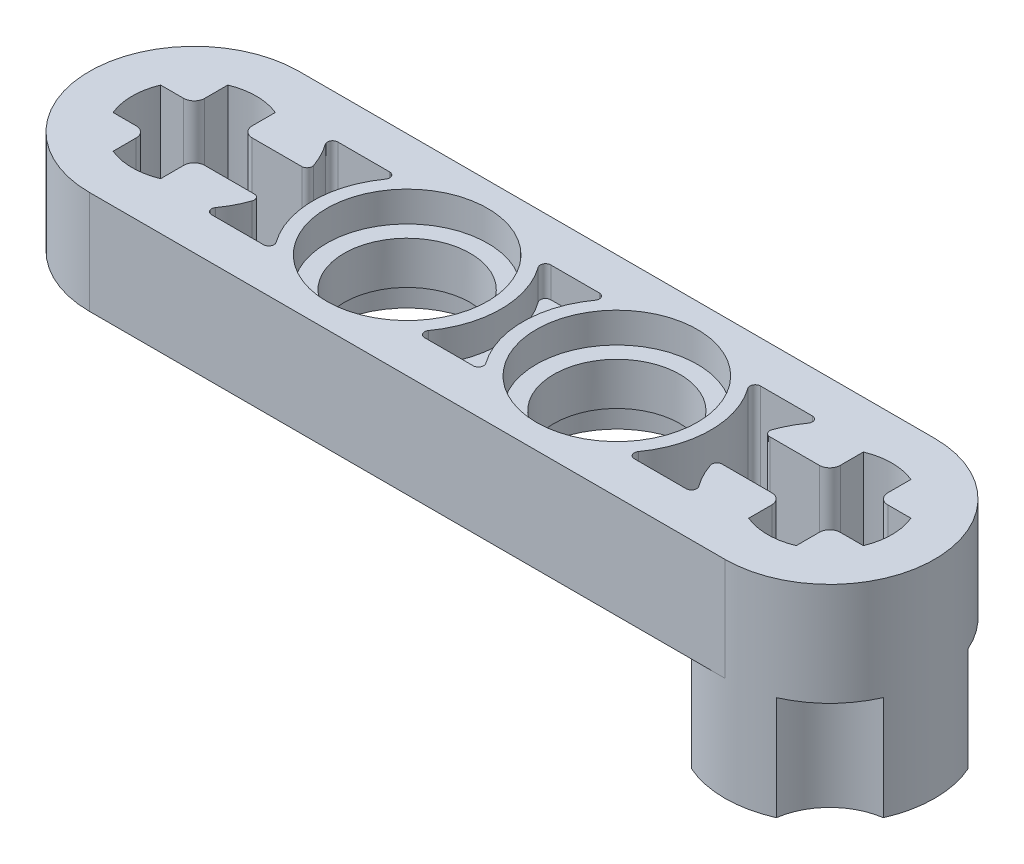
ISO-10303-21;
HEADER;
FILE_DESCRIPTION(('STEP AP214'),'2;1');
FILE_NAME('part.step','',(''),(''),'','','');
FILE_SCHEMA(('AUTOMOTIVE_DESIGN { 1 0 10303 214 1 1 1 1 }'));
ENDSEC;
DATA;
#1=APPLICATION_CONTEXT('core data for automotive mechanical design processes');
#2=APPLICATION_PROTOCOL_DEFINITION('international standard','automotive_design',2000,#1);
#3=PRODUCT_CONTEXT('',#1,'mechanical');
#4=PRODUCT('Part','Part','',(#3));
#5=PRODUCT_RELATED_PRODUCT_CATEGORY('part','',(#4));
#6=PRODUCT_DEFINITION_FORMATION('','',#4);
#7=PRODUCT_DEFINITION_CONTEXT('part definition',#1,'design');
#8=PRODUCT_DEFINITION('design','',#6,#7);
#9=PRODUCT_DEFINITION_SHAPE('','',#8);
#10=(LENGTH_UNIT() NAMED_UNIT(*) SI_UNIT(.MILLI.,.METRE.));
#11=(NAMED_UNIT(*) PLANE_ANGLE_UNIT() SI_UNIT($,.RADIAN.));
#12=(NAMED_UNIT(*) SI_UNIT($,.STERADIAN.) SOLID_ANGLE_UNIT());
#13=UNCERTAINTY_MEASURE_WITH_UNIT(LENGTH_MEASURE(1.E-05),#10,'distance_accuracy_value','');
#14=(GEOMETRIC_REPRESENTATION_CONTEXT(3) GLOBAL_UNCERTAINTY_ASSIGNED_CONTEXT((#13)) GLOBAL_UNIT_ASSIGNED_CONTEXT((#10,
#11,#12)) REPRESENTATION_CONTEXT('',''));
#15=CARTESIAN_POINT('',(0.,0.,0.));
#16=DIRECTION('',(0.,0.,1.));
#17=DIRECTION('',(1.,0.,0.));
#18=AXIS2_PLACEMENT_3D('',#15,#16,#17);
#19=CARTESIAN_POINT('',(12.03125,1.95,0.));
#20=DIRECTION('',(0.,-1.,0.));
#21=DIRECTION('',(0.,0.,-1.));
#22=AXIS2_PLACEMENT_3D('',#19,#20,#21);
#23=CYLINDRICAL_SURFACE('',#22,3.96875);
#24=DIRECTION('',(0.,-1.,0.));
#25=VECTOR('',#24,1.);
#26=CARTESIAN_POINT('',(10.425885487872,-3.9185,-3.629570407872));
#27=LINE('',#26,#25);
#28=CARTESIAN_POINT('',(10.425885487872,-1.95,-3.629570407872));
#29=VERTEX_POINT('',#28);
#30=CARTESIAN_POINT('',(10.425885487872,-5.887,-3.62957040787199));
#31=VERTEX_POINT('',#30);
#32=EDGE_CURVE('E51',#29,#31,#27,.T.);
#33=ORIENTED_EDGE('',*,*,#32,.F.);
#34=CARTESIAN_POINT('',(12.03125,-1.95,0.));
#35=DIRECTION('',(0.,-1.,0.));
#36=DIRECTION('',(0.,0.,-1.));
#37=AXIS2_PLACEMENT_3D('',#34,#35,#36);
#38=CIRCLE('',#37,3.96874999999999);
#39=CARTESIAN_POINT('',(12.03125,-1.95,-3.96875));
#40=VERTEX_POINT('',#39);
#41=EDGE_CURVE('E567',#29,#40,#38,.T.);
#42=ORIENTED_EDGE('',*,*,#41,.T.);
#43=DIRECTION('',(0.,-1.,0.));
#44=VECTOR('',#43,1.);
#45=CARTESIAN_POINT('',(12.03125,1.95,-3.96875));
#46=LINE('',#45,#44);
#47=CARTESIAN_POINT('',(12.03125,1.95,-3.96875));
#48=VERTEX_POINT('',#47);
#49=EDGE_CURVE('E885',#48,#40,#46,.T.);
#50=ORIENTED_EDGE('',*,*,#49,.F.);
#51=CARTESIAN_POINT('',(12.03125,1.95,0.));
#52=DIRECTION('',(0.,-1.,0.));
#53=DIRECTION('',(0.,0.,-1.));
#54=AXIS2_PLACEMENT_3D('',#51,#52,#53);
#55=CIRCLE('',#54,3.96875);
#56=CARTESIAN_POINT('',(12.03125,1.95,3.96875));
#57=VERTEX_POINT('',#56);
#58=EDGE_CURVE('E866',#48,#57,#55,.T.);
#59=ORIENTED_EDGE('',*,*,#58,.T.);
#60=DIRECTION('',(0.,-1.,0.));
#61=VECTOR('',#60,1.);
#62=CARTESIAN_POINT('',(12.03125,1.95,3.96875));
#63=LINE('',#62,#61);
#64=CARTESIAN_POINT('',(12.03125,-1.95,3.96875));
#65=VERTEX_POINT('',#64);
#66=EDGE_CURVE('E878',#57,#65,#63,.T.);
#67=ORIENTED_EDGE('',*,*,#66,.T.);
#68=CARTESIAN_POINT('',(10.425885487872,-1.95,3.62957040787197));
#69=VERTEX_POINT('',#68);
#70=EDGE_CURVE('E566',#65,#69,#38,.T.);
#71=ORIENTED_EDGE('',*,*,#70,.T.);
#72=DIRECTION('',(0.,-1.,0.));
#73=VECTOR('',#72,1.);
#74=CARTESIAN_POINT('',(10.425885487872,-3.9185,3.62957040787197));
#75=LINE('',#74,#73);
#76=CARTESIAN_POINT('',(10.425885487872,-5.887,3.62957040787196));
#77=VERTEX_POINT('',#76);
#78=EDGE_CURVE('E1287',#77,#69,#75,.F.);
#79=ORIENTED_EDGE('',*,*,#78,.F.);
#80=CARTESIAN_POINT('',(12.03125,-5.887,0.));
#81=DIRECTION('',(0.,-1.,0.));
#82=DIRECTION('',(0.,0.,-1.));
#83=AXIS2_PLACEMENT_3D('',#80,#81,#82);
#84=CIRCLE('',#83,3.96874999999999);
#85=CARTESIAN_POINT('',(13.636614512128,-5.887,3.62957040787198));
#86=VERTEX_POINT('',#85);
#87=EDGE_CURVE('E1306',#86,#77,#84,.T.);
#88=ORIENTED_EDGE('',*,*,#87,.F.);
#89=DIRECTION('',(0.,-1.,0.));
#90=VECTOR('',#89,1.);
#91=CARTESIAN_POINT('',(13.636614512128,-3.9185,3.62957040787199));
#92=LINE('',#91,#90);
#93=CARTESIAN_POINT('',(13.636614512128,-1.95,3.62957040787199));
#94=VERTEX_POINT('',#93);
#95=EDGE_CURVE('E1181',#94,#86,#92,.T.);
#96=ORIENTED_EDGE('',*,*,#95,.F.);
#97=CARTESIAN_POINT('',(12.03125,-1.95,0.));
#98=DIRECTION('',(0.,-1.,0.));
#99=DIRECTION('',(0.,0.,-1.));
#100=AXIS2_PLACEMENT_3D('',#97,#98,#99);
#101=CIRCLE('',#100,3.96875);
#102=CARTESIAN_POINT('',(15.660820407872,-1.95,1.60536451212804));
#103=VERTEX_POINT('',#102);
#104=EDGE_CURVE('E11',#94,#103,#101,.F.);
#105=ORIENTED_EDGE('',*,*,#104,.T.);
#106=DIRECTION('',(0.,-1.,0.));
#107=VECTOR('',#106,1.);
#108=CARTESIAN_POINT('',(15.660820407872,-3.9185,1.60536451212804));
#109=LINE('',#108,#107);
#110=CARTESIAN_POINT('',(15.660820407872,-5.887,1.60536451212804));
#111=VERTEX_POINT('',#110);
#112=EDGE_CURVE('E1295',#111,#103,#109,.F.);
#113=ORIENTED_EDGE('',*,*,#112,.F.);
#114=CARTESIAN_POINT('',(15.660820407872,-5.887,-1.60536451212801));
#115=VERTEX_POINT('',#114);
#116=EDGE_CURVE('E575',#115,#111,#84,.T.);
#117=ORIENTED_EDGE('',*,*,#116,.F.);
#118=DIRECTION('',(0.,-1.,0.));
#119=VECTOR('',#118,1.);
#120=CARTESIAN_POINT('',(15.660820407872,-3.9185,-1.60536451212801));
#121=LINE('',#120,#119);
#122=CARTESIAN_POINT('',(15.660820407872,-1.95,-1.60536451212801));
#123=VERTEX_POINT('',#122);
#124=EDGE_CURVE('E1168',#123,#115,#121,.T.);
#125=ORIENTED_EDGE('',*,*,#124,.F.);
#126=CARTESIAN_POINT('',(12.03125,-1.95,0.));
#127=DIRECTION('',(0.,-1.,0.));
#128=DIRECTION('',(0.,0.,-1.));
#129=AXIS2_PLACEMENT_3D('',#126,#127,#128);
#130=CIRCLE('',#129,3.96875);
#131=CARTESIAN_POINT('',(13.636614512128,-1.95,-3.62957040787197));
#132=VERTEX_POINT('',#131);
#133=EDGE_CURVE('E44',#123,#132,#130,.F.);
#134=ORIENTED_EDGE('',*,*,#133,.T.);
#135=DIRECTION('',(0.,-1.,0.));
#136=VECTOR('',#135,1.);
#137=CARTESIAN_POINT('',(13.636614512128,-3.9185,-3.62957040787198));
#138=LINE('',#137,#136);
#139=CARTESIAN_POINT('',(13.636614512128,-5.887,-3.62957040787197));
#140=VERTEX_POINT('',#139);
#141=EDGE_CURVE('E1166',#140,#132,#138,.F.);
#142=ORIENTED_EDGE('',*,*,#141,.F.);
#143=EDGE_CURVE('E570',#31,#140,#84,.T.);
#144=ORIENTED_EDGE('',*,*,#143,.F.);
#145=EDGE_LOOP('',(#33,#42,#50,#59,#67,#71,#79,#88,#96,#105,#113,#117,#125,#134,#142,#144));
#146=FACE_BOUND('',#145,.T.);
#147=ADVANCED_FACE('F36',(#146),#23,.T.);
#148=CARTESIAN_POINT('',(12.03125,-1.95,0.));
#149=DIRECTION('',(0.,-1.,0.));
#150=DIRECTION('',(0.,0.,-1.));
#151=AXIS2_PLACEMENT_3D('',#148,#149,#150);
#152=PLANE('',#151);
#153=DIRECTION('',(1.,0.,0.));
#154=VECTOR('',#153,1.);
#155=CARTESIAN_POINT('',(-12.03125,-1.95,-3.96875));
#156=LINE('',#155,#154);
#157=CARTESIAN_POINT('',(-12.03125,-1.95,-3.96875));
#158=VERTEX_POINT('',#157);
#159=EDGE_CURVE('E870',#158,#40,#156,.T.);
#160=ORIENTED_EDGE('',*,*,#159,.T.);
#161=ORIENTED_EDGE('',*,*,#41,.F.);
#162=CARTESIAN_POINT('',(8.06250000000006,-1.95,-3.96875000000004));
#163=DIRECTION('',(0.,-1.,0.));
#164=DIRECTION('',(0.,0.,-1.));
#165=AXIS2_PLACEMENT_3D('',#162,#163,#164);
#166=CIRCLE('',#165,2.3876);
#167=CARTESIAN_POINT('',(8.93315929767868,-1.95,-1.74555721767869));
#168=VERTEX_POINT('',#167);
#169=EDGE_CURVE('E563',#168,#29,#166,.F.);
#170=ORIENTED_EDGE('',*,*,#169,.F.);
#171=CARTESIAN_POINT('',(12.03125,-1.95,0.));
#172=DIRECTION('',(0.,-1.,0.));
#173=DIRECTION('',(0.,0.,1.));
#174=AXIS2_PLACEMENT_3D('',#171,#172,#173);
#175=CIRCLE('',#174,3.556);
#176=CARTESIAN_POINT('',(9.1423202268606,-1.95,-2.07345623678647));
#177=VERTEX_POINT('',#176);
#178=EDGE_CURVE('E641',#168,#177,#175,.T.);
#179=ORIENTED_EDGE('',*,*,#178,.T.);
#180=CARTESIAN_POINT('',(8.98110762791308,-1.95,-2.1891625));
#181=DIRECTION('',(0.,-1.,0.));
#182=DIRECTION('',(0.,0.,-1.));
#183=AXIS2_PLACEMENT_3D('',#180,#181,#182);
#184=CIRCLE('',#183,0.1984375);
#185=CARTESIAN_POINT('',(8.98110762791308,-1.95,-2.3876));
#186=VERTEX_POINT('',#185);
#187=EDGE_CURVE('E1088',#177,#186,#184,.F.);
#188=ORIENTED_EDGE('',*,*,#187,.T.);
#189=DIRECTION('',(-1.,0.,0.));
#190=VECTOR('',#189,1.);
#191=CARTESIAN_POINT('',(9.39600765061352,-1.95,-2.3876));
#192=LINE('',#191,#190);
#193=CARTESIAN_POINT('',(7.01889237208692,-1.95,-2.3876));
#194=VERTEX_POINT('',#193);
#195=EDGE_CURVE('E639',#186,#194,#192,.T.);
#196=ORIENTED_EDGE('',*,*,#195,.T.);
#197=CARTESIAN_POINT('',(7.01889237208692,-1.95,-2.1891625));
#198=DIRECTION('',(0.,-1.,0.));
#199=DIRECTION('',(0.,0.,-1.));
#200=AXIS2_PLACEMENT_3D('',#197,#198,#199);
#201=CIRCLE('',#200,0.1984375);
#202=CARTESIAN_POINT('',(6.85767977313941,-1.95,-2.07345623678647));
#203=VERTEX_POINT('',#202);
#204=EDGE_CURVE('E1084',#194,#203,#201,.F.);
#205=ORIENTED_EDGE('',*,*,#204,.T.);
#206=CARTESIAN_POINT('',(3.96875,-1.95,0.));
#207=DIRECTION('',(0.,-1.,0.));
#208=DIRECTION('',(0.,0.,1.));
#209=AXIS2_PLACEMENT_3D('',#206,#207,#208);
#210=CIRCLE('',#209,3.556);
#211=CARTESIAN_POINT('',(6.85767977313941,-1.95,2.07345623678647));
#212=VERTEX_POINT('',#211);
#213=EDGE_CURVE('E637',#203,#212,#210,.T.);
#214=ORIENTED_EDGE('',*,*,#213,.T.);
#215=CARTESIAN_POINT('',(7.01889237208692,-1.95,2.1891625));
#216=DIRECTION('',(0.,-1.,0.));
#217=DIRECTION('',(0.,0.,-1.));
#218=AXIS2_PLACEMENT_3D('',#215,#216,#217);
#219=CIRCLE('',#218,0.1984375);
#220=CARTESIAN_POINT('',(7.01889237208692,-1.95,2.3876));
#221=VERTEX_POINT('',#220);
#222=EDGE_CURVE('E1075',#212,#221,#219,.F.);
#223=ORIENTED_EDGE('',*,*,#222,.T.);
#224=DIRECTION('',(-1.,0.,0.));
#225=VECTOR('',#224,1.);
#226=CARTESIAN_POINT('',(9.39600765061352,-1.95,2.3876));
#227=LINE('',#226,#225);
#228=CARTESIAN_POINT('',(8.98110762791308,-1.95,2.3876));
#229=VERTEX_POINT('',#228);
#230=EDGE_CURVE('E634',#229,#221,#227,.T.);
#231=ORIENTED_EDGE('',*,*,#230,.F.);
#232=CARTESIAN_POINT('',(8.98110762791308,-1.95,2.1891625));
#233=DIRECTION('',(0.,-1.,0.));
#234=DIRECTION('',(0.,0.,-1.));
#235=AXIS2_PLACEMENT_3D('',#232,#233,#234);
#236=CIRCLE('',#235,0.1984375);
#237=CARTESIAN_POINT('',(9.1423202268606,-1.95,2.07345623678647));
#238=VERTEX_POINT('',#237);
#239=EDGE_CURVE('E1080',#229,#238,#236,.F.);
#240=ORIENTED_EDGE('',*,*,#239,.T.);
#241=CARTESIAN_POINT('',(12.03125,-1.95,0.));
#242=DIRECTION('',(0.,-1.,0.));
#243=DIRECTION('',(0.,0.,1.));
#244=AXIS2_PLACEMENT_3D('',#241,#242,#243);
#245=CIRCLE('',#244,3.556);
#246=CARTESIAN_POINT('',(8.93315929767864,-1.95,1.74555721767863));
#247=VERTEX_POINT('',#246);
#248=EDGE_CURVE('E632',#238,#247,#245,.T.);
#249=ORIENTED_EDGE('',*,*,#248,.T.);
#250=CARTESIAN_POINT('',(8.06249999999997,-1.95,3.96874999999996));
#251=DIRECTION('',(0.,-1.,0.));
#252=DIRECTION('',(0.,0.,-1.));
#253=AXIS2_PLACEMENT_3D('',#250,#251,#252);
#254=CIRCLE('',#253,2.3876);
#255=EDGE_CURVE('E1273',#69,#247,#254,.F.);
#256=ORIENTED_EDGE('',*,*,#255,.F.);
#257=ORIENTED_EDGE('',*,*,#70,.F.);
#258=DIRECTION('',(-1.,0.,0.));
#259=VECTOR('',#258,1.);
#260=CARTESIAN_POINT('',(12.03125,-1.95,3.96875));
#261=LINE('',#260,#259);
#262=CARTESIAN_POINT('',(-12.03125,-1.95,3.96875));
#263=VERTEX_POINT('',#262);
#264=EDGE_CURVE('E879',#65,#263,#261,.T.);
#265=ORIENTED_EDGE('',*,*,#264,.T.);
#266=CARTESIAN_POINT('',(-12.03125,-1.95,0.));
#267=DIRECTION('',(0.,1.,0.));
#268=DIRECTION('',(0.,0.,1.));
#269=AXIS2_PLACEMENT_3D('',#266,#267,#268);
#270=CIRCLE('',#269,3.96875);
#271=EDGE_CURVE('E881',#158,#263,#270,.T.);
#272=ORIENTED_EDGE('',*,*,#271,.F.);
#273=EDGE_LOOP('',(#160,#161,#170,#179,#188,#196,#205,#214,#223,#231,#240,#249,#256,#257,#265,#272));
#274=FACE_BOUND('',#273,.T.);
#275=CARTESIAN_POINT('',(-3.96875,-1.94999999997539,0.));
#276=DIRECTION('',(0.,1.,0.));
#277=DIRECTION('',(0.,0.,1.));
#278=AXIS2_PLACEMENT_3D('',#275,#276,#277);
#279=CIRCLE('',#278,3.556);
#280=CARTESIAN_POINT('',(-1.07982022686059,-1.94999999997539,2.07345623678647));
#281=VERTEX_POINT('',#280);
#282=CARTESIAN_POINT('',(-1.0798202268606,-1.94999999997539,-2.07345623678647));
#283=VERTEX_POINT('',#282);
#284=EDGE_CURVE('E583',#281,#283,#279,.T.);
#285=ORIENTED_EDGE('',*,*,#284,.F.);
#286=CARTESIAN_POINT('',(-0.918607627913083,-1.95,2.1891625));
#287=DIRECTION('',(0.,-1.,0.));
#288=DIRECTION('',(0.,0.,-1.));
#289=AXIS2_PLACEMENT_3D('',#286,#287,#288);
#290=CIRCLE('',#289,0.1984375);
#291=CARTESIAN_POINT('',(-0.918607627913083,-1.94999999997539,2.3876));
#292=VERTEX_POINT('',#291);
#293=EDGE_CURVE('E1158',#281,#292,#290,.F.);
#294=ORIENTED_EDGE('',*,*,#293,.T.);
#295=DIRECTION('',(1.,0.,0.));
#296=VECTOR('',#295,1.);
#297=CARTESIAN_POINT('',(-1.33350765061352,-1.94999999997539,2.3876));
#298=LINE('',#297,#296);
#299=CARTESIAN_POINT('',(0.918607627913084,-1.94999999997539,2.38759999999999));
#300=VERTEX_POINT('',#299);
#301=EDGE_CURVE('E600',#292,#300,#298,.T.);
#302=ORIENTED_EDGE('',*,*,#301,.T.);
#303=CARTESIAN_POINT('',(0.918607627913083,-1.95,2.18916249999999));
#304=DIRECTION('',(0.,-1.,0.));
#305=DIRECTION('',(0.,0.,-1.));
#306=AXIS2_PLACEMENT_3D('',#303,#304,#305);
#307=CIRCLE('',#306,0.1984375);
#308=CARTESIAN_POINT('',(1.07982022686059,-1.94999999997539,2.07345623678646));
#309=VERTEX_POINT('',#308);
#310=EDGE_CURVE('E1160',#300,#309,#307,.F.);
#311=ORIENTED_EDGE('',*,*,#310,.T.);
#312=CARTESIAN_POINT('',(3.96875,-1.94999999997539,0.));
#313=DIRECTION('',(0.,1.,0.));
#314=DIRECTION('',(0.,0.,1.));
#315=AXIS2_PLACEMENT_3D('',#312,#313,#314);
#316=CIRCLE('',#315,3.556);
#317=CARTESIAN_POINT('',(1.0798202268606,-1.94999999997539,-2.07345623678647));
#318=VERTEX_POINT('',#317);
#319=EDGE_CURVE('E603',#318,#309,#316,.T.);
#320=ORIENTED_EDGE('',*,*,#319,.F.);
#321=CARTESIAN_POINT('',(0.918607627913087,-1.95,-2.1891625));
#322=DIRECTION('',(0.,-1.,0.));
#323=DIRECTION('',(0.,0.,-1.));
#324=AXIS2_PLACEMENT_3D('',#321,#322,#323);
#325=CIRCLE('',#324,0.1984375);
#326=CARTESIAN_POINT('',(0.918607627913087,-1.94999999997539,-2.3876));
#327=VERTEX_POINT('',#326);
#328=EDGE_CURVE('E1156',#318,#327,#325,.F.);
#329=ORIENTED_EDGE('',*,*,#328,.T.);
#330=DIRECTION('',(1.,0.,0.));
#331=VECTOR('',#330,1.);
#332=CARTESIAN_POINT('',(-1.33350765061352,-1.94999999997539,-2.3876));
#333=LINE('',#332,#331);
#334=CARTESIAN_POINT('',(-0.918607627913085,-1.94999999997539,-2.3876));
#335=VERTEX_POINT('',#334);
#336=EDGE_CURVE('E588',#335,#327,#333,.T.);
#337=ORIENTED_EDGE('',*,*,#336,.F.);
#338=CARTESIAN_POINT('',(-0.918607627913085,-1.95,-2.1891625));
#339=DIRECTION('',(0.,-1.,0.));
#340=DIRECTION('',(0.,0.,-1.));
#341=AXIS2_PLACEMENT_3D('',#338,#339,#340);
#342=CIRCLE('',#341,0.1984375);
#343=EDGE_CURVE('E1154',#335,#283,#342,.F.);
#344=ORIENTED_EDGE('',*,*,#343,.T.);
#345=EDGE_LOOP('',(#285,#294,#302,#311,#320,#329,#337,#344));
#346=FACE_BOUND('',#345,.T.);
#347=CARTESIAN_POINT('',(-3.96875,-1.95,0.));
#348=DIRECTION('',(0.,-1.,0.));
#349=DIRECTION('',(0.,0.,-1.));
#350=AXIS2_PLACEMENT_3D('',#347,#348,#349);
#351=CIRCLE('',#350,3.048);
#352=CARTESIAN_POINT('',(-3.96875,-1.95,-3.048));
#353=VERTEX_POINT('',#352);
#354=EDGE_CURVE('E856',#353,#353,#351,.T.);
#355=ORIENTED_EDGE('',*,*,#354,.F.);
#356=EDGE_LOOP('',(#355));
#357=FACE_BOUND('',#356,.T.);
#358=CARTESIAN_POINT('',(3.96875,-1.95,0.));
#359=DIRECTION('',(0.,-1.,0.));
#360=DIRECTION('',(0.,0.,-1.));
#361=AXIS2_PLACEMENT_3D('',#358,#359,#360);
#362=CIRCLE('',#361,3.048);
#363=CARTESIAN_POINT('',(3.96875,-1.95,-3.048));
#364=VERTEX_POINT('',#363);
#365=EDGE_CURVE('E827',#364,#364,#362,.T.);
#366=ORIENTED_EDGE('',*,*,#365,.F.);
#367=EDGE_LOOP('',(#366));
#368=FACE_BOUND('',#367,.T.);
#369=CARTESIAN_POINT('',(-12.03125,-1.95,0.));
#370=DIRECTION('',(0.,1.,0.));
#371=DIRECTION('',(0.,0.,1.));
#372=AXIS2_PLACEMENT_3D('',#369,#370,#371);
#373=CIRCLE('',#372,3.556);
#374=CARTESIAN_POINT('',(-8.67093207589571,-1.95,-1.16335697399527));
#375=VERTEX_POINT('',#374);
#376=CARTESIAN_POINT('',(-9.1423202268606,-1.95,-2.07345623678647));
#377=VERTEX_POINT('',#376);
#378=EDGE_CURVE('E733',#375,#377,#373,.T.);
#379=ORIENTED_EDGE('',*,*,#378,.F.);
#380=CARTESIAN_POINT('',(-8.85844981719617,-1.95,-1.0984375));
#381=DIRECTION('',(0.,-1.,0.));
#382=DIRECTION('',(0.,0.,-1.));
#383=AXIS2_PLACEMENT_3D('',#380,#381,#382);
#384=CIRCLE('',#383,0.1984375);
#385=CARTESIAN_POINT('',(-8.85844981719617,-1.95,-0.9));
#386=VERTEX_POINT('',#385);
#387=EDGE_CURVE('E973',#375,#386,#384,.T.);
#388=ORIENTED_EDGE('',*,*,#387,.T.);
#389=DIRECTION('',(1.,0.,0.));
#390=VECTOR('',#389,1.);
#391=CARTESIAN_POINT('',(-11.13125,-1.95,-0.9));
#392=LINE('',#391,#390);
#393=CARTESIAN_POINT('',(-10.734375,-1.95,-0.9));
#394=VERTEX_POINT('',#393);
#395=EDGE_CURVE('E770',#394,#386,#392,.T.);
#396=ORIENTED_EDGE('',*,*,#395,.F.);
#397=CARTESIAN_POINT('',(-10.734375,-1.95,-1.296875));
#398=DIRECTION('',(0.,-1.,0.));
#399=DIRECTION('',(0.,0.,-1.));
#400=AXIS2_PLACEMENT_3D('',#397,#398,#399);
#401=CIRCLE('',#400,0.396875);
#402=CARTESIAN_POINT('',(-11.13125,-1.95,-1.296875));
#403=VERTEX_POINT('',#402);
#404=EDGE_CURVE('E920',#394,#403,#401,.T.);
#405=ORIENTED_EDGE('',*,*,#404,.T.);
#406=DIRECTION('',(0.,0.,1.));
#407=VECTOR('',#406,1.);
#408=CARTESIAN_POINT('',(-11.13125,-1.95,-2.17082933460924));
#409=LINE('',#408,#407);
#410=CARTESIAN_POINT('',(-11.13125,-1.95,-2.17082933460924));
#411=VERTEX_POINT('',#410);
#412=EDGE_CURVE('E773',#411,#403,#409,.T.);
#413=ORIENTED_EDGE('',*,*,#412,.F.);
#414=CARTESIAN_POINT('',(-12.03125,-1.95,0.));
#415=DIRECTION('',(0.,1.,0.));
#416=DIRECTION('',(0.,0.,1.));
#417=AXIS2_PLACEMENT_3D('',#414,#415,#416);
#418=CIRCLE('',#417,2.35);
#419=CARTESIAN_POINT('',(-12.93125,-1.95,-2.17082933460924));
#420=VERTEX_POINT('',#419);
#421=EDGE_CURVE('E776',#411,#420,#418,.T.);
#422=ORIENTED_EDGE('',*,*,#421,.T.);
#423=DIRECTION('',(0.,0.,1.));
#424=VECTOR('',#423,1.);
#425=CARTESIAN_POINT('',(-12.93125,-1.95,-2.17082933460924));
#426=LINE('',#425,#424);
#427=CARTESIAN_POINT('',(-12.93125,-1.95,-1.296875));
#428=VERTEX_POINT('',#427);
#429=EDGE_CURVE('E779',#420,#428,#426,.T.);
#430=ORIENTED_EDGE('',*,*,#429,.T.);
#431=CARTESIAN_POINT('',(-13.328125,-1.95,-1.296875));
#432=DIRECTION('',(0.,-1.,0.));
#433=DIRECTION('',(0.,0.,-1.));
#434=AXIS2_PLACEMENT_3D('',#431,#432,#433);
#435=CIRCLE('',#434,0.396875);
#436=CARTESIAN_POINT('',(-13.328125,-1.95,-0.9));
#437=VERTEX_POINT('',#436);
#438=EDGE_CURVE('E922',#428,#437,#435,.T.);
#439=ORIENTED_EDGE('',*,*,#438,.T.);
#440=DIRECTION('',(-1.,0.,0.));
#441=VECTOR('',#440,1.);
#442=CARTESIAN_POINT('',(-12.93125,-1.95,-0.9));
#443=LINE('',#442,#441);
#444=CARTESIAN_POINT('',(-14.2020793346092,-1.95,-0.9));
#445=VERTEX_POINT('',#444);
#446=EDGE_CURVE('E782',#437,#445,#443,.T.);
#447=ORIENTED_EDGE('',*,*,#446,.T.);
#448=CARTESIAN_POINT('',(-12.03125,-1.95,0.));
#449=DIRECTION('',(0.,1.,0.));
#450=DIRECTION('',(0.,0.,1.));
#451=AXIS2_PLACEMENT_3D('',#448,#449,#450);
#452=CIRCLE('',#451,2.35);
#453=CARTESIAN_POINT('',(-14.2020793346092,-1.95,0.9));
#454=VERTEX_POINT('',#453);
#455=EDGE_CURVE('E784',#445,#454,#452,.T.);
#456=ORIENTED_EDGE('',*,*,#455,.T.);
#457=DIRECTION('',(-1.,0.,0.));
#458=VECTOR('',#457,1.);
#459=CARTESIAN_POINT('',(-12.93125,-1.95,0.9));
#460=LINE('',#459,#458);
#461=CARTESIAN_POINT('',(-13.328125,-1.95,0.9));
#462=VERTEX_POINT('',#461);
#463=EDGE_CURVE('E787',#462,#454,#460,.T.);
#464=ORIENTED_EDGE('',*,*,#463,.F.);
#465=CARTESIAN_POINT('',(-13.328125,-1.95,1.296875));
#466=DIRECTION('',(0.,-1.,0.));
#467=DIRECTION('',(0.,0.,-1.));
#468=AXIS2_PLACEMENT_3D('',#465,#466,#467);
#469=CIRCLE('',#468,0.396875);
#470=CARTESIAN_POINT('',(-12.93125,-1.95,1.296875));
#471=VERTEX_POINT('',#470);
#472=EDGE_CURVE('E918',#462,#471,#469,.T.);
#473=ORIENTED_EDGE('',*,*,#472,.T.);
#474=DIRECTION('',(0.,0.,-1.));
#475=VECTOR('',#474,1.);
#476=CARTESIAN_POINT('',(-12.93125,-1.95,2.17082933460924));
#477=LINE('',#476,#475);
#478=CARTESIAN_POINT('',(-12.93125,-1.95,2.17082933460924));
#479=VERTEX_POINT('',#478);
#480=EDGE_CURVE('E789',#479,#471,#477,.T.);
#481=ORIENTED_EDGE('',*,*,#480,.F.);
#482=CARTESIAN_POINT('',(-12.03125,-1.95,0.));
#483=DIRECTION('',(0.,1.,0.));
#484=DIRECTION('',(0.,0.,1.));
#485=AXIS2_PLACEMENT_3D('',#482,#483,#484);
#486=CIRCLE('',#485,2.35);
#487=CARTESIAN_POINT('',(-11.13125,-1.95,2.17082933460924));
#488=VERTEX_POINT('',#487);
#489=EDGE_CURVE('E792',#479,#488,#486,.T.);
#490=ORIENTED_EDGE('',*,*,#489,.T.);
#491=DIRECTION('',(0.,0.,-1.));
#492=VECTOR('',#491,1.);
#493=CARTESIAN_POINT('',(-11.13125,-1.95,2.17082933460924));
#494=LINE('',#493,#492);
#495=CARTESIAN_POINT('',(-11.13125,-1.95,1.296875));
#496=VERTEX_POINT('',#495);
#497=EDGE_CURVE('E763',#488,#496,#494,.T.);
#498=ORIENTED_EDGE('',*,*,#497,.T.);
#499=CARTESIAN_POINT('',(-10.734375,-1.95,1.296875));
#500=DIRECTION('',(0.,-1.,0.));
#501=DIRECTION('',(0.,0.,-1.));
#502=AXIS2_PLACEMENT_3D('',#499,#500,#501);
#503=CIRCLE('',#502,0.396875);
#504=CARTESIAN_POINT('',(-10.734375,-1.95,0.9));
#505=VERTEX_POINT('',#504);
#506=EDGE_CURVE('E916',#496,#505,#503,.T.);
#507=ORIENTED_EDGE('',*,*,#506,.T.);
#508=DIRECTION('',(1.,0.,0.));
#509=VECTOR('',#508,1.);
#510=CARTESIAN_POINT('',(-11.13125,-1.95,0.9));
#511=LINE('',#510,#509);
#512=CARTESIAN_POINT('',(-8.85844981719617,-1.95,0.9));
#513=VERTEX_POINT('',#512);
#514=EDGE_CURVE('E766',#505,#513,#511,.T.);
#515=ORIENTED_EDGE('',*,*,#514,.T.);
#516=CARTESIAN_POINT('',(-8.85844981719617,-1.95,1.0984375));
#517=DIRECTION('',(0.,-1.,0.));
#518=DIRECTION('',(0.,0.,-1.));
#519=AXIS2_PLACEMENT_3D('',#516,#517,#518);
#520=CIRCLE('',#519,0.1984375);
#521=CARTESIAN_POINT('',(-8.67093207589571,-1.95,1.16335697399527));
#522=VERTEX_POINT('',#521);
#523=EDGE_CURVE('E971',#513,#522,#520,.T.);
#524=ORIENTED_EDGE('',*,*,#523,.T.);
#525=CARTESIAN_POINT('',(-12.03125,-1.95,0.));
#526=DIRECTION('',(0.,1.,0.));
#527=DIRECTION('',(0.,0.,1.));
#528=AXIS2_PLACEMENT_3D('',#525,#526,#527);
#529=CIRCLE('',#528,3.556);
#530=CARTESIAN_POINT('',(-9.1423202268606,-1.95,2.07345623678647));
#531=VERTEX_POINT('',#530);
#532=EDGE_CURVE('E746',#531,#522,#529,.T.);
#533=ORIENTED_EDGE('',*,*,#532,.F.);
#534=CARTESIAN_POINT('',(-8.98110762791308,-1.95,2.1891625));
#535=DIRECTION('',(0.,-1.,0.));
#536=DIRECTION('',(0.,0.,-1.));
#537=AXIS2_PLACEMENT_3D('',#534,#535,#536);
#538=CIRCLE('',#537,0.1984375);
#539=CARTESIAN_POINT('',(-8.98110762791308,-1.95,2.3876));
#540=VERTEX_POINT('',#539);
#541=EDGE_CURVE('E983',#531,#540,#538,.F.);
#542=ORIENTED_EDGE('',*,*,#541,.T.);
#543=DIRECTION('',(1.,0.,0.));
#544=VECTOR('',#543,1.);
#545=CARTESIAN_POINT('',(-9.39600765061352,-1.95,2.3876));
#546=LINE('',#545,#544);
#547=CARTESIAN_POINT('',(-7.01889237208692,-1.95,2.3876));
#548=VERTEX_POINT('',#547);
#549=EDGE_CURVE('E743',#540,#548,#546,.T.);
#550=ORIENTED_EDGE('',*,*,#549,.T.);
#551=CARTESIAN_POINT('',(-7.01889237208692,-1.95,2.1891625));
#552=DIRECTION('',(0.,-1.,0.));
#553=DIRECTION('',(0.,0.,-1.));
#554=AXIS2_PLACEMENT_3D('',#551,#552,#553);
#555=CIRCLE('',#554,0.1984375);
#556=CARTESIAN_POINT('',(-6.85767977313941,-1.95,2.07345623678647));
#557=VERTEX_POINT('',#556);
#558=EDGE_CURVE('E979',#548,#557,#555,.F.);
#559=ORIENTED_EDGE('',*,*,#558,.T.);
#560=CARTESIAN_POINT('',(-3.96875,-1.95,0.));
#561=DIRECTION('',(0.,1.,0.));
#562=DIRECTION('',(0.,0.,1.));
#563=AXIS2_PLACEMENT_3D('',#560,#561,#562);
#564=CIRCLE('',#563,3.556);
#565=CARTESIAN_POINT('',(-6.85767977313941,-1.95,-2.07345623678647));
#566=VERTEX_POINT('',#565);
#567=EDGE_CURVE('E740',#566,#557,#564,.T.);
#568=ORIENTED_EDGE('',*,*,#567,.F.);
#569=CARTESIAN_POINT('',(-7.01889237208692,-1.95,-2.1891625));
#570=DIRECTION('',(0.,-1.,0.));
#571=DIRECTION('',(0.,0.,-1.));
#572=AXIS2_PLACEMENT_3D('',#569,#570,#571);
#573=CIRCLE('',#572,0.1984375);
#574=CARTESIAN_POINT('',(-7.01889237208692,-1.95,-2.3876));
#575=VERTEX_POINT('',#574);
#576=EDGE_CURVE('E987',#566,#575,#573,.F.);
#577=ORIENTED_EDGE('',*,*,#576,.T.);
#578=DIRECTION('',(1.,0.,0.));
#579=VECTOR('',#578,1.);
#580=CARTESIAN_POINT('',(-9.39600765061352,-1.95,-2.3876));
#581=LINE('',#580,#579);
#582=CARTESIAN_POINT('',(-8.98110762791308,-1.95,-2.3876));
#583=VERTEX_POINT('',#582);
#584=EDGE_CURVE('E736',#583,#575,#581,.T.);
#585=ORIENTED_EDGE('',*,*,#584,.F.);
#586=CARTESIAN_POINT('',(-8.98110762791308,-1.95,-2.1891625));
#587=DIRECTION('',(0.,-1.,0.));
#588=DIRECTION('',(0.,0.,-1.));
#589=AXIS2_PLACEMENT_3D('',#586,#587,#588);
#590=CIRCLE('',#589,0.1984375);
#591=EDGE_CURVE('E991',#583,#377,#590,.F.);
#592=ORIENTED_EDGE('',*,*,#591,.T.);
#593=EDGE_LOOP('',(#379,#388,#396,#405,#413,#422,#430,#439,#447,#456,#464,#473,#481,#490,#498,
#507,#515,#524,#533,#542,#550,#559,#568,#577,#585,#592));
#594=FACE_BOUND('',#593,.T.);
#595=ADVANCED_FACE('F1217',(#274,#346,#357,#368,#594),#152,.T.);
#596=CARTESIAN_POINT('',(12.03125,1.95,0.));
#597=DIRECTION('',(0.,-1.,0.));
#598=DIRECTION('',(0.,0.,-1.));
#599=AXIS2_PLACEMENT_3D('',#596,#597,#598);
#600=PLANE('',#599);
#601=CARTESIAN_POINT('',(12.03125,1.95,0.));
#602=DIRECTION('',(0.,-1.,0.));
#603=DIRECTION('',(0.,0.,1.));
#604=AXIS2_PLACEMENT_3D('',#601,#602,#603);
#605=CIRCLE('',#604,3.556);
#606=CARTESIAN_POINT('',(8.67093207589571,1.95,-1.16335697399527));
#607=VERTEX_POINT('',#606);
#608=CARTESIAN_POINT('',(9.1423202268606,1.95,-2.07345623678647));
#609=VERTEX_POINT('',#608);
#610=EDGE_CURVE('E655',#607,#609,#605,.T.);
#611=ORIENTED_EDGE('',*,*,#610,.F.);
#612=CARTESIAN_POINT('',(8.85844981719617,1.95,-1.0984375));
#613=DIRECTION('',(0.,-1.,0.));
#614=DIRECTION('',(0.,0.,-1.));
#615=AXIS2_PLACEMENT_3D('',#612,#613,#614);
#616=CIRCLE('',#615,0.1984375);
#617=CARTESIAN_POINT('',(8.85844981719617,1.95,-0.9));
#618=VERTEX_POINT('',#617);
#619=EDGE_CURVE('E1061',#607,#618,#616,.F.);
#620=ORIENTED_EDGE('',*,*,#619,.T.);
#621=DIRECTION('',(-1.,0.,0.));
#622=VECTOR('',#621,1.);
#623=CARTESIAN_POINT('',(11.13125,1.95,-0.9));
#624=LINE('',#623,#622);
#625=CARTESIAN_POINT('',(10.734375,1.95,-0.9));
#626=VERTEX_POINT('',#625);
#627=EDGE_CURVE('E713',#626,#618,#624,.T.);
#628=ORIENTED_EDGE('',*,*,#627,.F.);
#629=CARTESIAN_POINT('',(10.734375,1.95,-1.296875));
#630=DIRECTION('',(0.,-1.,0.));
#631=DIRECTION('',(0.,0.,-1.));
#632=AXIS2_PLACEMENT_3D('',#629,#630,#631);
#633=CIRCLE('',#632,0.396875);
#634=CARTESIAN_POINT('',(11.13125,1.95,-1.296875));
#635=VERTEX_POINT('',#634);
#636=EDGE_CURVE('E1000',#626,#635,#633,.F.);
#637=ORIENTED_EDGE('',*,*,#636,.T.);
#638=DIRECTION('',(0.,0.,1.));
#639=VECTOR('',#638,1.);
#640=CARTESIAN_POINT('',(11.13125,1.95,-2.17082933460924));
#641=LINE('',#640,#639);
#642=CARTESIAN_POINT('',(11.13125,1.95,-2.17082933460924));
#643=VERTEX_POINT('',#642);
#644=EDGE_CURVE('E710',#643,#635,#641,.T.);
#645=ORIENTED_EDGE('',*,*,#644,.F.);
#646=CARTESIAN_POINT('',(12.03125,1.95,0.));
#647=DIRECTION('',(0.,-1.,0.));
#648=DIRECTION('',(0.,0.,1.));
#649=AXIS2_PLACEMENT_3D('',#646,#647,#648);
#650=CIRCLE('',#649,2.35);
#651=CARTESIAN_POINT('',(12.93125,1.95,-2.17082933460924));
#652=VERTEX_POINT('',#651);
#653=EDGE_CURVE('E707',#643,#652,#650,.T.);
#654=ORIENTED_EDGE('',*,*,#653,.T.);
#655=DIRECTION('',(0.,0.,1.));
#656=VECTOR('',#655,1.);
#657=CARTESIAN_POINT('',(12.93125,1.95,-2.17082933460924));
#658=LINE('',#657,#656);
#659=CARTESIAN_POINT('',(12.93125,1.95,-1.296875));
#660=VERTEX_POINT('',#659);
#661=EDGE_CURVE('E704',#652,#660,#658,.T.);
#662=ORIENTED_EDGE('',*,*,#661,.T.);
#663=CARTESIAN_POINT('',(13.328125,1.95,-1.296875));
#664=DIRECTION('',(0.,-1.,0.));
#665=DIRECTION('',(0.,0.,-1.));
#666=AXIS2_PLACEMENT_3D('',#663,#664,#665);
#667=CIRCLE('',#666,0.396875);
#668=CARTESIAN_POINT('',(13.328125,1.95,-0.9));
#669=VERTEX_POINT('',#668);
#670=EDGE_CURVE('E1002',#660,#669,#667,.F.);
#671=ORIENTED_EDGE('',*,*,#670,.T.);
#672=DIRECTION('',(1.,0.,0.));
#673=VECTOR('',#672,1.);
#674=CARTESIAN_POINT('',(12.93125,1.95,-0.9));
#675=LINE('',#674,#673);
#676=CARTESIAN_POINT('',(14.2020793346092,1.95,-0.9));
#677=VERTEX_POINT('',#676);
#678=EDGE_CURVE('E702',#669,#677,#675,.T.);
#679=ORIENTED_EDGE('',*,*,#678,.T.);
#680=CARTESIAN_POINT('',(12.03125,1.95,0.));
#681=DIRECTION('',(0.,-1.,0.));
#682=DIRECTION('',(0.,0.,1.));
#683=AXIS2_PLACEMENT_3D('',#680,#681,#682);
#684=CIRCLE('',#683,2.35);
#685=CARTESIAN_POINT('',(14.2020793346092,1.95,0.9));
#686=VERTEX_POINT('',#685);
#687=EDGE_CURVE('E699',#677,#686,#684,.T.);
#688=ORIENTED_EDGE('',*,*,#687,.T.);
#689=DIRECTION('',(1.,0.,0.));
#690=VECTOR('',#689,1.);
#691=CARTESIAN_POINT('',(12.93125,1.95,0.9));
#692=LINE('',#691,#690);
#693=CARTESIAN_POINT('',(13.328125,1.95,0.9));
#694=VERTEX_POINT('',#693);
#695=EDGE_CURVE('E697',#694,#686,#692,.T.);
#696=ORIENTED_EDGE('',*,*,#695,.F.);
#697=CARTESIAN_POINT('',(13.328125,1.95,1.296875));
#698=DIRECTION('',(0.,-1.,0.));
#699=DIRECTION('',(0.,0.,-1.));
#700=AXIS2_PLACEMENT_3D('',#697,#698,#699);
#701=CIRCLE('',#700,0.396875);
#702=CARTESIAN_POINT('',(12.93125,1.95,1.296875));
#703=VERTEX_POINT('',#702);
#704=EDGE_CURVE('E998',#694,#703,#701,.F.);
#705=ORIENTED_EDGE('',*,*,#704,.T.);
#706=DIRECTION('',(0.,0.,-1.));
#707=VECTOR('',#706,1.);
#708=CARTESIAN_POINT('',(12.93125,1.95,2.17082933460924));
#709=LINE('',#708,#707);
#710=CARTESIAN_POINT('',(12.93125,1.95,2.17082933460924));
#711=VERTEX_POINT('',#710);
#712=EDGE_CURVE('E694',#711,#703,#709,.T.);
#713=ORIENTED_EDGE('',*,*,#712,.F.);
#714=CARTESIAN_POINT('',(12.03125,1.95,0.));
#715=DIRECTION('',(0.,-1.,0.));
#716=DIRECTION('',(0.,0.,1.));
#717=AXIS2_PLACEMENT_3D('',#714,#715,#716);
#718=CIRCLE('',#717,2.35);
#719=CARTESIAN_POINT('',(11.13125,1.95,2.17082933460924));
#720=VERTEX_POINT('',#719);
#721=EDGE_CURVE('E691',#711,#720,#718,.T.);
#722=ORIENTED_EDGE('',*,*,#721,.T.);
#723=DIRECTION('',(0.,0.,-1.));
#724=VECTOR('',#723,1.);
#725=CARTESIAN_POINT('',(11.13125,1.95,2.17082933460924));
#726=LINE('',#725,#724);
#727=CARTESIAN_POINT('',(11.13125,1.95,1.296875));
#728=VERTEX_POINT('',#727);
#729=EDGE_CURVE('E643',#720,#728,#726,.T.);
#730=ORIENTED_EDGE('',*,*,#729,.T.);
#731=CARTESIAN_POINT('',(10.734375,1.95,1.296875));
#732=DIRECTION('',(0.,-1.,0.));
#733=DIRECTION('',(0.,0.,-1.));
#734=AXIS2_PLACEMENT_3D('',#731,#732,#733);
#735=CIRCLE('',#734,0.396875);
#736=CARTESIAN_POINT('',(10.734375,1.95,0.9));
#737=VERTEX_POINT('',#736);
#738=EDGE_CURVE('E996',#728,#737,#735,.F.);
#739=ORIENTED_EDGE('',*,*,#738,.T.);
#740=DIRECTION('',(-1.,0.,0.));
#741=VECTOR('',#740,1.);
#742=CARTESIAN_POINT('',(11.13125,1.95,0.9));
#743=LINE('',#742,#741);
#744=CARTESIAN_POINT('',(8.85844981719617,1.95,0.9));
#745=VERTEX_POINT('',#744);
#746=EDGE_CURVE('E662',#737,#745,#743,.T.);
#747=ORIENTED_EDGE('',*,*,#746,.T.);
#748=CARTESIAN_POINT('',(8.85844981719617,1.95,1.0984375));
#749=DIRECTION('',(0.,-1.,0.));
#750=DIRECTION('',(0.,0.,-1.));
#751=AXIS2_PLACEMENT_3D('',#748,#749,#750);
#752=CIRCLE('',#751,0.1984375);
#753=CARTESIAN_POINT('',(8.67093207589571,1.95,1.16335697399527));
#754=VERTEX_POINT('',#753);
#755=EDGE_CURVE('E1059',#745,#754,#752,.F.);
#756=ORIENTED_EDGE('',*,*,#755,.T.);
#757=CARTESIAN_POINT('',(12.03125,1.95,0.));
#758=DIRECTION('',(0.,-1.,0.));
#759=DIRECTION('',(0.,0.,1.));
#760=AXIS2_PLACEMENT_3D('',#757,#758,#759);
#761=CIRCLE('',#760,3.556);
#762=CARTESIAN_POINT('',(9.1423202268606,1.95,2.07345623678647));
#763=VERTEX_POINT('',#762);
#764=EDGE_CURVE('E621',#763,#754,#761,.T.);
#765=ORIENTED_EDGE('',*,*,#764,.F.);
#766=CARTESIAN_POINT('',(8.98110762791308,1.95,2.1891625));
#767=DIRECTION('',(0.,-1.,0.));
#768=DIRECTION('',(0.,0.,-1.));
#769=AXIS2_PLACEMENT_3D('',#766,#767,#768);
#770=CIRCLE('',#769,0.1984375);
#771=CARTESIAN_POINT('',(8.98110762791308,1.95,2.3876));
#772=VERTEX_POINT('',#771);
#773=EDGE_CURVE('E1078',#763,#772,#770,.T.);
#774=ORIENTED_EDGE('',*,*,#773,.T.);
#775=DIRECTION('',(-1.,0.,0.));
#776=VECTOR('',#775,1.);
#777=CARTESIAN_POINT('',(9.39600765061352,1.95,2.3876));
#778=LINE('',#777,#776);
#779=CARTESIAN_POINT('',(7.01889237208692,1.95,2.3876));
#780=VERTEX_POINT('',#779);
#781=EDGE_CURVE('E646',#772,#780,#778,.T.);
#782=ORIENTED_EDGE('',*,*,#781,.T.);
#783=CARTESIAN_POINT('',(7.01889237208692,1.95,2.1891625));
#784=DIRECTION('',(0.,-1.,0.));
#785=DIRECTION('',(0.,0.,-1.));
#786=AXIS2_PLACEMENT_3D('',#783,#784,#785);
#787=CIRCLE('',#786,0.1984375);
#788=CARTESIAN_POINT('',(6.85767977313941,1.95,2.07345623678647));
#789=VERTEX_POINT('',#788);
#790=EDGE_CURVE('E1073',#780,#789,#787,.T.);
#791=ORIENTED_EDGE('',*,*,#790,.T.);
#792=CARTESIAN_POINT('',(3.96875,1.95,0.));
#793=DIRECTION('',(0.,-1.,0.));
#794=DIRECTION('',(0.,0.,1.));
#795=AXIS2_PLACEMENT_3D('',#792,#793,#794);
#796=CIRCLE('',#795,3.556);
#797=CARTESIAN_POINT('',(6.85767977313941,1.95,-2.07345623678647));
#798=VERTEX_POINT('',#797);
#799=EDGE_CURVE('E649',#798,#789,#796,.T.);
#800=ORIENTED_EDGE('',*,*,#799,.F.);
#801=CARTESIAN_POINT('',(7.01889237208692,1.95,-2.1891625));
#802=DIRECTION('',(0.,-1.,0.));
#803=DIRECTION('',(0.,0.,-1.));
#804=AXIS2_PLACEMENT_3D('',#801,#802,#803);
#805=CIRCLE('',#804,0.1984375);
#806=CARTESIAN_POINT('',(7.01889237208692,1.95,-2.3876));
#807=VERTEX_POINT('',#806);
#808=EDGE_CURVE('E1082',#798,#807,#805,.T.);
#809=ORIENTED_EDGE('',*,*,#808,.T.);
#810=DIRECTION('',(-1.,0.,0.));
#811=VECTOR('',#810,1.);
#812=CARTESIAN_POINT('',(9.39600765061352,1.95,-2.3876));
#813=LINE('',#812,#811);
#814=CARTESIAN_POINT('',(8.98110762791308,1.95,-2.3876));
#815=VERTEX_POINT('',#814);
#816=EDGE_CURVE('E652',#815,#807,#813,.T.);
#817=ORIENTED_EDGE('',*,*,#816,.F.);
#818=CARTESIAN_POINT('',(8.98110762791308,1.95,-2.1891625));
#819=DIRECTION('',(0.,-1.,0.));
#820=DIRECTION('',(0.,0.,-1.));
#821=AXIS2_PLACEMENT_3D('',#818,#819,#820);
#822=CIRCLE('',#821,0.1984375);
#823=EDGE_CURVE('E1086',#815,#609,#822,.T.);
#824=ORIENTED_EDGE('',*,*,#823,.T.);
#825=EDGE_LOOP('',(#611,#620,#628,#637,#645,#654,#662,#671,#679,#688,#696,#705,#713,#722,#730,
#739,#747,#756,#765,#774,#782,#791,#800,#809,#817,#824));
#826=FACE_BOUND('',#825,.T.);
#827=DIRECTION('',(1.,0.,0.));
#828=VECTOR('',#827,1.);
#829=CARTESIAN_POINT('',(-11.13125,1.95,-0.9));
#830=LINE('',#829,#828);
#831=CARTESIAN_POINT('',(-10.734375,1.95,-0.9));
#832=VERTEX_POINT('',#831);
#833=CARTESIAN_POINT('',(-8.85844981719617,1.95,-0.9));
#834=VERTEX_POINT('',#833);
#835=EDGE_CURVE('E801',#832,#834,#830,.T.);
#836=ORIENTED_EDGE('',*,*,#835,.T.);
#837=CARTESIAN_POINT('',(-8.85844981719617,1.95,-1.0984375));
#838=DIRECTION('',(0.,-1.,0.));
#839=DIRECTION('',(0.,0.,-1.));
#840=AXIS2_PLACEMENT_3D('',#837,#838,#839);
#841=CIRCLE('',#840,0.1984375);
#842=CARTESIAN_POINT('',(-8.67093207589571,1.95,-1.16335697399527));
#843=VERTEX_POINT('',#842);
#844=EDGE_CURVE('E969',#834,#843,#841,.F.);
#845=ORIENTED_EDGE('',*,*,#844,.T.);
#846=CARTESIAN_POINT('',(-12.03125,1.95,0.));
#847=DIRECTION('',(0.,1.,0.));
#848=DIRECTION('',(0.,0.,1.));
#849=AXIS2_PLACEMENT_3D('',#846,#847,#848);
#850=CIRCLE('',#849,3.556);
#851=CARTESIAN_POINT('',(-9.1423202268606,1.95,-2.07345623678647));
#852=VERTEX_POINT('',#851);
#853=EDGE_CURVE('E720',#843,#852,#850,.T.);
#854=ORIENTED_EDGE('',*,*,#853,.T.);
#855=CARTESIAN_POINT('',(-8.98110762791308,1.95,-2.1891625));
#856=DIRECTION('',(0.,-1.,0.));
#857=DIRECTION('',(0.,0.,-1.));
#858=AXIS2_PLACEMENT_3D('',#855,#856,#857);
#859=CIRCLE('',#858,0.1984375);
#860=CARTESIAN_POINT('',(-8.98110762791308,1.95,-2.3876));
#861=VERTEX_POINT('',#860);
#862=EDGE_CURVE('E989',#852,#861,#859,.T.);
#863=ORIENTED_EDGE('',*,*,#862,.T.);
#864=DIRECTION('',(1.,0.,0.));
#865=VECTOR('',#864,1.);
#866=CARTESIAN_POINT('',(-9.39600765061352,1.95,-2.3876));
#867=LINE('',#866,#865);
#868=CARTESIAN_POINT('',(-7.01889237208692,1.95,-2.3876));
#869=VERTEX_POINT('',#868);
#870=EDGE_CURVE('E752',#861,#869,#867,.T.);
#871=ORIENTED_EDGE('',*,*,#870,.T.);
#872=CARTESIAN_POINT('',(-7.01889237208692,1.95,-2.1891625));
#873=DIRECTION('',(0.,-1.,0.));
#874=DIRECTION('',(0.,0.,-1.));
#875=AXIS2_PLACEMENT_3D('',#872,#873,#874);
#876=CIRCLE('',#875,0.1984375);
#877=CARTESIAN_POINT('',(-6.85767977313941,1.95,-2.07345623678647));
#878=VERTEX_POINT('',#877);
#879=EDGE_CURVE('E985',#869,#878,#876,.T.);
#880=ORIENTED_EDGE('',*,*,#879,.T.);
#881=CARTESIAN_POINT('',(-3.96875,1.95,0.));
#882=DIRECTION('',(0.,1.,0.));
#883=DIRECTION('',(0.,0.,1.));
#884=AXIS2_PLACEMENT_3D('',#881,#882,#883);
#885=CIRCLE('',#884,3.556);
#886=CARTESIAN_POINT('',(-6.85767977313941,1.95,2.07345623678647));
#887=VERTEX_POINT('',#886);
#888=EDGE_CURVE('E755',#878,#887,#885,.T.);
#889=ORIENTED_EDGE('',*,*,#888,.T.);
#890=CARTESIAN_POINT('',(-7.01889237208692,1.95,2.1891625));
#891=DIRECTION('',(0.,-1.,0.));
#892=DIRECTION('',(0.,0.,-1.));
#893=AXIS2_PLACEMENT_3D('',#890,#891,#892);
#894=CIRCLE('',#893,0.1984375);
#895=CARTESIAN_POINT('',(-7.01889237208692,1.95,2.3876));
#896=VERTEX_POINT('',#895);
#897=EDGE_CURVE('E977',#887,#896,#894,.T.);
#898=ORIENTED_EDGE('',*,*,#897,.T.);
#899=DIRECTION('',(1.,0.,0.));
#900=VECTOR('',#899,1.);
#901=CARTESIAN_POINT('',(-9.39600765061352,1.95,2.3876));
#902=LINE('',#901,#900);
#903=CARTESIAN_POINT('',(-8.98110762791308,1.95,2.3876));
#904=VERTEX_POINT('',#903);
#905=EDGE_CURVE('E758',#904,#896,#902,.T.);
#906=ORIENTED_EDGE('',*,*,#905,.F.);
#907=CARTESIAN_POINT('',(-8.98110762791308,1.95,2.1891625));
#908=DIRECTION('',(0.,-1.,0.));
#909=DIRECTION('',(0.,0.,-1.));
#910=AXIS2_PLACEMENT_3D('',#907,#908,#909);
#911=CIRCLE('',#910,0.1984375);
#912=CARTESIAN_POINT('',(-9.1423202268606,1.95,2.07345623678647));
#913=VERTEX_POINT('',#912);
#914=EDGE_CURVE('E981',#904,#913,#911,.T.);
#915=ORIENTED_EDGE('',*,*,#914,.T.);
#916=CARTESIAN_POINT('',(-12.03125,1.95,0.));
#917=DIRECTION('',(0.,1.,0.));
#918=DIRECTION('',(0.,0.,1.));
#919=AXIS2_PLACEMENT_3D('',#916,#917,#918);
#920=CIRCLE('',#919,3.556);
#921=CARTESIAN_POINT('',(-8.67093207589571,1.95,1.16335697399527));
#922=VERTEX_POINT('',#921);
#923=EDGE_CURVE('E737',#913,#922,#920,.T.);
#924=ORIENTED_EDGE('',*,*,#923,.T.);
#925=CARTESIAN_POINT('',(-8.85844981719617,1.95,1.0984375));
#926=DIRECTION('',(0.,-1.,0.));
#927=DIRECTION('',(0.,0.,-1.));
#928=AXIS2_PLACEMENT_3D('',#925,#926,#927);
#929=CIRCLE('',#928,0.1984375);
#930=CARTESIAN_POINT('',(-8.85844981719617,1.95,0.9));
#931=VERTEX_POINT('',#930);
#932=EDGE_CURVE('E967',#922,#931,#929,.F.);
#933=ORIENTED_EDGE('',*,*,#932,.T.);
#934=DIRECTION('',(1.,0.,0.));
#935=VECTOR('',#934,1.);
#936=CARTESIAN_POINT('',(-11.13125,1.95,0.9));
#937=LINE('',#936,#935);
#938=CARTESIAN_POINT('',(-10.734375,1.95,0.9));
#939=VERTEX_POINT('',#938);
#940=EDGE_CURVE('E798',#939,#931,#937,.T.);
#941=ORIENTED_EDGE('',*,*,#940,.F.);
#942=CARTESIAN_POINT('',(-10.734375,1.95,1.296875));
#943=DIRECTION('',(0.,-1.,0.));
#944=DIRECTION('',(0.,0.,-1.));
#945=AXIS2_PLACEMENT_3D('',#942,#943,#944);
#946=CIRCLE('',#945,0.396875);
#947=CARTESIAN_POINT('',(-11.13125,1.95,1.296875));
#948=VERTEX_POINT('',#947);
#949=EDGE_CURVE('E906',#939,#948,#946,.F.);
#950=ORIENTED_EDGE('',*,*,#949,.T.);
#951=DIRECTION('',(0.,0.,-1.));
#952=VECTOR('',#951,1.);
#953=CARTESIAN_POINT('',(-11.13125,1.95,2.17082933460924));
#954=LINE('',#953,#952);
#955=CARTESIAN_POINT('',(-11.13125,1.95,2.17082933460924));
#956=VERTEX_POINT('',#955);
#957=EDGE_CURVE('E749',#956,#948,#954,.T.);
#958=ORIENTED_EDGE('',*,*,#957,.F.);
#959=CARTESIAN_POINT('',(-12.03125,1.95,0.));
#960=DIRECTION('',(0.,1.,0.));
#961=DIRECTION('',(0.,0.,1.));
#962=AXIS2_PLACEMENT_3D('',#959,#960,#961);
#963=CIRCLE('',#962,2.35);
#964=CARTESIAN_POINT('',(-12.93125,1.95,2.17082933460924));
#965=VERTEX_POINT('',#964);
#966=EDGE_CURVE('E767',#965,#956,#963,.T.);
#967=ORIENTED_EDGE('',*,*,#966,.F.);
#968=DIRECTION('',(0.,0.,-1.));
#969=VECTOR('',#968,1.);
#970=CARTESIAN_POINT('',(-12.93125,1.95,2.17082933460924));
#971=LINE('',#970,#969);
#972=CARTESIAN_POINT('',(-12.93125,1.95,1.296875));
#973=VERTEX_POINT('',#972);
#974=EDGE_CURVE('E820',#965,#973,#971,.T.);
#975=ORIENTED_EDGE('',*,*,#974,.T.);
#976=CARTESIAN_POINT('',(-13.328125,1.95,1.296875));
#977=DIRECTION('',(0.,-1.,0.));
#978=DIRECTION('',(0.,0.,-1.));
#979=AXIS2_PLACEMENT_3D('',#976,#977,#978);
#980=CIRCLE('',#979,0.396875);
#981=CARTESIAN_POINT('',(-13.328125,1.95,0.9));
#982=VERTEX_POINT('',#981);
#983=EDGE_CURVE('E908',#973,#982,#980,.F.);
#984=ORIENTED_EDGE('',*,*,#983,.T.);
#985=DIRECTION('',(-1.,0.,0.));
#986=VECTOR('',#985,1.);
#987=CARTESIAN_POINT('',(-12.93125,1.95,0.9));
#988=LINE('',#987,#986);
#989=CARTESIAN_POINT('',(-14.2020793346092,1.95,0.9));
#990=VERTEX_POINT('',#989);
#991=EDGE_CURVE('E818',#982,#990,#988,.T.);
#992=ORIENTED_EDGE('',*,*,#991,.T.);
#993=CARTESIAN_POINT('',(-12.03125,1.95,0.));
#994=DIRECTION('',(0.,1.,0.));
#995=DIRECTION('',(0.,0.,1.));
#996=AXIS2_PLACEMENT_3D('',#993,#994,#995);
#997=CIRCLE('',#996,2.35);
#998=CARTESIAN_POINT('',(-14.2020793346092,1.95,-0.9));
#999=VERTEX_POINT('',#998);
#1000=EDGE_CURVE('E815',#999,#990,#997,.T.);
#1001=ORIENTED_EDGE('',*,*,#1000,.F.);
#1002=DIRECTION('',(-1.,0.,0.));
#1003=VECTOR('',#1002,1.);
#1004=CARTESIAN_POINT('',(-12.93125,1.95,-0.9));
#1005=LINE('',#1004,#1003);
#1006=CARTESIAN_POINT('',(-13.328125,1.95,-0.9));
#1007=VERTEX_POINT('',#1006);
#1008=EDGE_CURVE('E813',#1007,#999,#1005,.T.);
#1009=ORIENTED_EDGE('',*,*,#1008,.F.);
#1010=CARTESIAN_POINT('',(-13.328125,1.95,-1.296875));
#1011=DIRECTION('',(0.,-1.,0.));
#1012=DIRECTION('',(0.,0.,-1.));
#1013=AXIS2_PLACEMENT_3D('',#1010,#1011,#1012);
#1014=CIRCLE('',#1013,0.396875);
#1015=CARTESIAN_POINT('',(-12.93125,1.95,-1.296875));
#1016=VERTEX_POINT('',#1015);
#1017=EDGE_CURVE('E912',#1007,#1016,#1014,.F.);
#1018=ORIENTED_EDGE('',*,*,#1017,.T.);
#1019=DIRECTION('',(0.,0.,1.));
#1020=VECTOR('',#1019,1.);
#1021=CARTESIAN_POINT('',(-12.93125,1.95,-2.17082933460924));
#1022=LINE('',#1021,#1020);
#1023=CARTESIAN_POINT('',(-12.93125,1.95,-2.17082933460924));
#1024=VERTEX_POINT('',#1023);
#1025=EDGE_CURVE('E810',#1024,#1016,#1022,.T.);
#1026=ORIENTED_EDGE('',*,*,#1025,.F.);
#1027=CARTESIAN_POINT('',(-12.03125,1.95,0.));
#1028=DIRECTION('',(0.,1.,0.));
#1029=DIRECTION('',(0.,0.,1.));
#1030=AXIS2_PLACEMENT_3D('',#1027,#1028,#1029);
#1031=CIRCLE('',#1030,2.35);
#1032=CARTESIAN_POINT('',(-11.13125,1.95,-2.17082933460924));
#1033=VERTEX_POINT('',#1032);
#1034=EDGE_CURVE('E807',#1033,#1024,#1031,.T.);
#1035=ORIENTED_EDGE('',*,*,#1034,.F.);
#1036=DIRECTION('',(0.,0.,1.));
#1037=VECTOR('',#1036,1.);
#1038=CARTESIAN_POINT('',(-11.13125,1.95,-2.17082933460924));
#1039=LINE('',#1038,#1037);
#1040=CARTESIAN_POINT('',(-11.13125,1.95,-1.296875));
#1041=VERTEX_POINT('',#1040);
#1042=EDGE_CURVE('E804',#1033,#1041,#1039,.T.);
#1043=ORIENTED_EDGE('',*,*,#1042,.T.);
#1044=CARTESIAN_POINT('',(-10.734375,1.95,-1.296875));
#1045=DIRECTION('',(0.,-1.,0.));
#1046=DIRECTION('',(0.,0.,-1.));
#1047=AXIS2_PLACEMENT_3D('',#1044,#1045,#1046);
#1048=CIRCLE('',#1047,0.396875);
#1049=EDGE_CURVE('E910',#1041,#832,#1048,.F.);
#1050=ORIENTED_EDGE('',*,*,#1049,.T.);
#1051=EDGE_LOOP('',(#836,#845,#854,#863,#871,#880,#889,#898,#906,#915,#924,#933,#941,#950,#958,
#967,#975,#984,#992,#1001,#1009,#1018,#1026,#1035,#1043,#1050));
#1052=FACE_BOUND('',#1051,.T.);
#1053=CARTESIAN_POINT('',(3.96875,1.95,0.));
#1054=DIRECTION('',(0.,1.,0.));
#1055=DIRECTION('',(0.,0.,1.));
#1056=AXIS2_PLACEMENT_3D('',#1053,#1054,#1055);
#1057=CIRCLE('',#1056,3.048);
#1058=CARTESIAN_POINT('',(3.96875,1.95,3.048));
#1059=VERTEX_POINT('',#1058);
#1060=EDGE_CURVE('E849',#1059,#1059,#1057,.T.);
#1061=ORIENTED_EDGE('',*,*,#1060,.F.);
#1062=EDGE_LOOP('',(#1061));
#1063=FACE_BOUND('',#1062,.T.);
#1064=CARTESIAN_POINT('',(-3.96875,1.95,0.));
#1065=DIRECTION('',(0.,1.,0.));
#1066=DIRECTION('',(0.,0.,1.));
#1067=AXIS2_PLACEMENT_3D('',#1064,#1065,#1066);
#1068=CIRCLE('',#1067,3.048);
#1069=CARTESIAN_POINT('',(-3.96875,1.95,3.048));
#1070=VERTEX_POINT('',#1069);
#1071=EDGE_CURVE('E863',#1070,#1070,#1068,.T.);
#1072=ORIENTED_EDGE('',*,*,#1071,.F.);
#1073=EDGE_LOOP('',(#1072));
#1074=FACE_BOUND('',#1073,.T.);
#1075=ORIENTED_EDGE('',*,*,#58,.F.);
#1076=DIRECTION('',(1.,0.,0.));
#1077=VECTOR('',#1076,1.);
#1078=CARTESIAN_POINT('',(-12.03125,1.95,-3.96875));
#1079=LINE('',#1078,#1077);
#1080=CARTESIAN_POINT('',(-12.03125,1.95,-3.96875));
#1081=VERTEX_POINT('',#1080);
#1082=EDGE_CURVE('E875',#1081,#48,#1079,.T.);
#1083=ORIENTED_EDGE('',*,*,#1082,.F.);
#1084=CARTESIAN_POINT('',(-12.03125,1.95,0.));
#1085=DIRECTION('',(0.,1.,0.));
#1086=DIRECTION('',(0.,0.,1.));
#1087=AXIS2_PLACEMENT_3D('',#1084,#1085,#1086);
#1088=CIRCLE('',#1087,3.96875);
#1089=CARTESIAN_POINT('',(-12.03125,1.95,3.96875));
#1090=VERTEX_POINT('',#1089);
#1091=EDGE_CURVE('E873',#1081,#1090,#1088,.T.);
#1092=ORIENTED_EDGE('',*,*,#1091,.T.);
#1093=DIRECTION('',(-1.,0.,0.));
#1094=VECTOR('',#1093,1.);
#1095=CARTESIAN_POINT('',(12.03125,1.95,3.96875));
#1096=LINE('',#1095,#1094);
#1097=EDGE_CURVE('E869',#57,#1090,#1096,.T.);
#1098=ORIENTED_EDGE('',*,*,#1097,.F.);
#1099=EDGE_LOOP('',(#1075,#1083,#1092,#1098));
#1100=FACE_BOUND('',#1099,.T.);
#1101=CARTESIAN_POINT('',(-3.96875,1.94999999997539,0.));
#1102=DIRECTION('',(0.,1.,0.));
#1103=DIRECTION('',(0.,0.,1.));
#1104=AXIS2_PLACEMENT_3D('',#1101,#1102,#1103);
#1105=CIRCLE('',#1104,3.556);
#1106=CARTESIAN_POINT('',(-1.07982022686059,1.94999999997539,2.07345623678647));
#1107=VERTEX_POINT('',#1106);
#1108=CARTESIAN_POINT('',(-1.0798202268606,1.94999999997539,-2.07345623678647));
#1109=VERTEX_POINT('',#1108);
#1110=EDGE_CURVE('E612',#1107,#1109,#1105,.T.);
#1111=ORIENTED_EDGE('',*,*,#1110,.T.);
#1112=CARTESIAN_POINT('',(-0.918607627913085,1.95,-2.1891625));
#1113=DIRECTION('',(0.,-1.,0.));
#1114=DIRECTION('',(0.,0.,-1.));
#1115=AXIS2_PLACEMENT_3D('',#1112,#1113,#1114);
#1116=CIRCLE('',#1115,0.1984375);
#1117=CARTESIAN_POINT('',(-0.918607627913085,1.94999999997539,-2.3876));
#1118=VERTEX_POINT('',#1117);
#1119=EDGE_CURVE('E1118',#1109,#1118,#1116,.T.);
#1120=ORIENTED_EDGE('',*,*,#1119,.T.);
#1121=DIRECTION('',(1.,0.,0.));
#1122=VECTOR('',#1121,1.);
#1123=CARTESIAN_POINT('',(-1.33350765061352,1.94999999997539,-2.3876));
#1124=LINE('',#1123,#1122);
#1125=CARTESIAN_POINT('',(0.918607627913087,1.94999999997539,-2.3876));
#1126=VERTEX_POINT('',#1125);
#1127=EDGE_CURVE('E597',#1118,#1126,#1124,.T.);
#1128=ORIENTED_EDGE('',*,*,#1127,.T.);
#1129=CARTESIAN_POINT('',(0.918607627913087,1.95,-2.1891625));
#1130=DIRECTION('',(0.,-1.,0.));
#1131=DIRECTION('',(0.,0.,-1.));
#1132=AXIS2_PLACEMENT_3D('',#1129,#1130,#1131);
#1133=CIRCLE('',#1132,0.1984375);
#1134=CARTESIAN_POINT('',(1.0798202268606,1.94999999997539,-2.07345623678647));
#1135=VERTEX_POINT('',#1134);
#1136=EDGE_CURVE('E1120',#1126,#1135,#1133,.T.);
#1137=ORIENTED_EDGE('',*,*,#1136,.T.);
#1138=CARTESIAN_POINT('',(3.96875,1.94999999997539,0.));
#1139=DIRECTION('',(0.,1.,0.));
#1140=DIRECTION('',(0.,0.,1.));
#1141=AXIS2_PLACEMENT_3D('',#1138,#1139,#1140);
#1142=CIRCLE('',#1141,3.556);
#1143=CARTESIAN_POINT('',(1.07982022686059,1.94999999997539,2.07345623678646));
#1144=VERTEX_POINT('',#1143);
#1145=EDGE_CURVE('E624',#1135,#1144,#1142,.T.);
#1146=ORIENTED_EDGE('',*,*,#1145,.T.);
#1147=CARTESIAN_POINT('',(0.918607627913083,1.95,2.18916249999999));
#1148=DIRECTION('',(0.,-1.,0.));
#1149=DIRECTION('',(0.,0.,-1.));
#1150=AXIS2_PLACEMENT_3D('',#1147,#1148,#1149);
#1151=CIRCLE('',#1150,0.1984375);
#1152=CARTESIAN_POINT('',(0.918607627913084,1.94999999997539,2.38759999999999));
#1153=VERTEX_POINT('',#1152);
#1154=EDGE_CURVE('E1124',#1144,#1153,#1151,.T.);
#1155=ORIENTED_EDGE('',*,*,#1154,.T.);
#1156=DIRECTION('',(1.,0.,0.));
#1157=VECTOR('',#1156,1.);
#1158=CARTESIAN_POINT('',(-1.33350765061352,1.94999999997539,2.3876));
#1159=LINE('',#1158,#1157);
#1160=CARTESIAN_POINT('',(-0.918607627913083,1.94999999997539,2.3876));
#1161=VERTEX_POINT('',#1160);
#1162=EDGE_CURVE('E627',#1161,#1153,#1159,.T.);
#1163=ORIENTED_EDGE('',*,*,#1162,.F.);
#1164=CARTESIAN_POINT('',(-0.918607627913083,1.95,2.1891625));
#1165=DIRECTION('',(0.,-1.,0.));
#1166=DIRECTION('',(0.,0.,-1.));
#1167=AXIS2_PLACEMENT_3D('',#1164,#1165,#1166);
#1168=CIRCLE('',#1167,0.1984375);
#1169=EDGE_CURVE('E1122',#1161,#1107,#1168,.T.);
#1170=ORIENTED_EDGE('',*,*,#1169,.T.);
#1171=EDGE_LOOP('',(#1111,#1120,#1128,#1137,#1146,#1155,#1163,#1170));
#1172=FACE_BOUND('',#1171,.T.);
#1173=ADVANCED_FACE('F1222',(#826,#1052,#1063,#1074,#1100,#1172),#600,.F.);
#1174=CARTESIAN_POINT('',(12.03125,-1.95,0.));
#1175=DIRECTION('',(0.,-1.,0.));
#1176=DIRECTION('',(0.,0.,-1.));
#1177=AXIS2_PLACEMENT_3D('',#1174,#1175,#1176);
#1178=CIRCLE('',#1177,2.3876);
#1179=CARTESIAN_POINT('',(9.81977226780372,-1.95,-0.9));
#1180=VERTEX_POINT('',#1179);
#1181=CARTESIAN_POINT('',(9.81977226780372,-1.95,0.9));
#1182=VERTEX_POINT('',#1181);
#1183=EDGE_CURVE('E1186',#1180,#1182,#1178,.T.);
#1184=ORIENTED_EDGE('',*,*,#1183,.T.);
#1185=DIRECTION('',(-1.,0.,0.));
#1186=VECTOR('',#1185,1.);
#1187=CARTESIAN_POINT('',(11.13125,-1.95,0.9));
#1188=LINE('',#1187,#1186);
#1189=CARTESIAN_POINT('',(10.734375,-1.95,0.9));
#1190=VERTEX_POINT('',#1189);
#1191=EDGE_CURVE('E685',#1190,#1182,#1188,.T.);
#1192=ORIENTED_EDGE('',*,*,#1191,.F.);
#1193=CARTESIAN_POINT('',(10.734375,-1.95,1.296875));
#1194=DIRECTION('',(0.,-1.,0.));
#1195=DIRECTION('',(0.,0.,-1.));
#1196=AXIS2_PLACEMENT_3D('',#1193,#1194,#1195);
#1197=CIRCLE('',#1196,0.396875);
#1198=CARTESIAN_POINT('',(11.13125,-1.95,1.296875));
#1199=VERTEX_POINT('',#1198);
#1200=EDGE_CURVE('E1006',#1190,#1199,#1197,.T.);
#1201=ORIENTED_EDGE('',*,*,#1200,.T.);
#1202=DIRECTION('',(0.,0.,-1.));
#1203=VECTOR('',#1202,1.);
#1204=CARTESIAN_POINT('',(11.13125,-1.95,2.17082933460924));
#1205=LINE('',#1204,#1203);
#1206=CARTESIAN_POINT('',(11.13125,-1.95,2.17082933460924));
#1207=VERTEX_POINT('',#1206);
#1208=EDGE_CURVE('E658',#1207,#1199,#1205,.T.);
#1209=ORIENTED_EDGE('',*,*,#1208,.F.);
#1210=CARTESIAN_POINT('',(12.03125,-1.95,0.));
#1211=DIRECTION('',(0.,-1.,0.));
#1212=DIRECTION('',(0.,0.,1.));
#1213=AXIS2_PLACEMENT_3D('',#1210,#1211,#1212);
#1214=CIRCLE('',#1213,2.35);
#1215=CARTESIAN_POINT('',(12.93125,-1.95,2.17082933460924));
#1216=VERTEX_POINT('',#1215);
#1217=EDGE_CURVE('E661',#1216,#1207,#1214,.T.);
#1218=ORIENTED_EDGE('',*,*,#1217,.F.);
#1219=DIRECTION('',(0.,0.,-1.));
#1220=VECTOR('',#1219,1.);
#1221=CARTESIAN_POINT('',(12.93125,-1.95,2.17082933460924));
#1222=LINE('',#1221,#1220);
#1223=CARTESIAN_POINT('',(12.93125,-1.95,1.296875));
#1224=VERTEX_POINT('',#1223);
#1225=EDGE_CURVE('E664',#1216,#1224,#1222,.T.);
#1226=ORIENTED_EDGE('',*,*,#1225,.T.);
#1227=CARTESIAN_POINT('',(13.328125,-1.95,1.296875));
#1228=DIRECTION('',(0.,-1.,0.));
#1229=DIRECTION('',(0.,0.,-1.));
#1230=AXIS2_PLACEMENT_3D('',#1227,#1228,#1229);
#1231=CIRCLE('',#1230,0.396875);
#1232=CARTESIAN_POINT('',(13.328125,-1.95,0.9));
#1233=VERTEX_POINT('',#1232);
#1234=EDGE_CURVE('E1008',#1224,#1233,#1231,.T.);
#1235=ORIENTED_EDGE('',*,*,#1234,.T.);
#1236=DIRECTION('',(1.,0.,0.));
#1237=VECTOR('',#1236,1.);
#1238=CARTESIAN_POINT('',(12.93125,-1.95,0.9));
#1239=LINE('',#1238,#1237);
#1240=CARTESIAN_POINT('',(14.2020793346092,-1.95,0.9));
#1241=VERTEX_POINT('',#1240);
#1242=EDGE_CURVE('E667',#1233,#1241,#1239,.T.);
#1243=ORIENTED_EDGE('',*,*,#1242,.T.);
#1244=CARTESIAN_POINT('',(12.03125,-1.95,0.));
#1245=DIRECTION('',(0.,-1.,0.));
#1246=DIRECTION('',(0.,0.,1.));
#1247=AXIS2_PLACEMENT_3D('',#1244,#1245,#1246);
#1248=CIRCLE('',#1247,2.35);
#1249=CARTESIAN_POINT('',(14.2020793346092,-1.95,-0.9));
#1250=VERTEX_POINT('',#1249);
#1251=EDGE_CURVE('E669',#1250,#1241,#1248,.T.);
#1252=ORIENTED_EDGE('',*,*,#1251,.F.);
#1253=DIRECTION('',(1.,0.,0.));
#1254=VECTOR('',#1253,1.);
#1255=CARTESIAN_POINT('',(12.93125,-1.95,-0.9));
#1256=LINE('',#1255,#1254);
#1257=CARTESIAN_POINT('',(13.328125,-1.95,-0.9));
#1258=VERTEX_POINT('',#1257);
#1259=EDGE_CURVE('E672',#1258,#1250,#1256,.T.);
#1260=ORIENTED_EDGE('',*,*,#1259,.F.);
#1261=CARTESIAN_POINT('',(13.328125,-1.95,-1.296875));
#1262=DIRECTION('',(0.,-1.,0.));
#1263=DIRECTION('',(0.,0.,-1.));
#1264=AXIS2_PLACEMENT_3D('',#1261,#1262,#1263);
#1265=CIRCLE('',#1264,0.396875);
#1266=CARTESIAN_POINT('',(12.93125,-1.95,-1.296875));
#1267=VERTEX_POINT('',#1266);
#1268=EDGE_CURVE('E1012',#1258,#1267,#1265,.T.);
#1269=ORIENTED_EDGE('',*,*,#1268,.T.);
#1270=DIRECTION('',(0.,0.,1.));
#1271=VECTOR('',#1270,1.);
#1272=CARTESIAN_POINT('',(12.93125,-1.95,-2.17082933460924));
#1273=LINE('',#1272,#1271);
#1274=CARTESIAN_POINT('',(12.93125,-1.95,-2.17082933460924));
#1275=VERTEX_POINT('',#1274);
#1276=EDGE_CURVE('E674',#1275,#1267,#1273,.T.);
#1277=ORIENTED_EDGE('',*,*,#1276,.F.);
#1278=CARTESIAN_POINT('',(12.03125,-1.95,0.));
#1279=DIRECTION('',(0.,-1.,0.));
#1280=DIRECTION('',(0.,0.,1.));
#1281=AXIS2_PLACEMENT_3D('',#1278,#1279,#1280);
#1282=CIRCLE('',#1281,2.35);
#1283=CARTESIAN_POINT('',(11.13125,-1.95,-2.17082933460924));
#1284=VERTEX_POINT('',#1283);
#1285=EDGE_CURVE('E677',#1284,#1275,#1282,.T.);
#1286=ORIENTED_EDGE('',*,*,#1285,.F.);
#1287=DIRECTION('',(0.,0.,1.));
#1288=VECTOR('',#1287,1.);
#1289=CARTESIAN_POINT('',(11.13125,-1.95,-2.17082933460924));
#1290=LINE('',#1289,#1288);
#1291=CARTESIAN_POINT('',(11.13125,-1.95,-1.296875));
#1292=VERTEX_POINT('',#1291);
#1293=EDGE_CURVE('E679',#1284,#1292,#1290,.T.);
#1294=ORIENTED_EDGE('',*,*,#1293,.T.);
#1295=CARTESIAN_POINT('',(10.734375,-1.95,-1.296875));
#1296=DIRECTION('',(0.,-1.,0.));
#1297=DIRECTION('',(0.,0.,-1.));
#1298=AXIS2_PLACEMENT_3D('',#1295,#1296,#1297);
#1299=CIRCLE('',#1298,0.396875);
#1300=CARTESIAN_POINT('',(10.734375,-1.95,-0.9));
#1301=VERTEX_POINT('',#1300);
#1302=EDGE_CURVE('E1010',#1292,#1301,#1299,.T.);
#1303=ORIENTED_EDGE('',*,*,#1302,.T.);
#1304=DIRECTION('',(-1.,0.,0.));
#1305=VECTOR('',#1304,1.);
#1306=CARTESIAN_POINT('',(11.13125,-1.95,-0.9));
#1307=LINE('',#1306,#1305);
#1308=EDGE_CURVE('E682',#1301,#1180,#1307,.T.);
#1309=ORIENTED_EDGE('',*,*,#1308,.T.);
#1310=EDGE_LOOP('',(#1184,#1192,#1201,#1209,#1218,#1226,#1235,#1243,#1252,#1260,#1269,#1277,
#1286,#1294,#1303,#1309));
#1311=FACE_BOUND('',#1310,.T.);
#1312=ADVANCED_FACE('F1195',(#1311),#152,.T.);
#1313=CARTESIAN_POINT('',(3.96875,-1.95,0.));
#1314=DIRECTION('',(0.,1.,0.));
#1315=DIRECTION('',(0.,0.,1.));
#1316=AXIS2_PLACEMENT_3D('',#1313,#1314,#1315);
#1317=CYLINDRICAL_SURFACE('',#1316,2.3876);
#1318=CARTESIAN_POINT('',(3.96875,0.807,0.));
#1319=DIRECTION('',(0.,1.,0.));
#1320=DIRECTION('',(0.,0.,1.));
#1321=AXIS2_PLACEMENT_3D('',#1318,#1319,#1320);
#1322=CIRCLE('',#1321,2.3876);
#1323=CARTESIAN_POINT('',(3.96875,0.807,2.3876));
#1324=VERTEX_POINT('',#1323);
#1325=EDGE_CURVE('E848',#1324,#1324,#1322,.F.);
#1326=ORIENTED_EDGE('',*,*,#1325,.F.);
#1327=EDGE_LOOP('',(#1326));
#1328=FACE_BOUND('',#1327,.T.);
#1329=CARTESIAN_POINT('',(3.96875,-0.807,0.));
#1330=DIRECTION('',(0.,-1.,0.));
#1331=DIRECTION('',(0.,0.,-1.));
#1332=AXIS2_PLACEMENT_3D('',#1329,#1330,#1331);
#1333=CIRCLE('',#1332,2.3876);
#1334=CARTESIAN_POINT('',(3.96875,-0.807,-2.3876));
#1335=VERTEX_POINT('',#1334);
#1336=EDGE_CURVE('E842',#1335,#1335,#1333,.F.);
#1337=ORIENTED_EDGE('',*,*,#1336,.F.);
#1338=EDGE_LOOP('',(#1337));
#1339=FACE_BOUND('',#1338,.T.);
#1340=ADVANCED_FACE('F1237',(#1328,#1339),#1317,.F.);
#1341=CARTESIAN_POINT('',(-3.96875,-1.95,0.));
#1342=DIRECTION('',(0.,1.,0.));
#1343=DIRECTION('',(0.,0.,1.));
#1344=AXIS2_PLACEMENT_3D('',#1341,#1342,#1343);
#1345=CYLINDRICAL_SURFACE('',#1344,2.3876);
#1346=CARTESIAN_POINT('',(-3.96875,0.807,0.));
#1347=DIRECTION('',(0.,1.,0.));
#1348=DIRECTION('',(0.,0.,1.));
#1349=AXIS2_PLACEMENT_3D('',#1346,#1347,#1348);
#1350=CIRCLE('',#1349,2.3876);
#1351=CARTESIAN_POINT('',(-3.96875,0.807,2.3876));
#1352=VERTEX_POINT('',#1351);
#1353=EDGE_CURVE('E862',#1352,#1352,#1350,.F.);
#1354=ORIENTED_EDGE('',*,*,#1353,.F.);
#1355=EDGE_LOOP('',(#1354));
#1356=FACE_BOUND('',#1355,.T.);
#1357=CARTESIAN_POINT('',(-3.96875,-0.807,0.));
#1358=DIRECTION('',(0.,-1.,0.));
#1359=DIRECTION('',(0.,0.,-1.));
#1360=AXIS2_PLACEMENT_3D('',#1357,#1358,#1359);
#1361=CIRCLE('',#1360,2.3876);
#1362=CARTESIAN_POINT('',(-3.96875,-0.807,-2.3876));
#1363=VERTEX_POINT('',#1362);
#1364=EDGE_CURVE('E855',#1363,#1363,#1361,.F.);
#1365=ORIENTED_EDGE('',*,*,#1364,.F.);
#1366=EDGE_LOOP('',(#1365));
#1367=FACE_BOUND('',#1366,.T.);
#1368=ADVANCED_FACE('F1229',(#1356,#1367),#1345,.F.);
#1369=DIRECTION('',(0.,-1.,0.));
#1370=VECTOR('',#1369,1.);
#1371=CARTESIAN_POINT('',(8.40167959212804,-3.9185,-1.60536451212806));
#1372=LINE('',#1371,#1370);
#1373=CARTESIAN_POINT('',(8.40167959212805,-5.887,-1.60536451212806));
#1374=VERTEX_POINT('',#1373);
#1375=CARTESIAN_POINT('',(8.40167959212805,-1.95,-1.60536451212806));
#1376=VERTEX_POINT('',#1375);
#1377=EDGE_CURVE('E544',#1374,#1376,#1372,.F.);
#1378=ORIENTED_EDGE('',*,*,#1377,.F.);
#1379=CARTESIAN_POINT('',(8.40167959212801,-5.887,1.60536451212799));
#1380=VERTEX_POINT('',#1379);
#1381=EDGE_CURVE('E1307',#1380,#1374,#84,.T.);
#1382=ORIENTED_EDGE('',*,*,#1381,.F.);
#1383=DIRECTION('',(0.,-1.,0.));
#1384=VECTOR('',#1383,1.);
#1385=CARTESIAN_POINT('',(8.401679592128,-3.9185,1.60536451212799));
#1386=LINE('',#1385,#1384);
#1387=CARTESIAN_POINT('',(8.40167959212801,-1.95,1.60536451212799));
#1388=VERTEX_POINT('',#1387);
#1389=EDGE_CURVE('E59',#1388,#1380,#1386,.T.);
#1390=ORIENTED_EDGE('',*,*,#1389,.F.);
#1391=EDGE_CURVE('E560',#1388,#1376,#38,.T.);
#1392=ORIENTED_EDGE('',*,*,#1391,.T.);
#1393=EDGE_LOOP('',(#1378,#1382,#1390,#1392));
#1394=FACE_BOUND('',#1393,.T.);
#1395=ADVANCED_FACE('F565',(#1394),#23,.T.);
#1396=CARTESIAN_POINT('',(-12.03125,1.95,-3.96875));
#1397=DIRECTION('',(0.,0.,-1.));
#1398=DIRECTION('',(-1.,0.,0.));
#1399=AXIS2_PLACEMENT_3D('',#1396,#1397,#1398);
#1400=PLANE('',#1399);
#1401=ORIENTED_EDGE('',*,*,#159,.F.);
#1402=DIRECTION('',(0.,-1.,0.));
#1403=VECTOR('',#1402,1.);
#1404=CARTESIAN_POINT('',(-12.03125,1.95,-3.96875));
#1405=LINE('',#1404,#1403);
#1406=EDGE_CURVE('E889',#1081,#158,#1405,.T.);
#1407=ORIENTED_EDGE('',*,*,#1406,.F.);
#1408=ORIENTED_EDGE('',*,*,#1082,.T.);
#1409=ORIENTED_EDGE('',*,*,#49,.T.);
#1410=EDGE_LOOP('',(#1401,#1407,#1408,#1409));
#1411=FACE_BOUND('',#1410,.T.);
#1412=ADVANCED_FACE('F1228',(#1411),#1400,.T.);
#1413=CARTESIAN_POINT('',(-12.03125,1.95,0.));
#1414=DIRECTION('',(0.,-1.,0.));
#1415=DIRECTION('',(0.,0.,-1.));
#1416=AXIS2_PLACEMENT_3D('',#1413,#1414,#1415);
#1417=CYLINDRICAL_SURFACE('',#1416,3.96875);
#1418=ORIENTED_EDGE('',*,*,#271,.T.);
#1419=DIRECTION('',(0.,-1.,0.));
#1420=VECTOR('',#1419,1.);
#1421=CARTESIAN_POINT('',(-12.03125,1.95,3.96875));
#1422=LINE('',#1421,#1420);
#1423=EDGE_CURVE('E891',#1090,#263,#1422,.T.);
#1424=ORIENTED_EDGE('',*,*,#1423,.F.);
#1425=ORIENTED_EDGE('',*,*,#1091,.F.);
#1426=ORIENTED_EDGE('',*,*,#1406,.T.);
#1427=EDGE_LOOP('',(#1418,#1424,#1425,#1426));
#1428=FACE_BOUND('',#1427,.T.);
#1429=ADVANCED_FACE('F1234',(#1428),#1417,.T.);
#1430=CARTESIAN_POINT('',(12.03125,1.95,3.96875));
#1431=DIRECTION('',(0.,0.,1.));
#1432=DIRECTION('',(1.,0.,0.));
#1433=AXIS2_PLACEMENT_3D('',#1430,#1431,#1432);
#1434=PLANE('',#1433);
#1435=ORIENTED_EDGE('',*,*,#264,.F.);
#1436=ORIENTED_EDGE('',*,*,#66,.F.);
#1437=ORIENTED_EDGE('',*,*,#1097,.T.);
#1438=ORIENTED_EDGE('',*,*,#1423,.T.);
#1439=EDGE_LOOP('',(#1435,#1436,#1437,#1438));
#1440=FACE_BOUND('',#1439,.T.);
#1441=ADVANCED_FACE('F1256',(#1440),#1434,.T.);
#1442=CARTESIAN_POINT('',(-3.96875,0.807,0.));
#1443=DIRECTION('',(0.,1.,0.));
#1444=DIRECTION('',(0.,0.,1.));
#1445=AXIS2_PLACEMENT_3D('',#1442,#1443,#1444);
#1446=PLANE('',#1445);
#1447=CARTESIAN_POINT('',(-3.96875,0.807,0.));
#1448=DIRECTION('',(0.,1.,0.));
#1449=DIRECTION('',(0.,0.,1.));
#1450=AXIS2_PLACEMENT_3D('',#1447,#1448,#1449);
#1451=CIRCLE('',#1450,3.048);
#1452=CARTESIAN_POINT('',(-3.96875,0.807,3.048));
#1453=VERTEX_POINT('',#1452);
#1454=EDGE_CURVE('E859',#1453,#1453,#1451,.T.);
#1455=ORIENTED_EDGE('',*,*,#1454,.T.);
#1456=EDGE_LOOP('',(#1455));
#1457=FACE_BOUND('',#1456,.T.);
#1458=ORIENTED_EDGE('',*,*,#1353,.T.);
#1459=EDGE_LOOP('',(#1458));
#1460=FACE_BOUND('',#1459,.T.);
#1461=ADVANCED_FACE('F1259',(#1457,#1460),#1446,.T.);
#1462=CARTESIAN_POINT('',(-3.96875,0.807,0.));
#1463=DIRECTION('',(0.,1.,0.));
#1464=DIRECTION('',(0.,0.,1.));
#1465=AXIS2_PLACEMENT_3D('',#1462,#1463,#1464);
#1466=CYLINDRICAL_SURFACE('',#1465,3.048);
#1467=ORIENTED_EDGE('',*,*,#1454,.F.);
#1468=EDGE_LOOP('',(#1467));
#1469=FACE_BOUND('',#1468,.T.);
#1470=ORIENTED_EDGE('',*,*,#1071,.T.);
#1471=EDGE_LOOP('',(#1470));
#1472=FACE_BOUND('',#1471,.T.);
#1473=ADVANCED_FACE('F1249',(#1469,#1472),#1466,.F.);
#1474=CARTESIAN_POINT('',(-3.96875,-0.807,0.));
#1475=DIRECTION('',(0.,-1.,0.));
#1476=DIRECTION('',(0.,0.,-1.));
#1477=AXIS2_PLACEMENT_3D('',#1474,#1475,#1476);
#1478=PLANE('',#1477);
#1479=CARTESIAN_POINT('',(-3.96875,-0.807,0.));
#1480=DIRECTION('',(0.,-1.,0.));
#1481=DIRECTION('',(0.,0.,-1.));
#1482=AXIS2_PLACEMENT_3D('',#1479,#1480,#1481);
#1483=CIRCLE('',#1482,3.048);
#1484=CARTESIAN_POINT('',(-3.96875,-0.807,-3.048));
#1485=VERTEX_POINT('',#1484);
#1486=EDGE_CURVE('E852',#1485,#1485,#1483,.T.);
#1487=ORIENTED_EDGE('',*,*,#1486,.T.);
#1488=EDGE_LOOP('',(#1487));
#1489=FACE_BOUND('',#1488,.T.);
#1490=ORIENTED_EDGE('',*,*,#1364,.T.);
#1491=EDGE_LOOP('',(#1490));
#1492=FACE_BOUND('',#1491,.T.);
#1493=ADVANCED_FACE('F1660',(#1489,#1492),#1478,.T.);
#1494=CARTESIAN_POINT('',(-3.96875,-0.807,0.));
#1495=DIRECTION('',(0.,-1.,0.));
#1496=DIRECTION('',(0.,0.,-1.));
#1497=AXIS2_PLACEMENT_3D('',#1494,#1495,#1496);
#1498=CYLINDRICAL_SURFACE('',#1497,3.048);
#1499=ORIENTED_EDGE('',*,*,#1486,.F.);
#1500=EDGE_LOOP('',(#1499));
#1501=FACE_BOUND('',#1500,.T.);
#1502=ORIENTED_EDGE('',*,*,#354,.T.);
#1503=EDGE_LOOP('',(#1502));
#1504=FACE_BOUND('',#1503,.T.);
#1505=ADVANCED_FACE('F1655',(#1501,#1504),#1498,.F.);
#1506=CARTESIAN_POINT('',(3.96875,0.807,0.));
#1507=DIRECTION('',(0.,1.,0.));
#1508=DIRECTION('',(0.,0.,1.));
#1509=AXIS2_PLACEMENT_3D('',#1506,#1507,#1508);
#1510=PLANE('',#1509);
#1511=CARTESIAN_POINT('',(3.96875,0.807,0.));
#1512=DIRECTION('',(0.,1.,0.));
#1513=DIRECTION('',(0.,0.,1.));
#1514=AXIS2_PLACEMENT_3D('',#1511,#1512,#1513);
#1515=CIRCLE('',#1514,3.048);
#1516=CARTESIAN_POINT('',(3.96875,0.807,3.048));
#1517=VERTEX_POINT('',#1516);
#1518=EDGE_CURVE('E845',#1517,#1517,#1515,.T.);
#1519=ORIENTED_EDGE('',*,*,#1518,.T.);
#1520=EDGE_LOOP('',(#1519));
#1521=FACE_BOUND('',#1520,.T.);
#1522=ORIENTED_EDGE('',*,*,#1325,.T.);
#1523=EDGE_LOOP('',(#1522));
#1524=FACE_BOUND('',#1523,.T.);
#1525=ADVANCED_FACE('F1652',(#1521,#1524),#1510,.T.);
#1526=CARTESIAN_POINT('',(3.96875,0.807,0.));
#1527=DIRECTION('',(0.,1.,0.));
#1528=DIRECTION('',(0.,0.,1.));
#1529=AXIS2_PLACEMENT_3D('',#1526,#1527,#1528);
#1530=CYLINDRICAL_SURFACE('',#1529,3.048);
#1531=ORIENTED_EDGE('',*,*,#1518,.F.);
#1532=EDGE_LOOP('',(#1531));
#1533=FACE_BOUND('',#1532,.T.);
#1534=ORIENTED_EDGE('',*,*,#1060,.T.);
#1535=EDGE_LOOP('',(#1534));
#1536=FACE_BOUND('',#1535,.T.);
#1537=ADVANCED_FACE('F1647',(#1533,#1536),#1530,.F.);
#1538=CARTESIAN_POINT('',(3.96875,-0.807,0.));
#1539=DIRECTION('',(0.,-1.,0.));
#1540=DIRECTION('',(0.,0.,-1.));
#1541=AXIS2_PLACEMENT_3D('',#1538,#1539,#1540);
#1542=PLANE('',#1541);
#1543=CARTESIAN_POINT('',(3.96875,-0.807,0.));
#1544=DIRECTION('',(0.,-1.,0.));
#1545=DIRECTION('',(0.,0.,-1.));
#1546=AXIS2_PLACEMENT_3D('',#1543,#1544,#1545);
#1547=CIRCLE('',#1546,3.048);
#1548=CARTESIAN_POINT('',(3.96875,-0.807,-3.048));
#1549=VERTEX_POINT('',#1548);
#1550=EDGE_CURVE('E839',#1549,#1549,#1547,.T.);
#1551=ORIENTED_EDGE('',*,*,#1550,.T.);
#1552=EDGE_LOOP('',(#1551));
#1553=FACE_BOUND('',#1552,.T.);
#1554=ORIENTED_EDGE('',*,*,#1336,.T.);
#1555=EDGE_LOOP('',(#1554));
#1556=FACE_BOUND('',#1555,.T.);
#1557=ADVANCED_FACE('F1644',(#1553,#1556),#1542,.T.);
#1558=CARTESIAN_POINT('',(3.96875,-0.807,0.));
#1559=DIRECTION('',(0.,-1.,0.));
#1560=DIRECTION('',(0.,0.,-1.));
#1561=AXIS2_PLACEMENT_3D('',#1558,#1559,#1560);
#1562=CYLINDRICAL_SURFACE('',#1561,3.048);
#1563=ORIENTED_EDGE('',*,*,#1550,.F.);
#1564=EDGE_LOOP('',(#1563));
#1565=FACE_BOUND('',#1564,.T.);
#1566=ORIENTED_EDGE('',*,*,#365,.T.);
#1567=EDGE_LOOP('',(#1566));
#1568=FACE_BOUND('',#1567,.T.);
#1569=ADVANCED_FACE('F1643',(#1565,#1568),#1562,.F.);
#1570=CARTESIAN_POINT('',(-11.13125,-1.95,2.17082933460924));
#1571=DIRECTION('',(1.,0.,0.));
#1572=DIRECTION('',(0.,0.,-1.));
#1573=AXIS2_PLACEMENT_3D('',#1570,#1571,#1572);
#1574=PLANE('',#1573);
#1575=ORIENTED_EDGE('',*,*,#957,.T.);
#1576=DIRECTION('',(0.,1.,0.));
#1577=VECTOR('',#1576,1.);
#1578=CARTESIAN_POINT('',(-11.13125,-1.95,1.296875));
#1579=LINE('',#1578,#1577);
#1580=EDGE_CURVE('E937',#948,#496,#1579,.F.);
#1581=ORIENTED_EDGE('',*,*,#1580,.T.);
#1582=ORIENTED_EDGE('',*,*,#497,.F.);
#1583=DIRECTION('',(0.,1.,0.));
#1584=VECTOR('',#1583,1.);
#1585=CARTESIAN_POINT('',(-11.13125,-1.95,2.17082933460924));
#1586=LINE('',#1585,#1584);
#1587=EDGE_CURVE('E825',#488,#956,#1586,.T.);
#1588=ORIENTED_EDGE('',*,*,#1587,.T.);
#1589=EDGE_LOOP('',(#1575,#1581,#1582,#1588));
#1590=FACE_BOUND('',#1589,.T.);
#1591=ADVANCED_FACE('F1621',(#1590),#1574,.F.);
#1592=CARTESIAN_POINT('',(-12.03125,-1.95,0.));
#1593=DIRECTION('',(0.,1.,0.));
#1594=DIRECTION('',(0.,0.,1.));
#1595=AXIS2_PLACEMENT_3D('',#1592,#1593,#1594);
#1596=CYLINDRICAL_SURFACE('',#1595,2.35);
#1597=ORIENTED_EDGE('',*,*,#966,.T.);
#1598=ORIENTED_EDGE('',*,*,#1587,.F.);
#1599=ORIENTED_EDGE('',*,*,#489,.F.);
#1600=DIRECTION('',(0.,1.,0.));
#1601=VECTOR('',#1600,1.);
#1602=CARTESIAN_POINT('',(-12.93125,-1.95,2.17082933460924));
#1603=LINE('',#1602,#1601);
#1604=EDGE_CURVE('E828',#479,#965,#1603,.T.);
#1605=ORIENTED_EDGE('',*,*,#1604,.T.);
#1606=EDGE_LOOP('',(#1597,#1598,#1599,#1605));
#1607=FACE_BOUND('',#1606,.T.);
#1608=ADVANCED_FACE('F1557',(#1607),#1596,.F.);
#1609=CARTESIAN_POINT('',(-12.93125,-1.95,2.17082933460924));
#1610=DIRECTION('',(1.,0.,0.));
#1611=DIRECTION('',(0.,0.,-1.));
#1612=AXIS2_PLACEMENT_3D('',#1609,#1610,#1611);
#1613=PLANE('',#1612);
#1614=ORIENTED_EDGE('',*,*,#480,.T.);
#1615=DIRECTION('',(0.,1.,0.));
#1616=VECTOR('',#1615,1.);
#1617=CARTESIAN_POINT('',(-12.93125,-1.95,1.296875));
#1618=LINE('',#1617,#1616);
#1619=EDGE_CURVE('E929',#471,#973,#1618,.T.);
#1620=ORIENTED_EDGE('',*,*,#1619,.T.);
#1621=ORIENTED_EDGE('',*,*,#974,.F.);
#1622=ORIENTED_EDGE('',*,*,#1604,.F.);
#1623=EDGE_LOOP('',(#1614,#1620,#1621,#1622));
#1624=FACE_BOUND('',#1623,.T.);
#1625=ADVANCED_FACE('F1552',(#1624),#1613,.T.);
#1626=CARTESIAN_POINT('',(-12.93125,-1.95,0.9));
#1627=DIRECTION('',(0.,0.,-1.));
#1628=DIRECTION('',(-1.,0.,0.));
#1629=AXIS2_PLACEMENT_3D('',#1626,#1627,#1628);
#1630=PLANE('',#1629);
#1631=ORIENTED_EDGE('',*,*,#991,.F.);
#1632=DIRECTION('',(0.,1.,0.));
#1633=VECTOR('',#1632,1.);
#1634=CARTESIAN_POINT('',(-13.328125,-1.95,0.9));
#1635=LINE('',#1634,#1633);
#1636=EDGE_CURVE('E932',#982,#462,#1635,.F.);
#1637=ORIENTED_EDGE('',*,*,#1636,.T.);
#1638=ORIENTED_EDGE('',*,*,#463,.T.);
#1639=DIRECTION('',(0.,1.,0.));
#1640=VECTOR('',#1639,1.);
#1641=CARTESIAN_POINT('',(-14.2020793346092,-1.95,0.9));
#1642=LINE('',#1641,#1640);
#1643=EDGE_CURVE('E830',#454,#990,#1642,.T.);
#1644=ORIENTED_EDGE('',*,*,#1643,.T.);
#1645=EDGE_LOOP('',(#1631,#1637,#1638,#1644));
#1646=FACE_BOUND('',#1645,.T.);
#1647=ADVANCED_FACE('F1624',(#1646),#1630,.T.);
#1648=CARTESIAN_POINT('',(-12.03125,-1.95,0.));
#1649=DIRECTION('',(0.,1.,0.));
#1650=DIRECTION('',(0.,0.,1.));
#1651=AXIS2_PLACEMENT_3D('',#1648,#1649,#1650);
#1652=CYLINDRICAL_SURFACE('',#1651,2.35);
#1653=ORIENTED_EDGE('',*,*,#1000,.T.);
#1654=ORIENTED_EDGE('',*,*,#1643,.F.);
#1655=ORIENTED_EDGE('',*,*,#455,.F.);
#1656=DIRECTION('',(0.,1.,0.));
#1657=VECTOR('',#1656,1.);
#1658=CARTESIAN_POINT('',(-14.2020793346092,-1.95,-0.9));
#1659=LINE('',#1658,#1657);
#1660=EDGE_CURVE('E833',#445,#999,#1659,.T.);
#1661=ORIENTED_EDGE('',*,*,#1660,.T.);
#1662=EDGE_LOOP('',(#1653,#1654,#1655,#1661));
#1663=FACE_BOUND('',#1662,.T.);
#1664=ADVANCED_FACE('F1541',(#1663),#1652,.F.);
#1665=CARTESIAN_POINT('',(-12.93125,-1.95,-0.9));
#1666=DIRECTION('',(0.,0.,-1.));
#1667=DIRECTION('',(-1.,0.,0.));
#1668=AXIS2_PLACEMENT_3D('',#1665,#1666,#1667);
#1669=PLANE('',#1668);
#1670=ORIENTED_EDGE('',*,*,#446,.F.);
#1671=DIRECTION('',(0.,1.,0.));
#1672=VECTOR('',#1671,1.);
#1673=CARTESIAN_POINT('',(-13.328125,-1.95,-0.9));
#1674=LINE('',#1673,#1672);
#1675=EDGE_CURVE('E888',#437,#1007,#1674,.T.);
#1676=ORIENTED_EDGE('',*,*,#1675,.T.);
#1677=ORIENTED_EDGE('',*,*,#1008,.T.);
#1678=ORIENTED_EDGE('',*,*,#1660,.F.);
#1679=EDGE_LOOP('',(#1670,#1676,#1677,#1678));
#1680=FACE_BOUND('',#1679,.T.);
#1681=ADVANCED_FACE('F1535',(#1680),#1669,.F.);
#1682=CARTESIAN_POINT('',(-12.93125,-1.95,-2.17082933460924));
#1683=DIRECTION('',(-1.,0.,0.));
#1684=DIRECTION('',(0.,0.,1.));
#1685=AXIS2_PLACEMENT_3D('',#1682,#1683,#1684);
#1686=PLANE('',#1685);
#1687=ORIENTED_EDGE('',*,*,#1025,.T.);
#1688=DIRECTION('',(0.,1.,0.));
#1689=VECTOR('',#1688,1.);
#1690=CARTESIAN_POINT('',(-12.93125,-1.95,-1.296875));
#1691=LINE('',#1690,#1689);
#1692=EDGE_CURVE('E914',#1016,#428,#1691,.F.);
#1693=ORIENTED_EDGE('',*,*,#1692,.T.);
#1694=ORIENTED_EDGE('',*,*,#429,.F.);
#1695=DIRECTION('',(0.,1.,0.));
#1696=VECTOR('',#1695,1.);
#1697=CARTESIAN_POINT('',(-12.93125,-1.95,-2.17082933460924));
#1698=LINE('',#1697,#1696);
#1699=EDGE_CURVE('E836',#420,#1024,#1698,.T.);
#1700=ORIENTED_EDGE('',*,*,#1699,.T.);
#1701=EDGE_LOOP('',(#1687,#1693,#1694,#1700));
#1702=FACE_BOUND('',#1701,.T.);
#1703=ADVANCED_FACE('F1527',(#1702),#1686,.F.);
#1704=CARTESIAN_POINT('',(-12.03125,-1.95,0.));
#1705=DIRECTION('',(0.,1.,0.));
#1706=DIRECTION('',(0.,0.,1.));
#1707=AXIS2_PLACEMENT_3D('',#1704,#1705,#1706);
#1708=CYLINDRICAL_SURFACE('',#1707,2.35);
#1709=ORIENTED_EDGE('',*,*,#1034,.T.);
#1710=ORIENTED_EDGE('',*,*,#1699,.F.);
#1711=ORIENTED_EDGE('',*,*,#421,.F.);
#1712=DIRECTION('',(0.,1.,0.));
#1713=VECTOR('',#1712,1.);
#1714=CARTESIAN_POINT('',(-11.13125,-1.95,-2.17082933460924));
#1715=LINE('',#1714,#1713);
#1716=EDGE_CURVE('E795',#411,#1033,#1715,.T.);
#1717=ORIENTED_EDGE('',*,*,#1716,.T.);
#1718=EDGE_LOOP('',(#1709,#1710,#1711,#1717));
#1719=FACE_BOUND('',#1718,.T.);
#1720=ADVANCED_FACE('F1524',(#1719),#1708,.F.);
#1721=CARTESIAN_POINT('',(-11.13125,-1.95,-2.17082933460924));
#1722=DIRECTION('',(-1.,0.,0.));
#1723=DIRECTION('',(0.,0.,1.));
#1724=AXIS2_PLACEMENT_3D('',#1721,#1722,#1723);
#1725=PLANE('',#1724);
#1726=ORIENTED_EDGE('',*,*,#412,.T.);
#1727=DIRECTION('',(0.,1.,0.));
#1728=VECTOR('',#1727,1.);
#1729=CARTESIAN_POINT('',(-11.13125,-1.95,-1.296875));
#1730=LINE('',#1729,#1728);
#1731=EDGE_CURVE('E924',#403,#1041,#1730,.T.);
#1732=ORIENTED_EDGE('',*,*,#1731,.T.);
#1733=ORIENTED_EDGE('',*,*,#1042,.F.);
#1734=ORIENTED_EDGE('',*,*,#1716,.F.);
#1735=EDGE_LOOP('',(#1726,#1732,#1733,#1734));
#1736=FACE_BOUND('',#1735,.T.);
#1737=ADVANCED_FACE('F1518',(#1736),#1725,.T.);
#1738=CARTESIAN_POINT('',(-11.13125,-1.95,-0.9));
#1739=DIRECTION('',(0.,0.,1.));
#1740=DIRECTION('',(1.,0.,0.));
#1741=AXIS2_PLACEMENT_3D('',#1738,#1739,#1740);
#1742=PLANE('',#1741);
#1743=ORIENTED_EDGE('',*,*,#395,.T.);
#1744=DIRECTION('',(0.,1.,0.));
#1745=VECTOR('',#1744,1.);
#1746=CARTESIAN_POINT('',(-8.85844981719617,-1.95,-0.9));
#1747=LINE('',#1746,#1745);
#1748=EDGE_CURVE('E964',#386,#834,#1747,.T.);
#1749=ORIENTED_EDGE('',*,*,#1748,.T.);
#1750=ORIENTED_EDGE('',*,*,#835,.F.);
#1751=DIRECTION('',(0.,1.,0.));
#1752=VECTOR('',#1751,1.);
#1753=CARTESIAN_POINT('',(-10.734375,-1.95,-0.9));
#1754=LINE('',#1753,#1752);
#1755=EDGE_CURVE('E927',#832,#394,#1754,.F.);
#1756=ORIENTED_EDGE('',*,*,#1755,.T.);
#1757=EDGE_LOOP('',(#1743,#1749,#1750,#1756));
#1758=FACE_BOUND('',#1757,.T.);
#1759=ADVANCED_FACE('F1507',(#1758),#1742,.T.);
#1760=CARTESIAN_POINT('',(-11.13125,-1.95,0.9));
#1761=DIRECTION('',(0.,0.,1.));
#1762=DIRECTION('',(1.,0.,0.));
#1763=AXIS2_PLACEMENT_3D('',#1760,#1761,#1762);
#1764=PLANE('',#1763);
#1765=ORIENTED_EDGE('',*,*,#940,.T.);
#1766=DIRECTION('',(0.,-1.,0.));
#1767=VECTOR('',#1766,1.);
#1768=CARTESIAN_POINT('',(-8.85844981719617,-1.95,0.9));
#1769=LINE('',#1768,#1767);
#1770=EDGE_CURVE('E975',#931,#513,#1769,.T.);
#1771=ORIENTED_EDGE('',*,*,#1770,.T.);
#1772=ORIENTED_EDGE('',*,*,#514,.F.);
#1773=DIRECTION('',(0.,1.,0.));
#1774=VECTOR('',#1773,1.);
#1775=CARTESIAN_POINT('',(-10.734375,-1.95,0.9));
#1776=LINE('',#1775,#1774);
#1777=EDGE_CURVE('E934',#505,#939,#1776,.T.);
#1778=ORIENTED_EDGE('',*,*,#1777,.T.);
#1779=EDGE_LOOP('',(#1765,#1771,#1772,#1778));
#1780=FACE_BOUND('',#1779,.T.);
#1781=ADVANCED_FACE('F1569',(#1780),#1764,.F.);
#1782=CARTESIAN_POINT('',(-13.328125,-1.95,-1.296875));
#1783=DIRECTION('',(0.,1.,0.));
#1784=DIRECTION('',(0.,0.,1.));
#1785=AXIS2_PLACEMENT_3D('',#1782,#1783,#1784);
#1786=CYLINDRICAL_SURFACE('',#1785,0.396875);
#1787=ORIENTED_EDGE('',*,*,#438,.F.);
#1788=ORIENTED_EDGE('',*,*,#1692,.F.);
#1789=ORIENTED_EDGE('',*,*,#1017,.F.);
#1790=ORIENTED_EDGE('',*,*,#1675,.F.);
#1791=EDGE_LOOP('',(#1787,#1788,#1789,#1790));
#1792=FACE_BOUND('',#1791,.T.);
#1793=ADVANCED_FACE('F1530',(#1792),#1786,.T.);
#1794=CARTESIAN_POINT('',(-10.734375,-1.95,-1.296875));
#1795=DIRECTION('',(0.,1.,0.));
#1796=DIRECTION('',(0.,0.,1.));
#1797=AXIS2_PLACEMENT_3D('',#1794,#1795,#1796);
#1798=CYLINDRICAL_SURFACE('',#1797,0.396875);
#1799=ORIENTED_EDGE('',*,*,#404,.F.);
#1800=ORIENTED_EDGE('',*,*,#1755,.F.);
#1801=ORIENTED_EDGE('',*,*,#1049,.F.);
#1802=ORIENTED_EDGE('',*,*,#1731,.F.);
#1803=EDGE_LOOP('',(#1799,#1800,#1801,#1802));
#1804=FACE_BOUND('',#1803,.T.);
#1805=ADVANCED_FACE('F1516',(#1804),#1798,.T.);
#1806=CARTESIAN_POINT('',(-13.328125,-1.95,1.296875));
#1807=DIRECTION('',(0.,1.,0.));
#1808=DIRECTION('',(0.,0.,1.));
#1809=AXIS2_PLACEMENT_3D('',#1806,#1807,#1808);
#1810=CYLINDRICAL_SURFACE('',#1809,0.396875);
#1811=ORIENTED_EDGE('',*,*,#472,.F.);
#1812=ORIENTED_EDGE('',*,*,#1636,.F.);
#1813=ORIENTED_EDGE('',*,*,#983,.F.);
#1814=ORIENTED_EDGE('',*,*,#1619,.F.);
#1815=EDGE_LOOP('',(#1811,#1812,#1813,#1814));
#1816=FACE_BOUND('',#1815,.T.);
#1817=ADVANCED_FACE('F1549',(#1816),#1810,.T.);
#1818=CARTESIAN_POINT('',(-10.734375,-1.95,1.296875));
#1819=DIRECTION('',(0.,1.,0.));
#1820=DIRECTION('',(0.,0.,1.));
#1821=AXIS2_PLACEMENT_3D('',#1818,#1819,#1820);
#1822=CYLINDRICAL_SURFACE('',#1821,0.396875);
#1823=ORIENTED_EDGE('',*,*,#506,.F.);
#1824=ORIENTED_EDGE('',*,*,#1580,.F.);
#1825=ORIENTED_EDGE('',*,*,#949,.F.);
#1826=ORIENTED_EDGE('',*,*,#1777,.F.);
#1827=EDGE_LOOP('',(#1823,#1824,#1825,#1826));
#1828=FACE_BOUND('',#1827,.T.);
#1829=ADVANCED_FACE('F1566',(#1828),#1822,.T.);
#1830=CARTESIAN_POINT('',(-12.03125,-1.95,0.));
#1831=DIRECTION('',(0.,1.,0.));
#1832=DIRECTION('',(0.,0.,1.));
#1833=AXIS2_PLACEMENT_3D('',#1830,#1831,#1832);
#1834=CYLINDRICAL_SURFACE('',#1833,3.556);
#1835=ORIENTED_EDGE('',*,*,#378,.T.);
#1836=DIRECTION('',(0.,1.,0.));
#1837=VECTOR('',#1836,1.);
#1838=CARTESIAN_POINT('',(-9.1423202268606,-1.95,-2.07345623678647));
#1839=LINE('',#1838,#1837);
#1840=EDGE_CURVE('E961',#377,#852,#1839,.T.);
#1841=ORIENTED_EDGE('',*,*,#1840,.T.);
#1842=ORIENTED_EDGE('',*,*,#853,.F.);
#1843=DIRECTION('',(0.,1.,0.));
#1844=VECTOR('',#1843,1.);
#1845=CARTESIAN_POINT('',(-8.67093207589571,-1.95,-1.16335697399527));
#1846=LINE('',#1845,#1844);
#1847=EDGE_CURVE('E959',#843,#375,#1846,.F.);
#1848=ORIENTED_EDGE('',*,*,#1847,.T.);
#1849=EDGE_LOOP('',(#1835,#1841,#1842,#1848));
#1850=FACE_BOUND('',#1849,.T.);
#1851=ADVANCED_FACE('F1608',(#1850),#1834,.T.);
#1852=CARTESIAN_POINT('',(-9.39600765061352,-1.95,-2.3876));
#1853=DIRECTION('',(0.,0.,1.));
#1854=DIRECTION('',(1.,0.,0.));
#1855=AXIS2_PLACEMENT_3D('',#1852,#1853,#1854);
#1856=PLANE('',#1855);
#1857=ORIENTED_EDGE('',*,*,#584,.T.);
#1858=DIRECTION('',(0.,-1.,0.));
#1859=VECTOR('',#1858,1.);
#1860=CARTESIAN_POINT('',(-7.01889237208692,1.95,-2.3876));
#1861=LINE('',#1860,#1859);
#1862=EDGE_CURVE('E956',#575,#869,#1861,.F.);
#1863=ORIENTED_EDGE('',*,*,#1862,.T.);
#1864=ORIENTED_EDGE('',*,*,#870,.F.);
#1865=DIRECTION('',(0.,-1.,0.));
#1866=VECTOR('',#1865,1.);
#1867=CARTESIAN_POINT('',(-8.98110762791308,-1.95,-2.3876));
#1868=LINE('',#1867,#1866);
#1869=EDGE_CURVE('E954',#861,#583,#1868,.T.);
#1870=ORIENTED_EDGE('',*,*,#1869,.T.);
#1871=EDGE_LOOP('',(#1857,#1863,#1864,#1870));
#1872=FACE_BOUND('',#1871,.T.);
#1873=ADVANCED_FACE('F1604',(#1872),#1856,.T.);
#1874=CARTESIAN_POINT('',(-3.96875,-1.95,0.));
#1875=DIRECTION('',(0.,1.,0.));
#1876=DIRECTION('',(0.,0.,1.));
#1877=AXIS2_PLACEMENT_3D('',#1874,#1875,#1876);
#1878=CYLINDRICAL_SURFACE('',#1877,3.556);
#1879=ORIENTED_EDGE('',*,*,#567,.T.);
#1880=DIRECTION('',(0.,1.,0.));
#1881=VECTOR('',#1880,1.);
#1882=CARTESIAN_POINT('',(-6.85767977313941,-1.95,2.07345623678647));
#1883=LINE('',#1882,#1881);
#1884=EDGE_CURVE('E941',#557,#887,#1883,.T.);
#1885=ORIENTED_EDGE('',*,*,#1884,.T.);
#1886=ORIENTED_EDGE('',*,*,#888,.F.);
#1887=DIRECTION('',(0.,1.,0.));
#1888=VECTOR('',#1887,1.);
#1889=CARTESIAN_POINT('',(-6.85767977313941,-1.95,-2.07345623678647));
#1890=LINE('',#1889,#1888);
#1891=EDGE_CURVE('E939',#878,#566,#1890,.F.);
#1892=ORIENTED_EDGE('',*,*,#1891,.T.);
#1893=EDGE_LOOP('',(#1879,#1885,#1886,#1892));
#1894=FACE_BOUND('',#1893,.T.);
#1895=ADVANCED_FACE('F1595',(#1894),#1878,.T.);
#1896=CARTESIAN_POINT('',(-9.39600765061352,-1.95,2.3876));
#1897=DIRECTION('',(0.,0.,1.));
#1898=DIRECTION('',(1.,0.,0.));
#1899=AXIS2_PLACEMENT_3D('',#1896,#1897,#1898);
#1900=PLANE('',#1899);
#1901=ORIENTED_EDGE('',*,*,#905,.T.);
#1902=DIRECTION('',(0.,1.,0.));
#1903=VECTOR('',#1902,1.);
#1904=CARTESIAN_POINT('',(-7.01889237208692,-1.95,2.3876));
#1905=LINE('',#1904,#1903);
#1906=EDGE_CURVE('E947',#896,#548,#1905,.F.);
#1907=ORIENTED_EDGE('',*,*,#1906,.T.);
#1908=ORIENTED_EDGE('',*,*,#549,.F.);
#1909=DIRECTION('',(0.,1.,0.));
#1910=VECTOR('',#1909,1.);
#1911=CARTESIAN_POINT('',(-8.98110762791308,-1.95,2.3876));
#1912=LINE('',#1911,#1910);
#1913=EDGE_CURVE('E944',#540,#904,#1912,.T.);
#1914=ORIENTED_EDGE('',*,*,#1913,.T.);
#1915=EDGE_LOOP('',(#1901,#1907,#1908,#1914));
#1916=FACE_BOUND('',#1915,.T.);
#1917=ADVANCED_FACE('F1587',(#1916),#1900,.F.);
#1918=CARTESIAN_POINT('',(-12.03125,-1.95,0.));
#1919=DIRECTION('',(0.,1.,0.));
#1920=DIRECTION('',(0.,0.,1.));
#1921=AXIS2_PLACEMENT_3D('',#1918,#1919,#1920);
#1922=CYLINDRICAL_SURFACE('',#1921,3.556);
#1923=ORIENTED_EDGE('',*,*,#923,.F.);
#1924=DIRECTION('',(0.,1.,0.));
#1925=VECTOR('',#1924,1.);
#1926=CARTESIAN_POINT('',(-9.1423202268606,-1.95,2.07345623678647));
#1927=LINE('',#1926,#1925);
#1928=EDGE_CURVE('E952',#913,#531,#1927,.F.);
#1929=ORIENTED_EDGE('',*,*,#1928,.T.);
#1930=ORIENTED_EDGE('',*,*,#532,.T.);
#1931=DIRECTION('',(0.,1.,0.));
#1932=VECTOR('',#1931,1.);
#1933=CARTESIAN_POINT('',(-8.67093207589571,-1.95,1.16335697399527));
#1934=LINE('',#1933,#1932);
#1935=EDGE_CURVE('E949',#522,#922,#1934,.T.);
#1936=ORIENTED_EDGE('',*,*,#1935,.T.);
#1937=EDGE_LOOP('',(#1923,#1929,#1930,#1936));
#1938=FACE_BOUND('',#1937,.T.);
#1939=ADVANCED_FACE('F1577',(#1938),#1922,.T.);
#1940=CARTESIAN_POINT('',(-7.01889237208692,-1.95,2.1891625));
#1941=DIRECTION('',(0.,1.,0.));
#1942=DIRECTION('',(0.,0.,1.));
#1943=AXIS2_PLACEMENT_3D('',#1940,#1941,#1942);
#1944=CYLINDRICAL_SURFACE('',#1943,0.1984375);
#1945=ORIENTED_EDGE('',*,*,#558,.F.);
#1946=ORIENTED_EDGE('',*,*,#1906,.F.);
#1947=ORIENTED_EDGE('',*,*,#897,.F.);
#1948=ORIENTED_EDGE('',*,*,#1884,.F.);
#1949=EDGE_LOOP('',(#1945,#1946,#1947,#1948));
#1950=FACE_BOUND('',#1949,.T.);
#1951=ADVANCED_FACE('F1593',(#1950),#1944,.F.);
#1952=CARTESIAN_POINT('',(-8.98110762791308,-1.95,2.1891625));
#1953=DIRECTION('',(0.,1.,0.));
#1954=DIRECTION('',(0.,0.,1.));
#1955=AXIS2_PLACEMENT_3D('',#1952,#1953,#1954);
#1956=CYLINDRICAL_SURFACE('',#1955,0.1984375);
#1957=ORIENTED_EDGE('',*,*,#541,.F.);
#1958=ORIENTED_EDGE('',*,*,#1928,.F.);
#1959=ORIENTED_EDGE('',*,*,#914,.F.);
#1960=ORIENTED_EDGE('',*,*,#1913,.F.);
#1961=EDGE_LOOP('',(#1957,#1958,#1959,#1960));
#1962=FACE_BOUND('',#1961,.T.);
#1963=ADVANCED_FACE('F1584',(#1962),#1956,.F.);
#1964=CARTESIAN_POINT('',(-7.01889237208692,-1.95,-2.1891625));
#1965=DIRECTION('',(0.,1.,0.));
#1966=DIRECTION('',(0.,0.,1.));
#1967=AXIS2_PLACEMENT_3D('',#1964,#1965,#1966);
#1968=CYLINDRICAL_SURFACE('',#1967,0.1984375);
#1969=ORIENTED_EDGE('',*,*,#576,.F.);
#1970=ORIENTED_EDGE('',*,*,#1891,.F.);
#1971=ORIENTED_EDGE('',*,*,#879,.F.);
#1972=ORIENTED_EDGE('',*,*,#1862,.F.);
#1973=EDGE_LOOP('',(#1969,#1970,#1971,#1972));
#1974=FACE_BOUND('',#1973,.T.);
#1975=ADVANCED_FACE('F1601',(#1974),#1968,.F.);
#1976=CARTESIAN_POINT('',(-8.98110762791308,-1.95,-2.1891625));
#1977=DIRECTION('',(0.,1.,0.));
#1978=DIRECTION('',(0.,0.,1.));
#1979=AXIS2_PLACEMENT_3D('',#1976,#1977,#1978);
#1980=CYLINDRICAL_SURFACE('',#1979,0.1984375);
#1981=ORIENTED_EDGE('',*,*,#591,.F.);
#1982=ORIENTED_EDGE('',*,*,#1869,.F.);
#1983=ORIENTED_EDGE('',*,*,#862,.F.);
#1984=ORIENTED_EDGE('',*,*,#1840,.F.);
#1985=EDGE_LOOP('',(#1981,#1982,#1983,#1984));
#1986=FACE_BOUND('',#1985,.T.);
#1987=ADVANCED_FACE('F1607',(#1986),#1980,.F.);
#1988=CARTESIAN_POINT('',(-8.85844981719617,-1.95,-1.0984375));
#1989=DIRECTION('',(0.,1.,0.));
#1990=DIRECTION('',(0.,0.,1.));
#1991=AXIS2_PLACEMENT_3D('',#1988,#1989,#1990);
#1992=CYLINDRICAL_SURFACE('',#1991,0.1984375);
#1993=ORIENTED_EDGE('',*,*,#387,.F.);
#1994=ORIENTED_EDGE('',*,*,#1847,.F.);
#1995=ORIENTED_EDGE('',*,*,#844,.F.);
#1996=ORIENTED_EDGE('',*,*,#1748,.F.);
#1997=EDGE_LOOP('',(#1993,#1994,#1995,#1996));
#1998=FACE_BOUND('',#1997,.T.);
#1999=ADVANCED_FACE('F1504',(#1998),#1992,.T.);
#2000=CARTESIAN_POINT('',(-8.85844981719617,-1.95,1.0984375));
#2001=DIRECTION('',(0.,1.,0.));
#2002=DIRECTION('',(0.,0.,1.));
#2003=AXIS2_PLACEMENT_3D('',#2000,#2001,#2002);
#2004=CYLINDRICAL_SURFACE('',#2003,0.1984375);
#2005=ORIENTED_EDGE('',*,*,#523,.F.);
#2006=ORIENTED_EDGE('',*,*,#1770,.F.);
#2007=ORIENTED_EDGE('',*,*,#932,.F.);
#2008=ORIENTED_EDGE('',*,*,#1935,.F.);
#2009=EDGE_LOOP('',(#2005,#2006,#2007,#2008));
#2010=FACE_BOUND('',#2009,.T.);
#2011=ADVANCED_FACE('F1575',(#2010),#2004,.T.);
#2012=CARTESIAN_POINT('',(11.13125,-1.95,2.17082933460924));
#2013=DIRECTION('',(1.,0.,0.));
#2014=DIRECTION('',(0.,0.,-1.));
#2015=AXIS2_PLACEMENT_3D('',#2012,#2013,#2014);
#2016=PLANE('',#2015);
#2017=ORIENTED_EDGE('',*,*,#1208,.T.);
#2018=DIRECTION('',(0.,1.,0.));
#2019=VECTOR('',#2018,1.);
#2020=CARTESIAN_POINT('',(11.13125,-1.95,1.296875));
#2021=LINE('',#2020,#2019);
#2022=EDGE_CURVE('E1024',#1199,#728,#2021,.T.);
#2023=ORIENTED_EDGE('',*,*,#2022,.T.);
#2024=ORIENTED_EDGE('',*,*,#729,.F.);
#2025=DIRECTION('',(0.,1.,0.));
#2026=VECTOR('',#2025,1.);
#2027=CARTESIAN_POINT('',(11.13125,-1.95,2.17082933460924));
#2028=LINE('',#2027,#2026);
#2029=EDGE_CURVE('E688',#1207,#720,#2028,.T.);
#2030=ORIENTED_EDGE('',*,*,#2029,.F.);
#2031=EDGE_LOOP('',(#2017,#2023,#2024,#2030));
#2032=FACE_BOUND('',#2031,.T.);
#2033=ADVANCED_FACE('F1357',(#2032),#2016,.T.);
#2034=CARTESIAN_POINT('',(11.13125,-1.95,0.9));
#2035=DIRECTION('',(0.,0.,-1.));
#2036=DIRECTION('',(-1.,0.,0.));
#2037=AXIS2_PLACEMENT_3D('',#2034,#2035,#2036);
#2038=PLANE('',#2037);
#2039=ORIENTED_EDGE('',*,*,#1191,.T.);
#2040=DIRECTION('',(-1.,0.,0.));
#2041=VECTOR('',#2040,1.);
#2042=CARTESIAN_POINT('',(11.13125,-1.95,0.9));
#2043=LINE('',#2042,#2041);
#2044=CARTESIAN_POINT('',(8.85844981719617,-1.95,0.9));
#2045=VERTEX_POINT('',#2044);
#2046=EDGE_CURVE('E577',#1182,#2045,#2043,.T.);
#2047=ORIENTED_EDGE('',*,*,#2046,.T.);
#2048=DIRECTION('',(0.,-1.,0.));
#2049=VECTOR('',#2048,1.);
#2050=CARTESIAN_POINT('',(8.85844981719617,1.95,0.9));
#2051=LINE('',#2050,#2049);
#2052=EDGE_CURVE('E1070',#2045,#745,#2051,.F.);
#2053=ORIENTED_EDGE('',*,*,#2052,.T.);
#2054=ORIENTED_EDGE('',*,*,#746,.F.);
#2055=DIRECTION('',(0.,1.,0.));
#2056=VECTOR('',#2055,1.);
#2057=CARTESIAN_POINT('',(10.734375,-1.95,0.9));
#2058=LINE('',#2057,#2056);
#2059=EDGE_CURVE('E1027',#737,#1190,#2058,.F.);
#2060=ORIENTED_EDGE('',*,*,#2059,.T.);
#2061=EDGE_LOOP('',(#2039,#2047,#2053,#2054,#2060));
#2062=FACE_BOUND('',#2061,.T.);
#2063=ADVANCED_FACE('F1200',(#2062),#2038,.T.);
#2064=CARTESIAN_POINT('',(11.13125,-1.95,-0.9));
#2065=DIRECTION('',(0.,0.,-1.));
#2066=DIRECTION('',(-1.,0.,0.));
#2067=AXIS2_PLACEMENT_3D('',#2064,#2065,#2066);
#2068=PLANE('',#2067);
#2069=ORIENTED_EDGE('',*,*,#627,.T.);
#2070=DIRECTION('',(0.,1.,0.));
#2071=VECTOR('',#2070,1.);
#2072=CARTESIAN_POINT('',(8.85844981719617,-1.95,-0.9));
#2073=LINE('',#2072,#2071);
#2074=CARTESIAN_POINT('',(8.85844981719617,-1.95,-0.9));
#2075=VERTEX_POINT('',#2074);
#2076=EDGE_CURVE('E1063',#618,#2075,#2073,.F.);
#2077=ORIENTED_EDGE('',*,*,#2076,.T.);
#2078=DIRECTION('',(-1.,0.,0.));
#2079=VECTOR('',#2078,1.);
#2080=CARTESIAN_POINT('',(11.13125,-1.95,-0.9));
#2081=LINE('',#2080,#2079);
#2082=EDGE_CURVE('E580',#1180,#2075,#2081,.T.);
#2083=ORIENTED_EDGE('',*,*,#2082,.F.);
#2084=ORIENTED_EDGE('',*,*,#1308,.F.);
#2085=DIRECTION('',(0.,1.,0.));
#2086=VECTOR('',#2085,1.);
#2087=CARTESIAN_POINT('',(10.734375,-1.95,-0.9));
#2088=LINE('',#2087,#2086);
#2089=EDGE_CURVE('E1014',#1301,#626,#2088,.T.);
#2090=ORIENTED_EDGE('',*,*,#2089,.T.);
#2091=EDGE_LOOP('',(#2069,#2077,#2083,#2084,#2090));
#2092=FACE_BOUND('',#2091,.T.);
#2093=ADVANCED_FACE('F1411',(#2092),#2068,.F.);
#2094=CARTESIAN_POINT('',(11.13125,-1.95,-2.17082933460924));
#2095=DIRECTION('',(-1.,0.,0.));
#2096=DIRECTION('',(0.,0.,1.));
#2097=AXIS2_PLACEMENT_3D('',#2094,#2095,#2096);
#2098=PLANE('',#2097);
#2099=ORIENTED_EDGE('',*,*,#644,.T.);
#2100=DIRECTION('',(0.,1.,0.));
#2101=VECTOR('',#2100,1.);
#2102=CARTESIAN_POINT('',(11.13125,-1.95,-1.296875));
#2103=LINE('',#2102,#2101);
#2104=EDGE_CURVE('E1017',#635,#1292,#2103,.F.);
#2105=ORIENTED_EDGE('',*,*,#2104,.T.);
#2106=ORIENTED_EDGE('',*,*,#1293,.F.);
#2107=DIRECTION('',(0.,1.,0.));
#2108=VECTOR('',#2107,1.);
#2109=CARTESIAN_POINT('',(11.13125,-1.95,-2.17082933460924));
#2110=LINE('',#2109,#2108);
#2111=EDGE_CURVE('E718',#1284,#643,#2110,.T.);
#2112=ORIENTED_EDGE('',*,*,#2111,.T.);
#2113=EDGE_LOOP('',(#2099,#2105,#2106,#2112));
#2114=FACE_BOUND('',#2113,.T.);
#2115=ADVANCED_FACE('F1868',(#2114),#2098,.F.);
#2116=CARTESIAN_POINT('',(12.03125,-1.95,0.));
#2117=DIRECTION('',(0.,1.,0.));
#2118=DIRECTION('',(0.,0.,1.));
#2119=AXIS2_PLACEMENT_3D('',#2116,#2117,#2118);
#2120=CYLINDRICAL_SURFACE('',#2119,2.35);
#2121=ORIENTED_EDGE('',*,*,#653,.F.);
#2122=ORIENTED_EDGE('',*,*,#2111,.F.);
#2123=ORIENTED_EDGE('',*,*,#1285,.T.);
#2124=DIRECTION('',(0.,1.,0.));
#2125=VECTOR('',#2124,1.);
#2126=CARTESIAN_POINT('',(12.93125,-1.95,-2.17082933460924));
#2127=LINE('',#2126,#2125);
#2128=EDGE_CURVE('E721',#1275,#652,#2127,.T.);
#2129=ORIENTED_EDGE('',*,*,#2128,.T.);
#2130=EDGE_LOOP('',(#2121,#2122,#2123,#2129));
#2131=FACE_BOUND('',#2130,.T.);
#2132=ADVANCED_FACE('F1400',(#2131),#2120,.F.);
#2133=CARTESIAN_POINT('',(12.93125,-1.95,-2.17082933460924));
#2134=DIRECTION('',(-1.,0.,0.));
#2135=DIRECTION('',(0.,0.,1.));
#2136=AXIS2_PLACEMENT_3D('',#2133,#2134,#2135);
#2137=PLANE('',#2136);
#2138=ORIENTED_EDGE('',*,*,#1276,.T.);
#2139=DIRECTION('',(0.,1.,0.));
#2140=VECTOR('',#2139,1.);
#2141=CARTESIAN_POINT('',(12.93125,-1.95,-1.296875));
#2142=LINE('',#2141,#2140);
#2143=EDGE_CURVE('E993',#1267,#660,#2142,.T.);
#2144=ORIENTED_EDGE('',*,*,#2143,.T.);
#2145=ORIENTED_EDGE('',*,*,#661,.F.);
#2146=ORIENTED_EDGE('',*,*,#2128,.F.);
#2147=EDGE_LOOP('',(#2138,#2144,#2145,#2146));
#2148=FACE_BOUND('',#2147,.T.);
#2149=ADVANCED_FACE('F1395',(#2148),#2137,.T.);
#2150=CARTESIAN_POINT('',(12.93125,-1.95,-0.9));
#2151=DIRECTION('',(0.,0.,1.));
#2152=DIRECTION('',(1.,0.,0.));
#2153=AXIS2_PLACEMENT_3D('',#2150,#2151,#2152);
#2154=PLANE('',#2153);
#2155=ORIENTED_EDGE('',*,*,#678,.F.);
#2156=DIRECTION('',(0.,1.,0.));
#2157=VECTOR('',#2156,1.);
#2158=CARTESIAN_POINT('',(13.328125,-1.95,-0.9));
#2159=LINE('',#2158,#2157);
#2160=EDGE_CURVE('E1004',#669,#1258,#2159,.F.);
#2161=ORIENTED_EDGE('',*,*,#2160,.T.);
#2162=ORIENTED_EDGE('',*,*,#1259,.T.);
#2163=DIRECTION('',(0.,1.,0.));
#2164=VECTOR('',#2163,1.);
#2165=CARTESIAN_POINT('',(14.2020793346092,-1.95,-0.9));
#2166=LINE('',#2165,#2164);
#2167=EDGE_CURVE('E723',#1250,#677,#2166,.T.);
#2168=ORIENTED_EDGE('',*,*,#2167,.T.);
#2169=EDGE_LOOP('',(#2155,#2161,#2162,#2168));
#2170=FACE_BOUND('',#2169,.T.);
#2171=ADVANCED_FACE('F1386',(#2170),#2154,.T.);
#2172=CARTESIAN_POINT('',(12.03125,-1.95,0.));
#2173=DIRECTION('',(0.,1.,0.));
#2174=DIRECTION('',(0.,0.,1.));
#2175=AXIS2_PLACEMENT_3D('',#2172,#2173,#2174);
#2176=CYLINDRICAL_SURFACE('',#2175,2.35);
#2177=ORIENTED_EDGE('',*,*,#687,.F.);
#2178=ORIENTED_EDGE('',*,*,#2167,.F.);
#2179=ORIENTED_EDGE('',*,*,#1251,.T.);
#2180=DIRECTION('',(0.,1.,0.));
#2181=VECTOR('',#2180,1.);
#2182=CARTESIAN_POINT('',(14.2020793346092,-1.95,0.9));
#2183=LINE('',#2182,#2181);
#2184=EDGE_CURVE('E726',#1241,#686,#2183,.T.);
#2185=ORIENTED_EDGE('',*,*,#2184,.T.);
#2186=EDGE_LOOP('',(#2177,#2178,#2179,#2185));
#2187=FACE_BOUND('',#2186,.T.);
#2188=ADVANCED_FACE('F1381',(#2187),#2176,.F.);
#2189=CARTESIAN_POINT('',(12.93125,-1.95,0.9));
#2190=DIRECTION('',(0.,0.,1.));
#2191=DIRECTION('',(1.,0.,0.));
#2192=AXIS2_PLACEMENT_3D('',#2189,#2190,#2191);
#2193=PLANE('',#2192);
#2194=ORIENTED_EDGE('',*,*,#1242,.F.);
#2195=DIRECTION('',(0.,1.,0.));
#2196=VECTOR('',#2195,1.);
#2197=CARTESIAN_POINT('',(13.328125,-1.95,0.9));
#2198=LINE('',#2197,#2196);
#2199=EDGE_CURVE('E1019',#1233,#694,#2198,.T.);
#2200=ORIENTED_EDGE('',*,*,#2199,.T.);
#2201=ORIENTED_EDGE('',*,*,#695,.T.);
#2202=ORIENTED_EDGE('',*,*,#2184,.F.);
#2203=EDGE_LOOP('',(#2194,#2200,#2201,#2202));
#2204=FACE_BOUND('',#2203,.T.);
#2205=ADVANCED_FACE('F1377',(#2204),#2193,.F.);
#2206=CARTESIAN_POINT('',(12.93125,-1.95,2.17082933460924));
#2207=DIRECTION('',(1.,0.,0.));
#2208=DIRECTION('',(0.,0.,-1.));
#2209=AXIS2_PLACEMENT_3D('',#2206,#2207,#2208);
#2210=PLANE('',#2209);
#2211=ORIENTED_EDGE('',*,*,#712,.T.);
#2212=DIRECTION('',(0.,1.,0.));
#2213=VECTOR('',#2212,1.);
#2214=CARTESIAN_POINT('',(12.93125,-1.95,1.296875));
#2215=LINE('',#2214,#2213);
#2216=EDGE_CURVE('E1022',#703,#1224,#2215,.F.);
#2217=ORIENTED_EDGE('',*,*,#2216,.T.);
#2218=ORIENTED_EDGE('',*,*,#1225,.F.);
#2219=DIRECTION('',(0.,1.,0.));
#2220=VECTOR('',#2219,1.);
#2221=CARTESIAN_POINT('',(12.93125,-1.95,2.17082933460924));
#2222=LINE('',#2221,#2220);
#2223=EDGE_CURVE('E729',#1216,#711,#2222,.T.);
#2224=ORIENTED_EDGE('',*,*,#2223,.T.);
#2225=EDGE_LOOP('',(#2211,#2217,#2218,#2224));
#2226=FACE_BOUND('',#2225,.T.);
#2227=ADVANCED_FACE('F1368',(#2226),#2210,.F.);
#2228=CARTESIAN_POINT('',(12.03125,-1.95,0.));
#2229=DIRECTION('',(0.,1.,0.));
#2230=DIRECTION('',(0.,0.,1.));
#2231=AXIS2_PLACEMENT_3D('',#2228,#2229,#2230);
#2232=CYLINDRICAL_SURFACE('',#2231,2.35);
#2233=ORIENTED_EDGE('',*,*,#721,.F.);
#2234=ORIENTED_EDGE('',*,*,#2223,.F.);
#2235=ORIENTED_EDGE('',*,*,#1217,.T.);
#2236=ORIENTED_EDGE('',*,*,#2029,.T.);
#2237=EDGE_LOOP('',(#2233,#2234,#2235,#2236));
#2238=FACE_BOUND('',#2237,.T.);
#2239=ADVANCED_FACE('F1365',(#2238),#2232,.F.);
#2240=CARTESIAN_POINT('',(13.328125,-1.95,-1.296875));
#2241=DIRECTION('',(0.,1.,0.));
#2242=DIRECTION('',(0.,0.,1.));
#2243=AXIS2_PLACEMENT_3D('',#2240,#2241,#2242);
#2244=CYLINDRICAL_SURFACE('',#2243,0.396875);
#2245=ORIENTED_EDGE('',*,*,#1268,.F.);
#2246=ORIENTED_EDGE('',*,*,#2160,.F.);
#2247=ORIENTED_EDGE('',*,*,#670,.F.);
#2248=ORIENTED_EDGE('',*,*,#2143,.F.);
#2249=EDGE_LOOP('',(#2245,#2246,#2247,#2248));
#2250=FACE_BOUND('',#2249,.T.);
#2251=ADVANCED_FACE('F1392',(#2250),#2244,.T.);
#2252=CARTESIAN_POINT('',(10.734375,-1.95,-1.296875));
#2253=DIRECTION('',(0.,1.,0.));
#2254=DIRECTION('',(0.,0.,1.));
#2255=AXIS2_PLACEMENT_3D('',#2252,#2253,#2254);
#2256=CYLINDRICAL_SURFACE('',#2255,0.396875);
#2257=ORIENTED_EDGE('',*,*,#1302,.F.);
#2258=ORIENTED_EDGE('',*,*,#2104,.F.);
#2259=ORIENTED_EDGE('',*,*,#636,.F.);
#2260=ORIENTED_EDGE('',*,*,#2089,.F.);
#2261=EDGE_LOOP('',(#2257,#2258,#2259,#2260));
#2262=FACE_BOUND('',#2261,.T.);
#2263=ADVANCED_FACE('F1408',(#2262),#2256,.T.);
#2264=CARTESIAN_POINT('',(13.328125,-1.95,1.296875));
#2265=DIRECTION('',(0.,1.,0.));
#2266=DIRECTION('',(0.,0.,1.));
#2267=AXIS2_PLACEMENT_3D('',#2264,#2265,#2266);
#2268=CYLINDRICAL_SURFACE('',#2267,0.396875);
#2269=ORIENTED_EDGE('',*,*,#1234,.F.);
#2270=ORIENTED_EDGE('',*,*,#2216,.F.);
#2271=ORIENTED_EDGE('',*,*,#704,.F.);
#2272=ORIENTED_EDGE('',*,*,#2199,.F.);
#2273=EDGE_LOOP('',(#2269,#2270,#2271,#2272));
#2274=FACE_BOUND('',#2273,.T.);
#2275=ADVANCED_FACE('F1371',(#2274),#2268,.T.);
#2276=CARTESIAN_POINT('',(10.734375,-1.95,1.296875));
#2277=DIRECTION('',(0.,1.,0.));
#2278=DIRECTION('',(0.,0.,1.));
#2279=AXIS2_PLACEMENT_3D('',#2276,#2277,#2278);
#2280=CYLINDRICAL_SURFACE('',#2279,0.396875);
#2281=ORIENTED_EDGE('',*,*,#1200,.F.);
#2282=ORIENTED_EDGE('',*,*,#2059,.F.);
#2283=ORIENTED_EDGE('',*,*,#738,.F.);
#2284=ORIENTED_EDGE('',*,*,#2022,.F.);
#2285=EDGE_LOOP('',(#2281,#2282,#2283,#2284));
#2286=FACE_BOUND('',#2285,.T.);
#2287=ADVANCED_FACE('F1355',(#2286),#2280,.T.);
#2288=CARTESIAN_POINT('',(12.03125,-1.95,0.));
#2289=DIRECTION('',(0.,1.,0.));
#2290=DIRECTION('',(0.,0.,1.));
#2291=AXIS2_PLACEMENT_3D('',#2288,#2289,#2290);
#2292=CYLINDRICAL_SURFACE('',#2291,3.556);
#2293=ORIENTED_EDGE('',*,*,#248,.F.);
#2294=DIRECTION('',(0.,1.,0.));
#2295=VECTOR('',#2294,1.);
#2296=CARTESIAN_POINT('',(9.1423202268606,-1.95,2.07345623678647));
#2297=LINE('',#2296,#2295);
#2298=EDGE_CURVE('E1044',#238,#763,#2297,.T.);
#2299=ORIENTED_EDGE('',*,*,#2298,.T.);
#2300=ORIENTED_EDGE('',*,*,#764,.T.);
#2301=DIRECTION('',(0.,1.,0.));
#2302=VECTOR('',#2301,1.);
#2303=CARTESIAN_POINT('',(8.67093207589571,-1.95,1.16335697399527));
#2304=LINE('',#2303,#2302);
#2305=CARTESIAN_POINT('',(8.67093207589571,-1.95,1.16335697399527));
#2306=VERTEX_POINT('',#2305);
#2307=EDGE_CURVE('E1041',#754,#2306,#2304,.F.);
#2308=ORIENTED_EDGE('',*,*,#2307,.T.);
#2309=EDGE_CURVE('E635',#247,#2306,#245,.T.);
#2310=ORIENTED_EDGE('',*,*,#2309,.F.);
#2311=EDGE_LOOP('',(#2293,#2299,#2300,#2308,#2310));
#2312=FACE_BOUND('',#2311,.T.);
#2313=ADVANCED_FACE('F1347',(#2312),#2292,.T.);
#2314=CARTESIAN_POINT('',(9.39600765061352,-1.95,2.3876));
#2315=DIRECTION('',(0.,0.,-1.));
#2316=DIRECTION('',(-1.,0.,0.));
#2317=AXIS2_PLACEMENT_3D('',#2314,#2315,#2316);
#2318=PLANE('',#2317);
#2319=ORIENTED_EDGE('',*,*,#230,.T.);
#2320=DIRECTION('',(0.,1.,0.));
#2321=VECTOR('',#2320,1.);
#2322=CARTESIAN_POINT('',(7.01889237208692,-1.95,2.3876));
#2323=LINE('',#2322,#2321);
#2324=EDGE_CURVE('E1032',#221,#780,#2323,.T.);
#2325=ORIENTED_EDGE('',*,*,#2324,.T.);
#2326=ORIENTED_EDGE('',*,*,#781,.F.);
#2327=DIRECTION('',(0.,1.,0.));
#2328=VECTOR('',#2327,1.);
#2329=CARTESIAN_POINT('',(8.98110762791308,-1.95,2.3876));
#2330=LINE('',#2329,#2328);
#2331=EDGE_CURVE('E1029',#772,#229,#2330,.F.);
#2332=ORIENTED_EDGE('',*,*,#2331,.T.);
#2333=EDGE_LOOP('',(#2319,#2325,#2326,#2332));
#2334=FACE_BOUND('',#2333,.T.);
#2335=ADVANCED_FACE('F1338',(#2334),#2318,.T.);
#2336=CARTESIAN_POINT('',(3.96875,-1.95,0.));
#2337=DIRECTION('',(0.,1.,0.));
#2338=DIRECTION('',(0.,0.,1.));
#2339=AXIS2_PLACEMENT_3D('',#2336,#2337,#2338);
#2340=CYLINDRICAL_SURFACE('',#2339,3.556);
#2341=ORIENTED_EDGE('',*,*,#799,.T.);
#2342=DIRECTION('',(0.,1.,0.));
#2343=VECTOR('',#2342,1.);
#2344=CARTESIAN_POINT('',(6.85767977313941,-1.95,2.07345623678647));
#2345=LINE('',#2344,#2343);
#2346=EDGE_CURVE('E1038',#789,#212,#2345,.F.);
#2347=ORIENTED_EDGE('',*,*,#2346,.T.);
#2348=ORIENTED_EDGE('',*,*,#213,.F.);
#2349=DIRECTION('',(0.,1.,0.));
#2350=VECTOR('',#2349,1.);
#2351=CARTESIAN_POINT('',(6.85767977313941,-1.95,-2.07345623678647));
#2352=LINE('',#2351,#2350);
#2353=EDGE_CURVE('E1035',#203,#798,#2352,.T.);
#2354=ORIENTED_EDGE('',*,*,#2353,.T.);
#2355=EDGE_LOOP('',(#2341,#2347,#2348,#2354));
#2356=FACE_BOUND('',#2355,.T.);
#2357=ADVANCED_FACE('F1330',(#2356),#2340,.T.);
#2358=CARTESIAN_POINT('',(9.39600765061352,-1.95,-2.3876));
#2359=DIRECTION('',(0.,0.,-1.));
#2360=DIRECTION('',(-1.,0.,0.));
#2361=AXIS2_PLACEMENT_3D('',#2358,#2359,#2360);
#2362=PLANE('',#2361);
#2363=ORIENTED_EDGE('',*,*,#816,.T.);
#2364=DIRECTION('',(0.,-1.,0.));
#2365=VECTOR('',#2364,1.);
#2366=CARTESIAN_POINT('',(7.01889237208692,-1.95,-2.3876));
#2367=LINE('',#2366,#2365);
#2368=EDGE_CURVE('E1050',#807,#194,#2367,.T.);
#2369=ORIENTED_EDGE('',*,*,#2368,.T.);
#2370=ORIENTED_EDGE('',*,*,#195,.F.);
#2371=DIRECTION('',(0.,-1.,0.));
#2372=VECTOR('',#2371,1.);
#2373=CARTESIAN_POINT('',(8.98110762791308,1.95,-2.3876));
#2374=LINE('',#2373,#2372);
#2375=EDGE_CURVE('E1047',#186,#815,#2374,.F.);
#2376=ORIENTED_EDGE('',*,*,#2375,.T.);
#2377=EDGE_LOOP('',(#2363,#2369,#2370,#2376));
#2378=FACE_BOUND('',#2377,.T.);
#2379=ADVANCED_FACE('F1320',(#2378),#2362,.F.);
#2380=CARTESIAN_POINT('',(12.03125,-1.95,0.));
#2381=DIRECTION('',(0.,1.,0.));
#2382=DIRECTION('',(0.,0.,1.));
#2383=AXIS2_PLACEMENT_3D('',#2380,#2381,#2382);
#2384=CYLINDRICAL_SURFACE('',#2383,3.556);
#2385=ORIENTED_EDGE('',*,*,#610,.T.);
#2386=DIRECTION('',(0.,1.,0.));
#2387=VECTOR('',#2386,1.);
#2388=CARTESIAN_POINT('',(9.1423202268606,-1.95,-2.07345623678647));
#2389=LINE('',#2388,#2387);
#2390=EDGE_CURVE('E1056',#609,#177,#2389,.F.);
#2391=ORIENTED_EDGE('',*,*,#2390,.T.);
#2392=ORIENTED_EDGE('',*,*,#178,.F.);
#2393=CARTESIAN_POINT('',(8.67093207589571,-1.95,-1.16335697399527));
#2394=VERTEX_POINT('',#2393);
#2395=EDGE_CURVE('E562',#2394,#168,#175,.T.);
#2396=ORIENTED_EDGE('',*,*,#2395,.F.);
#2397=DIRECTION('',(0.,1.,0.));
#2398=VECTOR('',#2397,1.);
#2399=CARTESIAN_POINT('',(8.67093207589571,-1.95,-1.16335697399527));
#2400=LINE('',#2399,#2398);
#2401=EDGE_CURVE('E1053',#2394,#607,#2400,.T.);
#2402=ORIENTED_EDGE('',*,*,#2401,.T.);
#2403=EDGE_LOOP('',(#2385,#2391,#2392,#2396,#2402));
#2404=FACE_BOUND('',#2403,.T.);
#2405=ADVANCED_FACE('F1313',(#2404),#2384,.T.);
#2406=CARTESIAN_POINT('',(7.01889237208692,-1.95,2.1891625));
#2407=DIRECTION('',(0.,1.,0.));
#2408=DIRECTION('',(0.,0.,1.));
#2409=AXIS2_PLACEMENT_3D('',#2406,#2407,#2408);
#2410=CYLINDRICAL_SURFACE('',#2409,0.1984375);
#2411=ORIENTED_EDGE('',*,*,#222,.F.);
#2412=ORIENTED_EDGE('',*,*,#2346,.F.);
#2413=ORIENTED_EDGE('',*,*,#790,.F.);
#2414=ORIENTED_EDGE('',*,*,#2324,.F.);
#2415=EDGE_LOOP('',(#2411,#2412,#2413,#2414));
#2416=FACE_BOUND('',#2415,.T.);
#2417=ADVANCED_FACE('F1335',(#2416),#2410,.F.);
#2418=CARTESIAN_POINT('',(8.98110762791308,-1.95,2.1891625));
#2419=DIRECTION('',(0.,1.,0.));
#2420=DIRECTION('',(0.,0.,1.));
#2421=AXIS2_PLACEMENT_3D('',#2418,#2419,#2420);
#2422=CYLINDRICAL_SURFACE('',#2421,0.1984375);
#2423=ORIENTED_EDGE('',*,*,#239,.F.);
#2424=ORIENTED_EDGE('',*,*,#2331,.F.);
#2425=ORIENTED_EDGE('',*,*,#773,.F.);
#2426=ORIENTED_EDGE('',*,*,#2298,.F.);
#2427=EDGE_LOOP('',(#2423,#2424,#2425,#2426));
#2428=FACE_BOUND('',#2427,.T.);
#2429=ADVANCED_FACE('F1344',(#2428),#2422,.F.);
#2430=CARTESIAN_POINT('',(7.01889237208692,-1.95,-2.1891625));
#2431=DIRECTION('',(0.,1.,0.));
#2432=DIRECTION('',(0.,0.,1.));
#2433=AXIS2_PLACEMENT_3D('',#2430,#2431,#2432);
#2434=CYLINDRICAL_SURFACE('',#2433,0.1984375);
#2435=ORIENTED_EDGE('',*,*,#204,.F.);
#2436=ORIENTED_EDGE('',*,*,#2368,.F.);
#2437=ORIENTED_EDGE('',*,*,#808,.F.);
#2438=ORIENTED_EDGE('',*,*,#2353,.F.);
#2439=EDGE_LOOP('',(#2435,#2436,#2437,#2438));
#2440=FACE_BOUND('',#2439,.T.);
#2441=ADVANCED_FACE('F1327',(#2440),#2434,.F.);
#2442=CARTESIAN_POINT('',(8.98110762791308,-1.95,-2.1891625));
#2443=DIRECTION('',(0.,1.,0.));
#2444=DIRECTION('',(0.,0.,1.));
#2445=AXIS2_PLACEMENT_3D('',#2442,#2443,#2444);
#2446=CYLINDRICAL_SURFACE('',#2445,0.1984375);
#2447=ORIENTED_EDGE('',*,*,#187,.F.);
#2448=ORIENTED_EDGE('',*,*,#2390,.F.);
#2449=ORIENTED_EDGE('',*,*,#823,.F.);
#2450=ORIENTED_EDGE('',*,*,#2375,.F.);
#2451=EDGE_LOOP('',(#2447,#2448,#2449,#2450));
#2452=FACE_BOUND('',#2451,.T.);
#2453=ADVANCED_FACE('F1317',(#2452),#2446,.F.);
#2454=CARTESIAN_POINT('',(8.85844981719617,-1.95,-1.0984375));
#2455=DIRECTION('',(0.,1.,0.));
#2456=DIRECTION('',(0.,0.,1.));
#2457=AXIS2_PLACEMENT_3D('',#2454,#2455,#2456);
#2458=CYLINDRICAL_SURFACE('',#2457,0.1984375);
#2459=CARTESIAN_POINT('',(8.85844981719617,-1.95,-1.0984375));
#2460=DIRECTION('',(0.,-1.,0.));
#2461=DIRECTION('',(0.,0.,-1.));
#2462=AXIS2_PLACEMENT_3D('',#2459,#2460,#2461);
#2463=CIRCLE('',#2462,0.1984375);
#2464=EDGE_CURVE('E1068',#2075,#2394,#2463,.T.);
#2465=ORIENTED_EDGE('',*,*,#2464,.F.);
#2466=ORIENTED_EDGE('',*,*,#2076,.F.);
#2467=ORIENTED_EDGE('',*,*,#619,.F.);
#2468=ORIENTED_EDGE('',*,*,#2401,.F.);
#2469=EDGE_LOOP('',(#2465,#2466,#2467,#2468));
#2470=FACE_BOUND('',#2469,.T.);
#2471=ADVANCED_FACE('F1416',(#2470),#2458,.T.);
#2472=CARTESIAN_POINT('',(8.85844981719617,-1.95,1.0984375));
#2473=DIRECTION('',(0.,1.,0.));
#2474=DIRECTION('',(0.,0.,1.));
#2475=AXIS2_PLACEMENT_3D('',#2472,#2473,#2474);
#2476=CYLINDRICAL_SURFACE('',#2475,0.1984375);
#2477=CARTESIAN_POINT('',(8.85844981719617,-1.95,1.0984375));
#2478=DIRECTION('',(0.,-1.,0.));
#2479=DIRECTION('',(0.,0.,-1.));
#2480=AXIS2_PLACEMENT_3D('',#2477,#2478,#2479);
#2481=CIRCLE('',#2480,0.1984375);
#2482=EDGE_CURVE('E1065',#2306,#2045,#2481,.T.);
#2483=ORIENTED_EDGE('',*,*,#2482,.F.);
#2484=ORIENTED_EDGE('',*,*,#2307,.F.);
#2485=ORIENTED_EDGE('',*,*,#755,.F.);
#2486=ORIENTED_EDGE('',*,*,#2052,.F.);
#2487=EDGE_LOOP('',(#2483,#2484,#2485,#2486));
#2488=FACE_BOUND('',#2487,.T.);
#2489=ADVANCED_FACE('F1352',(#2488),#2476,.T.);
#2490=CARTESIAN_POINT('',(-1.33350765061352,0.806999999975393,-2.3876));
#2491=DIRECTION('',(0.,0.,1.));
#2492=DIRECTION('',(1.,0.,0.));
#2493=AXIS2_PLACEMENT_3D('',#2490,#2491,#2492);
#2494=PLANE('',#2493);
#2495=ORIENTED_EDGE('',*,*,#1127,.F.);
#2496=DIRECTION('',(0.,-1.,0.));
#2497=VECTOR('',#2496,1.);
#2498=CARTESIAN_POINT('',(-0.918607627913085,0.806999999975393,-2.3876));
#2499=LINE('',#2498,#2497);
#2500=CARTESIAN_POINT('',(-0.918607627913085,0.806999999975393,-2.3876));
#2501=VERTEX_POINT('',#2500);
#2502=EDGE_CURVE('E1098',#1118,#2501,#2499,.T.);
#2503=ORIENTED_EDGE('',*,*,#2502,.T.);
#2504=DIRECTION('',(1.,0.,0.));
#2505=VECTOR('',#2504,1.);
#2506=CARTESIAN_POINT('',(-1.33350765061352,0.806999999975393,-2.3876));
#2507=LINE('',#2506,#2505);
#2508=CARTESIAN_POINT('',(0.918607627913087,0.806999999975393,-2.3876));
#2509=VERTEX_POINT('',#2508);
#2510=EDGE_CURVE('E611',#2501,#2509,#2507,.T.);
#2511=ORIENTED_EDGE('',*,*,#2510,.T.);
#2512=DIRECTION('',(0.,-1.,0.));
#2513=VECTOR('',#2512,1.);
#2514=CARTESIAN_POINT('',(0.918607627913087,1.94999999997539,-2.3876));
#2515=LINE('',#2514,#2513);
#2516=EDGE_CURVE('E1095',#2509,#1126,#2515,.F.);
#2517=ORIENTED_EDGE('',*,*,#2516,.T.);
#2518=EDGE_LOOP('',(#2495,#2503,#2511,#2517));
#2519=FACE_BOUND('',#2518,.T.);
#2520=ADVANCED_FACE('F1423',(#2519),#2494,.T.);
#2521=CARTESIAN_POINT('',(3.96875,0.806999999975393,0.));
#2522=DIRECTION('',(0.,1.,0.));
#2523=DIRECTION('',(0.,0.,1.));
#2524=AXIS2_PLACEMENT_3D('',#2521,#2522,#2523);
#2525=CYLINDRICAL_SURFACE('',#2524,3.556);
#2526=ORIENTED_EDGE('',*,*,#1145,.F.);
#2527=DIRECTION('',(0.,1.,0.));
#2528=VECTOR('',#2527,1.);
#2529=CARTESIAN_POINT('',(1.0798202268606,0.806999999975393,-2.07345623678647));
#2530=LINE('',#2529,#2528);
#2531=CARTESIAN_POINT('',(1.0798202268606,0.806999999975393,-2.07345623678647));
#2532=VERTEX_POINT('',#2531);
#2533=EDGE_CURVE('E1111',#1135,#2532,#2530,.F.);
#2534=ORIENTED_EDGE('',*,*,#2533,.T.);
#2535=CARTESIAN_POINT('',(3.96875,0.806999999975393,0.));
#2536=DIRECTION('',(0.,1.,0.));
#2537=DIRECTION('',(0.,0.,1.));
#2538=AXIS2_PLACEMENT_3D('',#2535,#2536,#2537);
#2539=CIRCLE('',#2538,3.556);
#2540=CARTESIAN_POINT('',(1.07982022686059,0.806999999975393,2.07345623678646));
#2541=VERTEX_POINT('',#2540);
#2542=EDGE_CURVE('E615',#2532,#2541,#2539,.T.);
#2543=ORIENTED_EDGE('',*,*,#2542,.T.);
#2544=DIRECTION('',(0.,1.,0.));
#2545=VECTOR('',#2544,1.);
#2546=CARTESIAN_POINT('',(1.07982022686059,0.806999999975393,2.07345623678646));
#2547=LINE('',#2546,#2545);
#2548=EDGE_CURVE('E1108',#2541,#1144,#2547,.T.);
#2549=ORIENTED_EDGE('',*,*,#2548,.T.);
#2550=EDGE_LOOP('',(#2526,#2534,#2543,#2549));
#2551=FACE_BOUND('',#2550,.T.);
#2552=ADVANCED_FACE('F2156',(#2551),#2525,.T.);
#2553=CARTESIAN_POINT('',(-1.33350765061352,0.806999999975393,2.3876));
#2554=DIRECTION('',(0.,0.,1.));
#2555=DIRECTION('',(1.,0.,0.));
#2556=AXIS2_PLACEMENT_3D('',#2553,#2554,#2555);
#2557=PLANE('',#2556);
#2558=DIRECTION('',(1.,0.,0.));
#2559=VECTOR('',#2558,1.);
#2560=CARTESIAN_POINT('',(-1.33350765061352,0.806999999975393,2.3876));
#2561=LINE('',#2560,#2559);
#2562=CARTESIAN_POINT('',(-0.918607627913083,0.806999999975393,2.3876));
#2563=VERTEX_POINT('',#2562);
#2564=CARTESIAN_POINT('',(0.918607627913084,0.806999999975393,2.38759999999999));
#2565=VERTEX_POINT('',#2564);
#2566=EDGE_CURVE('E618',#2563,#2565,#2561,.T.);
#2567=ORIENTED_EDGE('',*,*,#2566,.F.);
#2568=DIRECTION('',(0.,1.,0.));
#2569=VECTOR('',#2568,1.);
#2570=CARTESIAN_POINT('',(-0.918607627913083,0.806999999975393,2.3876));
#2571=LINE('',#2570,#2569);
#2572=EDGE_CURVE('E1115',#2563,#1161,#2571,.T.);
#2573=ORIENTED_EDGE('',*,*,#2572,.T.);
#2574=ORIENTED_EDGE('',*,*,#1162,.T.);
#2575=DIRECTION('',(0.,1.,0.));
#2576=VECTOR('',#2575,1.);
#2577=CARTESIAN_POINT('',(0.918607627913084,0.806999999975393,2.38759999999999));
#2578=LINE('',#2577,#2576);
#2579=EDGE_CURVE('E1113',#1153,#2565,#2578,.F.);
#2580=ORIENTED_EDGE('',*,*,#2579,.T.);
#2581=EDGE_LOOP('',(#2567,#2573,#2574,#2580));
#2582=FACE_BOUND('',#2581,.T.);
#2583=ADVANCED_FACE('F2152',(#2582),#2557,.F.);
#2584=CARTESIAN_POINT('',(-3.96875,0.806999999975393,0.));
#2585=DIRECTION('',(0.,1.,0.));
#2586=DIRECTION('',(0.,0.,1.));
#2587=AXIS2_PLACEMENT_3D('',#2584,#2585,#2586);
#2588=CYLINDRICAL_SURFACE('',#2587,3.556);
#2589=CARTESIAN_POINT('',(-3.96875,0.806999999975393,0.));
#2590=DIRECTION('',(0.,1.,0.));
#2591=DIRECTION('',(0.,0.,1.));
#2592=AXIS2_PLACEMENT_3D('',#2589,#2590,#2591);
#2593=CIRCLE('',#2592,3.556);
#2594=CARTESIAN_POINT('',(-1.07982022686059,0.806999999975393,2.07345623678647));
#2595=VERTEX_POINT('',#2594);
#2596=CARTESIAN_POINT('',(-1.0798202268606,0.806999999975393,-2.07345623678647));
#2597=VERTEX_POINT('',#2596);
#2598=EDGE_CURVE('E608',#2595,#2597,#2593,.T.);
#2599=ORIENTED_EDGE('',*,*,#2598,.T.);
#2600=DIRECTION('',(0.,1.,0.));
#2601=VECTOR('',#2600,1.);
#2602=CARTESIAN_POINT('',(-1.0798202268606,0.806999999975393,-2.07345623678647));
#2603=LINE('',#2602,#2601);
#2604=EDGE_CURVE('E1092',#2597,#1109,#2603,.T.);
#2605=ORIENTED_EDGE('',*,*,#2604,.T.);
#2606=ORIENTED_EDGE('',*,*,#1110,.F.);
#2607=DIRECTION('',(0.,1.,0.));
#2608=VECTOR('',#2607,1.);
#2609=CARTESIAN_POINT('',(-1.07982022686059,0.806999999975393,2.07345623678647));
#2610=LINE('',#2609,#2608);
#2611=EDGE_CURVE('E1090',#1107,#2595,#2610,.F.);
#2612=ORIENTED_EDGE('',*,*,#2611,.T.);
#2613=EDGE_LOOP('',(#2599,#2605,#2606,#2612));
#2614=FACE_BOUND('',#2613,.T.);
#2615=ADVANCED_FACE('F2148',(#2614),#2588,.T.);
#2616=CARTESIAN_POINT('',(-3.96875,0.806999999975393,0.));
#2617=DIRECTION('',(0.,1.,0.));
#2618=DIRECTION('',(0.,0.,1.));
#2619=AXIS2_PLACEMENT_3D('',#2616,#2617,#2618);
#2620=PLANE('',#2619);
#2621=ORIENTED_EDGE('',*,*,#2510,.F.);
#2622=CARTESIAN_POINT('',(-0.918607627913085,0.806999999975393,-2.1891625));
#2623=DIRECTION('',(0.,1.,0.));
#2624=DIRECTION('',(0.,0.,1.));
#2625=AXIS2_PLACEMENT_3D('',#2622,#2623,#2624);
#2626=CIRCLE('',#2625,0.1984375);
#2627=EDGE_CURVE('E1106',#2501,#2597,#2626,.T.);
#2628=ORIENTED_EDGE('',*,*,#2627,.T.);
#2629=ORIENTED_EDGE('',*,*,#2598,.F.);
#2630=CARTESIAN_POINT('',(-0.918607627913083,0.806999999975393,2.1891625));
#2631=DIRECTION('',(0.,1.,0.));
#2632=DIRECTION('',(0.,0.,1.));
#2633=AXIS2_PLACEMENT_3D('',#2630,#2631,#2632);
#2634=CIRCLE('',#2633,0.1984375);
#2635=EDGE_CURVE('E1102',#2595,#2563,#2634,.T.);
#2636=ORIENTED_EDGE('',*,*,#2635,.T.);
#2637=ORIENTED_EDGE('',*,*,#2566,.T.);
#2638=CARTESIAN_POINT('',(0.918607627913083,0.806999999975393,2.18916249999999));
#2639=DIRECTION('',(0.,1.,0.));
#2640=DIRECTION('',(0.,0.,1.));
#2641=AXIS2_PLACEMENT_3D('',#2638,#2639,#2640);
#2642=CIRCLE('',#2641,0.1984375);
#2643=EDGE_CURVE('E1100',#2565,#2541,#2642,.T.);
#2644=ORIENTED_EDGE('',*,*,#2643,.T.);
#2645=ORIENTED_EDGE('',*,*,#2542,.F.);
#2646=CARTESIAN_POINT('',(0.918607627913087,0.806999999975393,-2.1891625));
#2647=DIRECTION('',(0.,1.,0.));
#2648=DIRECTION('',(0.,0.,1.));
#2649=AXIS2_PLACEMENT_3D('',#2646,#2647,#2648);
#2650=CIRCLE('',#2649,0.1984375);
#2651=EDGE_CURVE('E1104',#2532,#2509,#2650,.T.);
#2652=ORIENTED_EDGE('',*,*,#2651,.T.);
#2653=EDGE_LOOP('',(#2621,#2628,#2629,#2636,#2637,#2644,#2645,#2652));
#2654=FACE_BOUND('',#2653,.T.);
#2655=ADVANCED_FACE('F1432',(#2654),#2620,.T.);
#2656=CARTESIAN_POINT('',(-0.918607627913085,0.806999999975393,-2.1891625));
#2657=DIRECTION('',(0.,1.,0.));
#2658=DIRECTION('',(0.,0.,1.));
#2659=AXIS2_PLACEMENT_3D('',#2656,#2657,#2658);
#2660=CYLINDRICAL_SURFACE('',#2659,0.1984375);
#2661=ORIENTED_EDGE('',*,*,#2627,.F.);
#2662=ORIENTED_EDGE('',*,*,#2502,.F.);
#2663=ORIENTED_EDGE('',*,*,#1119,.F.);
#2664=ORIENTED_EDGE('',*,*,#2604,.F.);
#2665=EDGE_LOOP('',(#2661,#2662,#2663,#2664));
#2666=FACE_BOUND('',#2665,.T.);
#2667=ADVANCED_FACE('F1428',(#2666),#2660,.F.);
#2668=CARTESIAN_POINT('',(0.918607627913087,0.806999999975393,-2.1891625));
#2669=DIRECTION('',(0.,1.,0.));
#2670=DIRECTION('',(0.,0.,1.));
#2671=AXIS2_PLACEMENT_3D('',#2668,#2669,#2670);
#2672=CYLINDRICAL_SURFACE('',#2671,0.1984375);
#2673=ORIENTED_EDGE('',*,*,#2651,.F.);
#2674=ORIENTED_EDGE('',*,*,#2533,.F.);
#2675=ORIENTED_EDGE('',*,*,#1136,.F.);
#2676=ORIENTED_EDGE('',*,*,#2516,.F.);
#2677=EDGE_LOOP('',(#2673,#2674,#2675,#2676));
#2678=FACE_BOUND('',#2677,.T.);
#2679=ADVANCED_FACE('F1431',(#2678),#2672,.F.);
#2680=CARTESIAN_POINT('',(-0.918607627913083,0.806999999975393,2.1891625));
#2681=DIRECTION('',(0.,1.,0.));
#2682=DIRECTION('',(0.,0.,1.));
#2683=AXIS2_PLACEMENT_3D('',#2680,#2681,#2682);
#2684=CYLINDRICAL_SURFACE('',#2683,0.1984375);
#2685=ORIENTED_EDGE('',*,*,#2635,.F.);
#2686=ORIENTED_EDGE('',*,*,#2611,.F.);
#2687=ORIENTED_EDGE('',*,*,#1169,.F.);
#2688=ORIENTED_EDGE('',*,*,#2572,.F.);
#2689=EDGE_LOOP('',(#2685,#2686,#2687,#2688));
#2690=FACE_BOUND('',#2689,.T.);
#2691=ADVANCED_FACE('F1436',(#2690),#2684,.F.);
#2692=CARTESIAN_POINT('',(0.918607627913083,0.806999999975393,2.18916249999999));
#2693=DIRECTION('',(0.,1.,0.));
#2694=DIRECTION('',(0.,0.,1.));
#2695=AXIS2_PLACEMENT_3D('',#2692,#2693,#2694);
#2696=CYLINDRICAL_SURFACE('',#2695,0.1984375);
#2697=ORIENTED_EDGE('',*,*,#2643,.F.);
#2698=ORIENTED_EDGE('',*,*,#2579,.F.);
#2699=ORIENTED_EDGE('',*,*,#1154,.F.);
#2700=ORIENTED_EDGE('',*,*,#2548,.F.);
#2701=EDGE_LOOP('',(#2697,#2698,#2699,#2700));
#2702=FACE_BOUND('',#2701,.T.);
#2703=ADVANCED_FACE('F1440',(#2702),#2696,.F.);
#2704=CARTESIAN_POINT('',(-3.96875,-0.806999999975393,0.));
#2705=DIRECTION('',(0.,-1.,0.));
#2706=DIRECTION('',(0.,0.,-1.));
#2707=AXIS2_PLACEMENT_3D('',#2704,#2705,#2706);
#2708=CYLINDRICAL_SURFACE('',#2707,3.556);
#2709=ORIENTED_EDGE('',*,*,#284,.T.);
#2710=DIRECTION('',(0.,-1.,0.));
#2711=VECTOR('',#2710,1.);
#2712=CARTESIAN_POINT('',(-1.0798202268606,-0.806999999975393,-2.07345623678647));
#2713=LINE('',#2712,#2711);
#2714=CARTESIAN_POINT('',(-1.0798202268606,-0.806999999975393,-2.07345623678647));
#2715=VERTEX_POINT('',#2714);
#2716=EDGE_CURVE('E1134',#283,#2715,#2713,.F.);
#2717=ORIENTED_EDGE('',*,*,#2716,.T.);
#2718=CARTESIAN_POINT('',(-3.96875,-0.806999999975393,0.));
#2719=DIRECTION('',(0.,1.,0.));
#2720=DIRECTION('',(0.,0.,1.));
#2721=AXIS2_PLACEMENT_3D('',#2718,#2719,#2720);
#2722=CIRCLE('',#2721,3.556);
#2723=CARTESIAN_POINT('',(-1.07982022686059,-0.806999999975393,2.07345623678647));
#2724=VERTEX_POINT('',#2723);
#2725=EDGE_CURVE('E584',#2724,#2715,#2722,.T.);
#2726=ORIENTED_EDGE('',*,*,#2725,.F.);
#2727=DIRECTION('',(0.,-1.,0.));
#2728=VECTOR('',#2727,1.);
#2729=CARTESIAN_POINT('',(-1.07982022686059,-0.806999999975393,2.07345623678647));
#2730=LINE('',#2729,#2728);
#2731=EDGE_CURVE('E1131',#2724,#281,#2730,.T.);
#2732=ORIENTED_EDGE('',*,*,#2731,.T.);
#2733=EDGE_LOOP('',(#2709,#2717,#2726,#2732));
#2734=FACE_BOUND('',#2733,.T.);
#2735=ADVANCED_FACE('F1444',(#2734),#2708,.T.);
#2736=CARTESIAN_POINT('',(-1.33350765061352,-0.806999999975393,2.3876));
#2737=DIRECTION('',(0.,0.,-1.));
#2738=DIRECTION('',(-1.,0.,0.));
#2739=AXIS2_PLACEMENT_3D('',#2736,#2737,#2738);
#2740=PLANE('',#2739);
#2741=ORIENTED_EDGE('',*,*,#301,.F.);
#2742=DIRECTION('',(0.,-1.,0.));
#2743=VECTOR('',#2742,1.);
#2744=CARTESIAN_POINT('',(-0.918607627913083,-0.806999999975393,2.3876));
#2745=LINE('',#2744,#2743);
#2746=CARTESIAN_POINT('',(-0.918607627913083,-0.806999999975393,2.3876));
#2747=VERTEX_POINT('',#2746);
#2748=EDGE_CURVE('E1152',#292,#2747,#2745,.F.);
#2749=ORIENTED_EDGE('',*,*,#2748,.T.);
#2750=DIRECTION('',(1.,0.,0.));
#2751=VECTOR('',#2750,1.);
#2752=CARTESIAN_POINT('',(-1.33350765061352,-0.806999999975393,2.3876));
#2753=LINE('',#2752,#2751);
#2754=CARTESIAN_POINT('',(0.918607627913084,-0.806999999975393,2.38759999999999));
#2755=VERTEX_POINT('',#2754);
#2756=EDGE_CURVE('E587',#2747,#2755,#2753,.T.);
#2757=ORIENTED_EDGE('',*,*,#2756,.T.);
#2758=DIRECTION('',(0.,-1.,0.));
#2759=VECTOR('',#2758,1.);
#2760=CARTESIAN_POINT('',(0.918607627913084,-0.806999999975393,2.38759999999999));
#2761=LINE('',#2760,#2759);
#2762=EDGE_CURVE('E1149',#2755,#300,#2761,.T.);
#2763=ORIENTED_EDGE('',*,*,#2762,.T.);
#2764=EDGE_LOOP('',(#2741,#2749,#2757,#2763));
#2765=FACE_BOUND('',#2764,.T.);
#2766=ADVANCED_FACE('F1488',(#2765),#2740,.T.);
#2767=CARTESIAN_POINT('',(3.96875,-0.806999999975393,0.));
#2768=DIRECTION('',(0.,-1.,0.));
#2769=DIRECTION('',(0.,0.,-1.));
#2770=AXIS2_PLACEMENT_3D('',#2767,#2768,#2769);
#2771=CYLINDRICAL_SURFACE('',#2770,3.556);
#2772=CARTESIAN_POINT('',(3.96875,-0.806999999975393,0.));
#2773=DIRECTION('',(0.,1.,0.));
#2774=DIRECTION('',(0.,0.,1.));
#2775=AXIS2_PLACEMENT_3D('',#2772,#2773,#2774);
#2776=CIRCLE('',#2775,3.556);
#2777=CARTESIAN_POINT('',(1.0798202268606,-0.806999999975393,-2.07345623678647));
#2778=VERTEX_POINT('',#2777);
#2779=CARTESIAN_POINT('',(1.07982022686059,-0.806999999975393,2.07345623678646));
#2780=VERTEX_POINT('',#2779);
#2781=EDGE_CURVE('E591',#2778,#2780,#2776,.T.);
#2782=ORIENTED_EDGE('',*,*,#2781,.F.);
#2783=DIRECTION('',(0.,-1.,0.));
#2784=VECTOR('',#2783,1.);
#2785=CARTESIAN_POINT('',(1.0798202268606,-0.806999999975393,-2.07345623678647));
#2786=LINE('',#2785,#2784);
#2787=EDGE_CURVE('E1146',#2778,#318,#2786,.T.);
#2788=ORIENTED_EDGE('',*,*,#2787,.T.);
#2789=ORIENTED_EDGE('',*,*,#319,.T.);
#2790=DIRECTION('',(0.,-1.,0.));
#2791=VECTOR('',#2790,1.);
#2792=CARTESIAN_POINT('',(1.07982022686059,-0.806999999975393,2.07345623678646));
#2793=LINE('',#2792,#2791);
#2794=EDGE_CURVE('E1144',#309,#2780,#2793,.F.);
#2795=ORIENTED_EDGE('',*,*,#2794,.T.);
#2796=EDGE_LOOP('',(#2782,#2788,#2789,#2795));
#2797=FACE_BOUND('',#2796,.T.);
#2798=ADVANCED_FACE('F1482',(#2797),#2771,.T.);
#2799=CARTESIAN_POINT('',(-1.33350765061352,-0.806999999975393,-2.3876));
#2800=DIRECTION('',(0.,0.,-1.));
#2801=DIRECTION('',(-1.,0.,0.));
#2802=AXIS2_PLACEMENT_3D('',#2799,#2800,#2801);
#2803=PLANE('',#2802);
#2804=DIRECTION('',(1.,0.,0.));
#2805=VECTOR('',#2804,1.);
#2806=CARTESIAN_POINT('',(-1.33350765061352,-0.806999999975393,-2.3876));
#2807=LINE('',#2806,#2805);
#2808=CARTESIAN_POINT('',(-0.918607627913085,-0.806999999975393,-2.3876));
#2809=VERTEX_POINT('',#2808);
#2810=CARTESIAN_POINT('',(0.918607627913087,-0.806999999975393,-2.3876));
#2811=VERTEX_POINT('',#2810);
#2812=EDGE_CURVE('E594',#2809,#2811,#2807,.T.);
#2813=ORIENTED_EDGE('',*,*,#2812,.F.);
#2814=DIRECTION('',(0.,1.,0.));
#2815=VECTOR('',#2814,1.);
#2816=CARTESIAN_POINT('',(-0.918607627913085,-1.95,-2.3876));
#2817=LINE('',#2816,#2815);
#2818=EDGE_CURVE('E1128',#2809,#335,#2817,.F.);
#2819=ORIENTED_EDGE('',*,*,#2818,.T.);
#2820=ORIENTED_EDGE('',*,*,#336,.T.);
#2821=DIRECTION('',(0.,1.,0.));
#2822=VECTOR('',#2821,1.);
#2823=CARTESIAN_POINT('',(0.918607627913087,-0.806999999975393,-2.3876));
#2824=LINE('',#2823,#2822);
#2825=EDGE_CURVE('E1126',#327,#2811,#2824,.T.);
#2826=ORIENTED_EDGE('',*,*,#2825,.T.);
#2827=EDGE_LOOP('',(#2813,#2819,#2820,#2826));
#2828=FACE_BOUND('',#2827,.T.);
#2829=ADVANCED_FACE('F1475',(#2828),#2803,.F.);
#2830=CARTESIAN_POINT('',(-3.96875,-0.806999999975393,0.));
#2831=DIRECTION('',(0.,-1.,0.));
#2832=DIRECTION('',(0.,0.,1.));
#2833=AXIS2_PLACEMENT_3D('',#2830,#2831,#2832);
#2834=PLANE('',#2833);
#2835=ORIENTED_EDGE('',*,*,#2725,.T.);
#2836=CARTESIAN_POINT('',(-0.918607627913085,-0.806999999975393,-2.1891625));
#2837=DIRECTION('',(0.,-1.,0.));
#2838=DIRECTION('',(0.,0.,-1.));
#2839=AXIS2_PLACEMENT_3D('',#2836,#2837,#2838);
#2840=CIRCLE('',#2839,0.1984375);
#2841=EDGE_CURVE('E1142',#2715,#2809,#2840,.T.);
#2842=ORIENTED_EDGE('',*,*,#2841,.T.);
#2843=ORIENTED_EDGE('',*,*,#2812,.T.);
#2844=CARTESIAN_POINT('',(0.918607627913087,-0.806999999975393,-2.1891625));
#2845=DIRECTION('',(0.,-1.,0.));
#2846=DIRECTION('',(0.,0.,-1.));
#2847=AXIS2_PLACEMENT_3D('',#2844,#2845,#2846);
#2848=CIRCLE('',#2847,0.1984375);
#2849=EDGE_CURVE('E1140',#2811,#2778,#2848,.T.);
#2850=ORIENTED_EDGE('',*,*,#2849,.T.);
#2851=ORIENTED_EDGE('',*,*,#2781,.T.);
#2852=CARTESIAN_POINT('',(0.918607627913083,-0.806999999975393,2.18916249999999));
#2853=DIRECTION('',(0.,-1.,0.));
#2854=DIRECTION('',(0.,0.,-1.));
#2855=AXIS2_PLACEMENT_3D('',#2852,#2853,#2854);
#2856=CIRCLE('',#2855,0.1984375);
#2857=EDGE_CURVE('E1136',#2780,#2755,#2856,.T.);
#2858=ORIENTED_EDGE('',*,*,#2857,.T.);
#2859=ORIENTED_EDGE('',*,*,#2756,.F.);
#2860=CARTESIAN_POINT('',(-0.918607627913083,-0.806999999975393,2.1891625));
#2861=DIRECTION('',(0.,-1.,0.));
#2862=DIRECTION('',(0.,0.,-1.));
#2863=AXIS2_PLACEMENT_3D('',#2860,#2861,#2862);
#2864=CIRCLE('',#2863,0.1984375);
#2865=EDGE_CURVE('E1138',#2747,#2724,#2864,.T.);
#2866=ORIENTED_EDGE('',*,*,#2865,.T.);
#2867=EDGE_LOOP('',(#2835,#2842,#2843,#2850,#2851,#2858,#2859,#2866));
#2868=FACE_BOUND('',#2867,.T.);
#2869=ADVANCED_FACE('F1450',(#2868),#2834,.T.);
#2870=CARTESIAN_POINT('',(-0.918607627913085,-0.806999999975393,-2.1891625));
#2871=DIRECTION('',(0.,-1.,0.));
#2872=DIRECTION('',(0.,0.,-1.));
#2873=AXIS2_PLACEMENT_3D('',#2870,#2871,#2872);
#2874=CYLINDRICAL_SURFACE('',#2873,0.1984375);
#2875=ORIENTED_EDGE('',*,*,#2841,.F.);
#2876=ORIENTED_EDGE('',*,*,#2716,.F.);
#2877=ORIENTED_EDGE('',*,*,#343,.F.);
#2878=ORIENTED_EDGE('',*,*,#2818,.F.);
#2879=EDGE_LOOP('',(#2875,#2876,#2877,#2878));
#2880=FACE_BOUND('',#2879,.T.);
#2881=ADVANCED_FACE('F1446',(#2880),#2874,.F.);
#2882=CARTESIAN_POINT('',(0.918607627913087,-0.806999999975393,-2.1891625));
#2883=DIRECTION('',(0.,-1.,0.));
#2884=DIRECTION('',(0.,0.,-1.));
#2885=AXIS2_PLACEMENT_3D('',#2882,#2883,#2884);
#2886=CYLINDRICAL_SURFACE('',#2885,0.1984375);
#2887=ORIENTED_EDGE('',*,*,#2849,.F.);
#2888=ORIENTED_EDGE('',*,*,#2825,.F.);
#2889=ORIENTED_EDGE('',*,*,#328,.F.);
#2890=ORIENTED_EDGE('',*,*,#2787,.F.);
#2891=EDGE_LOOP('',(#2887,#2888,#2889,#2890));
#2892=FACE_BOUND('',#2891,.T.);
#2893=ADVANCED_FACE('F1449',(#2892),#2886,.F.);
#2894=CARTESIAN_POINT('',(-0.918607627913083,-0.806999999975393,2.1891625));
#2895=DIRECTION('',(0.,-1.,0.));
#2896=DIRECTION('',(0.,0.,-1.));
#2897=AXIS2_PLACEMENT_3D('',#2894,#2895,#2896);
#2898=CYLINDRICAL_SURFACE('',#2897,0.1984375);
#2899=ORIENTED_EDGE('',*,*,#2865,.F.);
#2900=ORIENTED_EDGE('',*,*,#2748,.F.);
#2901=ORIENTED_EDGE('',*,*,#293,.F.);
#2902=ORIENTED_EDGE('',*,*,#2731,.F.);
#2903=EDGE_LOOP('',(#2899,#2900,#2901,#2902));
#2904=FACE_BOUND('',#2903,.T.);
#2905=ADVANCED_FACE('F1453',(#2904),#2898,.F.);
#2906=CARTESIAN_POINT('',(0.918607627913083,-0.806999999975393,2.18916249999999));
#2907=DIRECTION('',(0.,-1.,0.));
#2908=DIRECTION('',(0.,0.,-1.));
#2909=AXIS2_PLACEMENT_3D('',#2906,#2907,#2908);
#2910=CYLINDRICAL_SURFACE('',#2909,0.1984375);
#2911=ORIENTED_EDGE('',*,*,#2857,.F.);
#2912=ORIENTED_EDGE('',*,*,#2794,.F.);
#2913=ORIENTED_EDGE('',*,*,#310,.F.);
#2914=ORIENTED_EDGE('',*,*,#2762,.F.);
#2915=EDGE_LOOP('',(#2911,#2912,#2913,#2914));
#2916=FACE_BOUND('',#2915,.T.);
#2917=ADVANCED_FACE('F38',(#2916),#2910,.F.);
#2918=CARTESIAN_POINT('',(12.03125,-1.95,0.));
#2919=DIRECTION('',(0.,-1.,0.));
#2920=DIRECTION('',(0.,0.,-1.));
#2921=AXIS2_PLACEMENT_3D('',#2918,#2919,#2920);
#2922=PLANE('',#2921);
#2923=ORIENTED_EDGE('',*,*,#2395,.T.);
#2924=EDGE_CURVE('E547',#1376,#168,#166,.F.);
#2925=ORIENTED_EDGE('',*,*,#2924,.F.);
#2926=ORIENTED_EDGE('',*,*,#1391,.F.);
#2927=EDGE_CURVE('E1283',#247,#1388,#254,.F.);
#2928=ORIENTED_EDGE('',*,*,#2927,.F.);
#2929=ORIENTED_EDGE('',*,*,#2309,.T.);
#2930=ORIENTED_EDGE('',*,*,#2482,.T.);
#2931=ORIENTED_EDGE('',*,*,#2046,.F.);
#2932=EDGE_CURVE('E1188',#1182,#1180,#1178,.T.);
#2933=ORIENTED_EDGE('',*,*,#2932,.T.);
#2934=ORIENTED_EDGE('',*,*,#2082,.T.);
#2935=ORIENTED_EDGE('',*,*,#2464,.T.);
#2936=EDGE_LOOP('',(#2923,#2925,#2926,#2928,#2929,#2930,#2931,#2933,#2934,#2935));
#2937=FACE_BOUND('',#2936,.T.);
#2938=ADVANCED_FACE('F558',(#2937),#2922,.F.);
#2939=CARTESIAN_POINT('',(12.03125,-5.887,0.));
#2940=DIRECTION('',(0.,-1.,0.));
#2941=DIRECTION('',(0.,0.,-1.));
#2942=AXIS2_PLACEMENT_3D('',#2939,#2940,#2941);
#2943=PLANE('',#2942);
#2944=CARTESIAN_POINT('',(8.06250000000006,-5.887,-3.96875000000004));
#2945=DIRECTION('',(0.,-1.,0.));
#2946=DIRECTION('',(-1.,0.,0.));
#2947=AXIS2_PLACEMENT_3D('',#2944,#2945,#2946);
#2948=CIRCLE('',#2947,2.3876);
#2949=EDGE_CURVE('E549',#31,#1374,#2948,.T.);
#2950=ORIENTED_EDGE('',*,*,#2949,.F.);
#2951=ORIENTED_EDGE('',*,*,#143,.T.);
#2952=CARTESIAN_POINT('',(16.,-5.887,-3.96874999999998));
#2953=DIRECTION('',(0.,-1.,0.));
#2954=DIRECTION('',(0.,0.,-1.));
#2955=AXIS2_PLACEMENT_3D('',#2952,#2953,#2954);
#2956=CIRCLE('',#2955,2.3876);
#2957=EDGE_CURVE('E1178',#115,#140,#2956,.T.);
#2958=ORIENTED_EDGE('',*,*,#2957,.F.);
#2959=ORIENTED_EDGE('',*,*,#116,.T.);
#2960=CARTESIAN_POINT('',(16.,-5.887,3.96875000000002));
#2961=DIRECTION('',(0.,-1.,0.));
#2962=DIRECTION('',(1.,0.,0.));
#2963=AXIS2_PLACEMENT_3D('',#2960,#2961,#2962);
#2964=CIRCLE('',#2963,2.3876);
#2965=EDGE_CURVE('E1290',#86,#111,#2964,.T.);
#2966=ORIENTED_EDGE('',*,*,#2965,.F.);
#2967=ORIENTED_EDGE('',*,*,#87,.T.);
#2968=CARTESIAN_POINT('',(8.06249999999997,-5.887,3.96874999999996));
#2969=DIRECTION('',(0.,-1.,0.));
#2970=DIRECTION('',(0.,0.,1.));
#2971=AXIS2_PLACEMENT_3D('',#2968,#2969,#2970);
#2972=CIRCLE('',#2971,2.3876);
#2973=EDGE_CURVE('E1281',#1380,#77,#2972,.T.);
#2974=ORIENTED_EDGE('',*,*,#2973,.F.);
#2975=ORIENTED_EDGE('',*,*,#1381,.T.);
#2976=EDGE_LOOP('',(#2950,#2951,#2958,#2959,#2966,#2967,#2974,#2975));
#2977=FACE_BOUND('',#2976,.T.);
#2978=CARTESIAN_POINT('',(12.03125,-5.887,0.));
#2979=DIRECTION('',(0.,-1.,0.));
#2980=DIRECTION('',(0.,0.,-1.));
#2981=AXIS2_PLACEMENT_3D('',#2978,#2979,#2980);
#2982=CIRCLE('',#2981,2.3876);
#2983=CARTESIAN_POINT('',(12.03125,-5.887,-2.3876));
#2984=VERTEX_POINT('',#2983);
#2985=EDGE_CURVE('E572',#2984,#2984,#2982,.T.);
#2986=ORIENTED_EDGE('',*,*,#2985,.F.);
#2987=EDGE_LOOP('',(#2986));
#2988=FACE_BOUND('',#2987,.T.);
#2989=ADVANCED_FACE('F1206',(#2977,#2988),#2943,.T.);
#2990=CARTESIAN_POINT('',(12.03125,-5.887,0.));
#2991=DIRECTION('',(0.,1.,0.));
#2992=DIRECTION('',(0.,0.,1.));
#2993=AXIS2_PLACEMENT_3D('',#2990,#2991,#2992);
#2994=CYLINDRICAL_SURFACE('',#2993,2.3876);
#2995=ORIENTED_EDGE('',*,*,#2985,.T.);
#2996=EDGE_LOOP('',(#2995));
#2997=FACE_BOUND('',#2996,.T.);
#2998=ORIENTED_EDGE('',*,*,#2932,.F.);
#2999=ORIENTED_EDGE('',*,*,#1183,.F.);
#3000=EDGE_LOOP('',(#2998,#2999));
#3001=FACE_BOUND('',#3000,.T.);
#3002=ADVANCED_FACE('F1204',(#2997,#3001),#2994,.F.);
#3003=CARTESIAN_POINT('',(16.,4.80315260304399,-3.96874999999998));
#3004=DIRECTION('',(0.,-1.,0.));
#3005=DIRECTION('',(0.,0.,-1.));
#3006=AXIS2_PLACEMENT_3D('',#3003,#3004,#3005);
#3007=CYLINDRICAL_SURFACE('',#3006,2.3876);
#3008=ORIENTED_EDGE('',*,*,#124,.T.);
#3009=ORIENTED_EDGE('',*,*,#2957,.T.);
#3010=ORIENTED_EDGE('',*,*,#141,.T.);
#3011=CARTESIAN_POINT('',(16.,-1.95,-3.96874999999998));
#3012=DIRECTION('',(0.,-1.,0.));
#3013=DIRECTION('',(0.,0.,-1.));
#3014=AXIS2_PLACEMENT_3D('',#3011,#3012,#3013);
#3015=CIRCLE('',#3014,2.3876);
#3016=EDGE_CURVE('E1173',#132,#123,#3015,.F.);
#3017=ORIENTED_EDGE('',*,*,#3016,.T.);
#3018=EDGE_LOOP('',(#3008,#3009,#3010,#3017));
#3019=FACE_BOUND('',#3018,.T.);
#3020=ADVANCED_FACE('F1175',(#3019),#3007,.F.);
#3021=CARTESIAN_POINT('',(12.03125,-1.95,0.));
#3022=DIRECTION('',(0.,-1.,0.));
#3023=DIRECTION('',(0.,0.,-1.));
#3024=AXIS2_PLACEMENT_3D('',#3021,#3022,#3023);
#3025=PLANE('',#3024);
#3026=ORIENTED_EDGE('',*,*,#3016,.F.);
#3027=ORIENTED_EDGE('',*,*,#133,.F.);
#3028=EDGE_LOOP('',(#3026,#3027));
#3029=FACE_BOUND('',#3028,.T.);
#3030=ADVANCED_FACE('F1172',(#3029),#3025,.T.);
#3031=CARTESIAN_POINT('',(16.,4.80315260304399,3.96875000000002));
#3032=DIRECTION('',(0.,-1.,0.));
#3033=DIRECTION('',(0.,0.,-1.));
#3034=AXIS2_PLACEMENT_3D('',#3031,#3032,#3033);
#3035=CYLINDRICAL_SURFACE('',#3034,2.3876);
#3036=ORIENTED_EDGE('',*,*,#95,.T.);
#3037=ORIENTED_EDGE('',*,*,#2965,.T.);
#3038=ORIENTED_EDGE('',*,*,#112,.T.);
#3039=CARTESIAN_POINT('',(16.,-1.95,3.96875000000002));
#3040=DIRECTION('',(0.,-1.,0.));
#3041=DIRECTION('',(0.,0.,-1.));
#3042=AXIS2_PLACEMENT_3D('',#3039,#3040,#3041);
#3043=CIRCLE('',#3042,2.3876);
#3044=EDGE_CURVE('E1292',#103,#94,#3043,.F.);
#3045=ORIENTED_EDGE('',*,*,#3044,.T.);
#3046=EDGE_LOOP('',(#3036,#3037,#3038,#3045));
#3047=FACE_BOUND('',#3046,.T.);
#3048=ADVANCED_FACE('F1299',(#3047),#3035,.F.);
#3049=CARTESIAN_POINT('',(12.03125,-1.95,0.));
#3050=DIRECTION('',(0.,-1.,0.));
#3051=DIRECTION('',(0.,0.,-1.));
#3052=AXIS2_PLACEMENT_3D('',#3049,#3050,#3051);
#3053=PLANE('',#3052);
#3054=ORIENTED_EDGE('',*,*,#3044,.F.);
#3055=ORIENTED_EDGE('',*,*,#104,.F.);
#3056=EDGE_LOOP('',(#3054,#3055));
#3057=FACE_BOUND('',#3056,.T.);
#3058=ADVANCED_FACE('F2105',(#3057),#3053,.T.);
#3059=CARTESIAN_POINT('',(8.06249999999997,4.80315260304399,3.96874999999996));
#3060=DIRECTION('',(0.,-1.,0.));
#3061=DIRECTION('',(0.,0.,-1.));
#3062=AXIS2_PLACEMENT_3D('',#3059,#3060,#3061);
#3063=CYLINDRICAL_SURFACE('',#3062,2.3876);
#3064=ORIENTED_EDGE('',*,*,#1389,.T.);
#3065=ORIENTED_EDGE('',*,*,#2973,.T.);
#3066=ORIENTED_EDGE('',*,*,#78,.T.);
#3067=ORIENTED_EDGE('',*,*,#255,.T.);
#3068=ORIENTED_EDGE('',*,*,#2927,.T.);
#3069=EDGE_LOOP('',(#3064,#3065,#3066,#3067,#3068));
#3070=FACE_BOUND('',#3069,.T.);
#3071=ADVANCED_FACE('F1350',(#3070),#3063,.F.);
#3072=CARTESIAN_POINT('',(8.06250000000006,4.80315260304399,-3.96875000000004));
#3073=DIRECTION('',(0.,-1.,0.));
#3074=DIRECTION('',(0.,0.,-1.));
#3075=AXIS2_PLACEMENT_3D('',#3072,#3073,#3074);
#3076=CYLINDRICAL_SURFACE('',#3075,2.3876);
#3077=ORIENTED_EDGE('',*,*,#32,.T.);
#3078=ORIENTED_EDGE('',*,*,#2949,.T.);
#3079=ORIENTED_EDGE('',*,*,#1377,.T.);
#3080=ORIENTED_EDGE('',*,*,#2924,.T.);
#3081=ORIENTED_EDGE('',*,*,#169,.T.);
#3082=EDGE_LOOP('',(#3077,#3078,#3079,#3080,#3081));
#3083=FACE_BOUND('',#3082,.T.);
#3084=ADVANCED_FACE('F546',(#3083),#3076,.F.);
#3085=CLOSED_SHELL('',(#147,#595,#1173,#1312,#1340,#1368,#1395,#1412,#1429,#1441,#1461,#1473,
#1493,#1505,#1525,#1537,#1557,#1569,#1591,#1608,#1625,#1647,#1664,#1681,#1703,#1720,#1737,#1759,
#1781,#1793,#1805,#1817,#1829,#1851,#1873,#1895,#1917,#1939,#1951,#1963,#1975,#1987,#1999,#2011,
#2033,#2063,#2093,#2115,#2132,#2149,#2171,#2188,#2205,#2227,#2239,#2251,#2263,#2275,#2287,#2313,
#2335,#2357,#2379,#2405,#2417,#2429,#2441,#2453,#2471,#2489,#2520,#2552,#2583,#2615,#2655,#2667,
#2679,#2691,#2703,#2735,#2766,#2798,#2829,#2869,#2881,#2893,#2905,#2917,#2938,#2989,#3002,#3020,
#3030,#3048,#3058,#3071,#3084));
#3086=MANIFOLD_SOLID_BREP('B2',#3085);
#3087=ADVANCED_BREP_SHAPE_REPRESENTATION('',(#18,#3086),#14);
#3088=SHAPE_DEFINITION_REPRESENTATION(#9,#3087);
ENDSEC;
END-ISO-10303-21;
